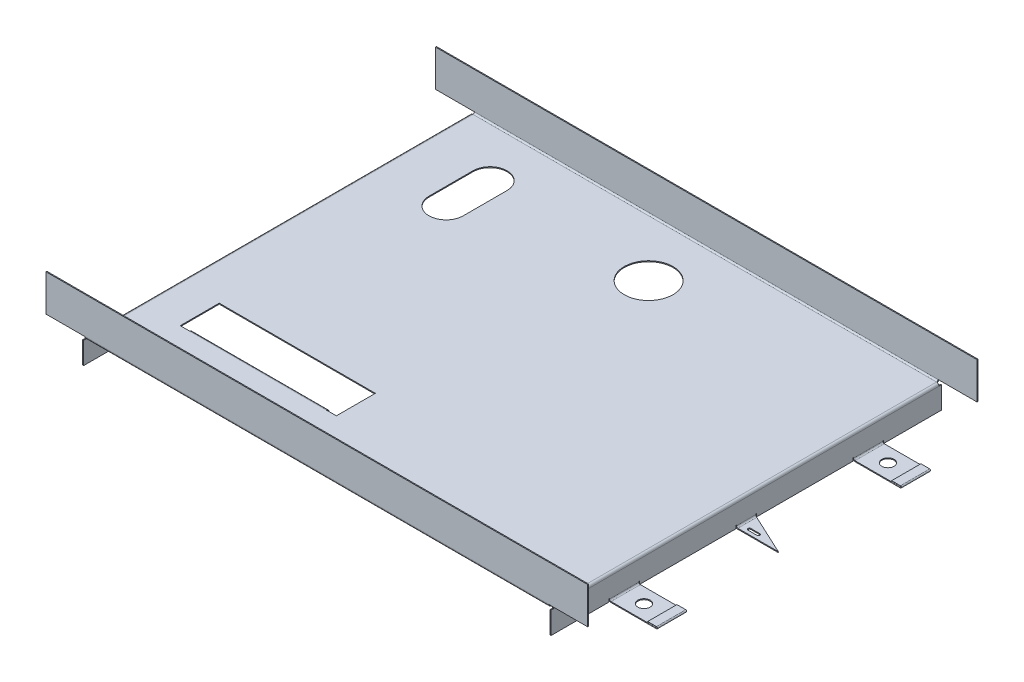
ISO-10303-21;
HEADER;
FILE_DESCRIPTION(('STEP AP214'),'2;1');
FILE_NAME('part.step','',(''),(''),'','','');
FILE_SCHEMA(('AUTOMOTIVE_DESIGN { 1 0 10303 214 1 1 1 1 }'));
ENDSEC;
DATA;
#1=APPLICATION_CONTEXT('core data for automotive mechanical design processes');
#2=APPLICATION_PROTOCOL_DEFINITION('international standard','automotive_design',2000,#1);
#3=PRODUCT_CONTEXT('',#1,'mechanical');
#4=PRODUCT('Part','Part','',(#3));
#5=PRODUCT_RELATED_PRODUCT_CATEGORY('part','',(#4));
#6=PRODUCT_DEFINITION_FORMATION('','',#4);
#7=PRODUCT_DEFINITION_CONTEXT('part definition',#1,'design');
#8=PRODUCT_DEFINITION('design','',#6,#7);
#9=PRODUCT_DEFINITION_SHAPE('','',#8);
#10=(LENGTH_UNIT() NAMED_UNIT(*) SI_UNIT(.MILLI.,.METRE.));
#11=(NAMED_UNIT(*) PLANE_ANGLE_UNIT() SI_UNIT($,.RADIAN.));
#12=(NAMED_UNIT(*) SI_UNIT($,.STERADIAN.) SOLID_ANGLE_UNIT());
#13=UNCERTAINTY_MEASURE_WITH_UNIT(LENGTH_MEASURE(1.E-05),#10,'distance_accuracy_value','');
#14=(GEOMETRIC_REPRESENTATION_CONTEXT(3) GLOBAL_UNCERTAINTY_ASSIGNED_CONTEXT((#13)) GLOBAL_UNIT_ASSIGNED_CONTEXT((#10,
#11,#12)) REPRESENTATION_CONTEXT('',''));
#15=CARTESIAN_POINT('',(0.,0.,0.));
#16=DIRECTION('',(0.,0.,1.));
#17=DIRECTION('',(1.,0.,0.));
#18=AXIS2_PLACEMENT_3D('',#15,#16,#17);
#19=CARTESIAN_POINT('',(303.58588,0.,254.));
#20=DIRECTION('',(1.,0.,0.));
#21=DIRECTION('',(0.,0.,-1.));
#22=AXIS2_PLACEMENT_3D('',#19,#20,#21);
#23=PLANE('',#22);
#24=DIRECTION('',(0.,-1.,0.));
#25=VECTOR('',#24,1.);
#26=CARTESIAN_POINT('',(303.58588,1.43828205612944E-12,-13.3070599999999));
#27=LINE('',#26,#25);
#28=CARTESIAN_POINT('',(303.58588,-28.0238199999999,-13.30706));
#29=VERTEX_POINT('',#28);
#30=CARTESIAN_POINT('',(303.58588,-31.7499999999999,-13.30706));
#31=VERTEX_POINT('',#30);
#32=EDGE_CURVE('E1350',#29,#31,#27,.T.);
#33=ORIENTED_EDGE('',*,*,#32,.F.);
#34=CARTESIAN_POINT('',(303.58588,-28.0238199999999,-13.00353));
#35=DIRECTION('',(1.,0.,0.));
#36=DIRECTION('',(0.,0.,-1.));
#37=AXIS2_PLACEMENT_3D('',#34,#35,#36);
#38=CIRCLE('',#37,0.30353);
#39=CARTESIAN_POINT('',(303.58588,-28.0238199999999,-12.7));
#40=VERTEX_POINT('',#39);
#41=EDGE_CURVE('E1348',#40,#29,#38,.F.);
#42=ORIENTED_EDGE('',*,*,#41,.F.);
#43=DIRECTION('',(0.,1.,0.));
#44=VECTOR('',#43,1.);
#45=CARTESIAN_POINT('',(303.58588,0.,-12.7));
#46=LINE('',#45,#44);
#47=CARTESIAN_POINT('',(303.58588,-28.6308799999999,-12.7));
#48=VERTEX_POINT('',#47);
#49=EDGE_CURVE('E1346',#48,#40,#46,.T.);
#50=ORIENTED_EDGE('',*,*,#49,.F.);
#51=DIRECTION('',(0.,0.,-1.));
#52=VECTOR('',#51,1.);
#53=CARTESIAN_POINT('',(303.58588,-28.6308799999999,-12.7));
#54=LINE('',#53,#52);
#55=CARTESIAN_POINT('',(303.58588,-28.6308799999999,12.7));
#56=VERTEX_POINT('',#55);
#57=EDGE_CURVE('E795',#48,#56,#54,.F.);
#58=ORIENTED_EDGE('',*,*,#57,.T.);
#59=DIRECTION('',(0.,-1.,0.));
#60=VECTOR('',#59,1.);
#61=CARTESIAN_POINT('',(303.58588,0.,12.7));
#62=LINE('',#61,#60);
#63=CARTESIAN_POINT('',(303.58588,-28.0238199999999,12.7));
#64=VERTEX_POINT('',#63);
#65=EDGE_CURVE('E1338',#64,#56,#62,.T.);
#66=ORIENTED_EDGE('',*,*,#65,.F.);
#67=CARTESIAN_POINT('',(303.58588,-28.0238199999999,13.00353));
#68=DIRECTION('',(1.,0.,0.));
#69=DIRECTION('',(0.,0.,-1.));
#70=AXIS2_PLACEMENT_3D('',#67,#68,#69);
#71=CIRCLE('',#70,0.30353);
#72=CARTESIAN_POINT('',(303.58588,-28.0238199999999,13.30706));
#73=VERTEX_POINT('',#72);
#74=EDGE_CURVE('E1333',#73,#64,#71,.F.);
#75=ORIENTED_EDGE('',*,*,#74,.F.);
#76=DIRECTION('',(0.,1.,0.));
#77=VECTOR('',#76,1.);
#78=CARTESIAN_POINT('',(303.58588,1.52609903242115E-12,13.3070600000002));
#79=LINE('',#78,#77);
#80=CARTESIAN_POINT('',(303.58588,-31.7499999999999,13.30706));
#81=VERTEX_POINT('',#80);
#82=EDGE_CURVE('E1331',#81,#73,#79,.T.);
#83=ORIENTED_EDGE('',*,*,#82,.F.);
#84=DIRECTION('',(0.,0.,-1.));
#85=VECTOR('',#84,1.);
#86=CARTESIAN_POINT('',(303.58588,-31.7499999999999,254.));
#87=LINE('',#86,#85);
#88=CARTESIAN_POINT('',(303.58588,-31.7499999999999,139.09294));
#89=VERTEX_POINT('',#88);
#90=EDGE_CURVE('E952',#89,#81,#87,.T.);
#91=ORIENTED_EDGE('',*,*,#90,.F.);
#92=DIRECTION('',(0.,-1.,0.));
#93=VECTOR('',#92,1.);
#94=CARTESIAN_POINT('',(303.58588,0.,139.09294));
#95=LINE('',#94,#93);
#96=CARTESIAN_POINT('',(303.58588,-28.0238199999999,139.09294));
#97=VERTEX_POINT('',#96);
#98=EDGE_CURVE('E1329',#97,#89,#95,.T.);
#99=ORIENTED_EDGE('',*,*,#98,.F.);
#100=CARTESIAN_POINT('',(303.58588,-28.0238199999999,139.39647));
#101=DIRECTION('',(1.,0.,0.));
#102=DIRECTION('',(0.,0.,-1.));
#103=AXIS2_PLACEMENT_3D('',#100,#101,#102);
#104=CIRCLE('',#103,0.303529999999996);
#105=CARTESIAN_POINT('',(303.58588,-28.0238199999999,139.7));
#106=VERTEX_POINT('',#105);
#107=EDGE_CURVE('E1678',#106,#97,#104,.F.);
#108=ORIENTED_EDGE('',*,*,#107,.F.);
#109=DIRECTION('',(0.,1.,0.));
#110=VECTOR('',#109,1.);
#111=CARTESIAN_POINT('',(303.58588,0.,139.7));
#112=LINE('',#111,#110);
#113=CARTESIAN_POINT('',(303.58588,-28.6308799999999,139.7));
#114=VERTEX_POINT('',#113);
#115=EDGE_CURVE('E1676',#114,#106,#112,.T.);
#116=ORIENTED_EDGE('',*,*,#115,.F.);
#117=DIRECTION('',(0.,0.,-1.));
#118=VECTOR('',#117,1.);
#119=CARTESIAN_POINT('',(303.58588,-28.6308799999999,139.7));
#120=LINE('',#119,#118);
#121=CARTESIAN_POINT('',(303.58588,-28.6308799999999,177.8));
#122=VERTEX_POINT('',#121);
#123=EDGE_CURVE('E1617',#114,#122,#120,.F.);
#124=ORIENTED_EDGE('',*,*,#123,.T.);
#125=DIRECTION('',(0.,-1.,0.));
#126=VECTOR('',#125,1.);
#127=CARTESIAN_POINT('',(303.58588,0.,177.8));
#128=LINE('',#127,#126);
#129=CARTESIAN_POINT('',(303.58588,-28.0238199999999,177.8));
#130=VERTEX_POINT('',#129);
#131=EDGE_CURVE('E1674',#130,#122,#128,.T.);
#132=ORIENTED_EDGE('',*,*,#131,.F.);
#133=CARTESIAN_POINT('',(303.58588,-28.0238199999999,178.10353));
#134=DIRECTION('',(1.,0.,0.));
#135=DIRECTION('',(0.,0.,-1.));
#136=AXIS2_PLACEMENT_3D('',#133,#134,#135);
#137=CIRCLE('',#136,0.303529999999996);
#138=CARTESIAN_POINT('',(303.58588,-28.0238199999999,178.40706));
#139=VERTEX_POINT('',#138);
#140=EDGE_CURVE('E1672',#139,#130,#137,.F.);
#141=ORIENTED_EDGE('',*,*,#140,.F.);
#142=DIRECTION('',(0.,1.,0.));
#143=VECTOR('',#142,1.);
#144=CARTESIAN_POINT('',(303.58588,0.,178.40706));
#145=LINE('',#144,#143);
#146=CARTESIAN_POINT('',(303.58588,-31.7499999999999,178.40706));
#147=VERTEX_POINT('',#146);
#148=EDGE_CURVE('E1644',#147,#139,#145,.T.);
#149=ORIENTED_EDGE('',*,*,#148,.F.);
#150=CARTESIAN_POINT('',(303.58588,-31.7499999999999,254.));
#151=VERTEX_POINT('',#150);
#152=EDGE_CURVE('E948',#151,#147,#87,.T.);
#153=ORIENTED_EDGE('',*,*,#152,.F.);
#154=DIRECTION('',(0.,1.,0.));
#155=VECTOR('',#154,1.);
#156=CARTESIAN_POINT('',(303.58588,0.,254.));
#157=LINE('',#156,#155);
#158=CARTESIAN_POINT('',(303.58588,-3.11911999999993,254.));
#159=VERTEX_POINT('',#158);
#160=EDGE_CURVE('E1184',#159,#151,#157,.F.);
#161=ORIENTED_EDGE('',*,*,#160,.F.);
#162=DIRECTION('',(0.,0.,-1.));
#163=VECTOR('',#162,1.);
#164=CARTESIAN_POINT('',(303.58588,-3.11911999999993,254.));
#165=LINE('',#164,#163);
#166=CARTESIAN_POINT('',(303.58588,-3.11911999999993,250.88088));
#167=VERTEX_POINT('',#166);
#168=EDGE_CURVE('E1202',#159,#167,#165,.T.);
#169=ORIENTED_EDGE('',*,*,#168,.T.);
#170=CARTESIAN_POINT('',(303.58588,-3.11911999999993,-250.88088));
#171=VERTEX_POINT('',#170);
#172=EDGE_CURVE('E1201',#167,#171,#165,.T.);
#173=ORIENTED_EDGE('',*,*,#172,.T.);
#174=DIRECTION('',(0.,0.,1.));
#175=VECTOR('',#174,1.);
#176=CARTESIAN_POINT('',(303.58588,-3.11911999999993,-254.));
#177=LINE('',#176,#175);
#178=CARTESIAN_POINT('',(303.58588,-3.11911999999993,-254.));
#179=VERTEX_POINT('',#178);
#180=EDGE_CURVE('E1083',#179,#171,#177,.T.);
#181=ORIENTED_EDGE('',*,*,#180,.F.);
#182=DIRECTION('',(0.,1.,0.));
#183=VECTOR('',#182,1.);
#184=CARTESIAN_POINT('',(303.58588,0.,-254.));
#185=LINE('',#184,#183);
#186=CARTESIAN_POINT('',(303.58588,-31.7499999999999,-254.));
#187=VERTEX_POINT('',#186);
#188=EDGE_CURVE('E1065',#179,#187,#185,.F.);
#189=ORIENTED_EDGE('',*,*,#188,.T.);
#190=CARTESIAN_POINT('',(303.58588,-31.7499999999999,-178.40706));
#191=VERTEX_POINT('',#190);
#192=EDGE_CURVE('E945',#191,#187,#87,.T.);
#193=ORIENTED_EDGE('',*,*,#192,.F.);
#194=DIRECTION('',(0.,-1.,0.));
#195=VECTOR('',#194,1.);
#196=CARTESIAN_POINT('',(303.58588,6.51121775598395E-12,-178.40706));
#197=LINE('',#196,#195);
#198=CARTESIAN_POINT('',(303.58588,-28.0238199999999,-178.40706));
#199=VERTEX_POINT('',#198);
#200=EDGE_CURVE('E1531',#199,#191,#197,.T.);
#201=ORIENTED_EDGE('',*,*,#200,.F.);
#202=CARTESIAN_POINT('',(303.58588,-28.0238199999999,-178.10353));
#203=DIRECTION('',(1.,0.,0.));
#204=DIRECTION('',(0.,0.,-1.));
#205=AXIS2_PLACEMENT_3D('',#202,#203,#204);
#206=CIRCLE('',#205,0.303529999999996);
#207=CARTESIAN_POINT('',(303.58588,-28.0238199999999,-177.8));
#208=VERTEX_POINT('',#207);
#209=EDGE_CURVE('E1529',#208,#199,#206,.F.);
#210=ORIENTED_EDGE('',*,*,#209,.F.);
#211=DIRECTION('',(0.,1.,0.));
#212=VECTOR('',#211,1.);
#213=CARTESIAN_POINT('',(303.58588,0.,-177.8));
#214=LINE('',#213,#212);
#215=CARTESIAN_POINT('',(303.58588,-28.6308799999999,-177.8));
#216=VERTEX_POINT('',#215);
#217=EDGE_CURVE('E1527',#216,#208,#214,.T.);
#218=ORIENTED_EDGE('',*,*,#217,.F.);
#219=DIRECTION('',(0.,0.,-1.));
#220=VECTOR('',#219,1.);
#221=CARTESIAN_POINT('',(303.58588,-28.6308799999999,-177.8));
#222=LINE('',#221,#220);
#223=CARTESIAN_POINT('',(303.58588,-28.6308799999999,-139.7));
#224=VERTEX_POINT('',#223);
#225=EDGE_CURVE('E1466',#216,#224,#222,.F.);
#226=ORIENTED_EDGE('',*,*,#225,.T.);
#227=DIRECTION('',(0.,-1.,0.));
#228=VECTOR('',#227,1.);
#229=CARTESIAN_POINT('',(303.58588,0.,-139.7));
#230=LINE('',#229,#228);
#231=CARTESIAN_POINT('',(303.58588,-28.0238199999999,-139.7));
#232=VERTEX_POINT('',#231);
#233=EDGE_CURVE('E1525',#232,#224,#230,.T.);
#234=ORIENTED_EDGE('',*,*,#233,.F.);
#235=CARTESIAN_POINT('',(303.58588,-28.0238199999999,-139.39647));
#236=DIRECTION('',(1.,0.,0.));
#237=DIRECTION('',(0.,0.,-1.));
#238=AXIS2_PLACEMENT_3D('',#235,#236,#237);
#239=CIRCLE('',#238,0.303529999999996);
#240=CARTESIAN_POINT('',(303.58588,-28.0238199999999,-139.09294));
#241=VERTEX_POINT('',#240);
#242=EDGE_CURVE('E1523',#241,#232,#239,.F.);
#243=ORIENTED_EDGE('',*,*,#242,.F.);
#244=DIRECTION('',(0.,1.,0.));
#245=VECTOR('',#244,1.);
#246=CARTESIAN_POINT('',(303.58588,5.92553159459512E-12,-139.09294));
#247=LINE('',#246,#245);
#248=CARTESIAN_POINT('',(303.58588,-31.7499999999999,-139.09294));
#249=VERTEX_POINT('',#248);
#250=EDGE_CURVE('E1493',#249,#241,#247,.T.);
#251=ORIENTED_EDGE('',*,*,#250,.F.);
#252=EDGE_CURVE('E953',#31,#249,#87,.T.);
#253=ORIENTED_EDGE('',*,*,#252,.F.);
#254=EDGE_LOOP('',(#33,#42,#50,#58,#66,#75,#83,#91,#99,#108,#116,#124,#132,#141,#149,#153,#161,
#169,#173,#181,#189,#193,#201,#210,#218,#226,#234,#243,#251,#253));
#255=FACE_BOUND('',#254,.T.);
#256=ADVANCED_FACE('F155',(#255),#23,.F.);
#257=CARTESIAN_POINT('',(304.8,-31.7499999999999,254.));
#258=DIRECTION('',(0.,-1.,0.));
#259=DIRECTION('',(1.,0.,0.));
#260=AXIS2_PLACEMENT_3D('',#257,#258,#259);
#261=PLANE('',#260);
#262=DIRECTION('',(0.,0.,-1.));
#263=VECTOR('',#262,1.);
#264=CARTESIAN_POINT('',(304.8,-31.7499999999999,254.));
#265=LINE('',#264,#263);
#266=CARTESIAN_POINT('',(304.8,-31.7499999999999,-13.30706));
#267=VERTEX_POINT('',#266);
#268=CARTESIAN_POINT('',(304.8,-31.7499999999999,-139.09294));
#269=VERTEX_POINT('',#268);
#270=EDGE_CURVE('E947',#267,#269,#265,.T.);
#271=ORIENTED_EDGE('',*,*,#270,.F.);
#272=DIRECTION('',(-1.,0.,0.));
#273=VECTOR('',#272,1.);
#274=CARTESIAN_POINT('',(304.8,-31.7499999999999,-13.30706));
#275=LINE('',#274,#273);
#276=EDGE_CURVE('E1341',#267,#31,#275,.T.);
#277=ORIENTED_EDGE('',*,*,#276,.T.);
#278=ORIENTED_EDGE('',*,*,#252,.T.);
#279=DIRECTION('',(-1.,0.,0.));
#280=VECTOR('',#279,1.);
#281=CARTESIAN_POINT('',(304.8,-31.7499999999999,-139.09294));
#282=LINE('',#281,#280);
#283=EDGE_CURVE('E1510',#269,#249,#282,.T.);
#284=ORIENTED_EDGE('',*,*,#283,.F.);
#285=EDGE_LOOP('',(#271,#277,#278,#284));
#286=FACE_BOUND('',#285,.T.);
#287=ADVANCED_FACE('F852',(#286),#261,.T.);
#288=ORIENTED_EDGE('',*,*,#90,.T.);
#289=DIRECTION('',(-1.,0.,0.));
#290=VECTOR('',#289,1.);
#291=CARTESIAN_POINT('',(304.8,-31.7499999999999,13.30706));
#292=LINE('',#291,#290);
#293=CARTESIAN_POINT('',(304.8,-31.7499999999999,13.30706));
#294=VERTEX_POINT('',#293);
#295=EDGE_CURVE('E1323',#294,#81,#292,.T.);
#296=ORIENTED_EDGE('',*,*,#295,.F.);
#297=CARTESIAN_POINT('',(304.8,-31.7499999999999,139.09294));
#298=VERTEX_POINT('',#297);
#299=EDGE_CURVE('E946',#298,#294,#265,.T.);
#300=ORIENTED_EDGE('',*,*,#299,.F.);
#301=DIRECTION('',(-1.,0.,0.));
#302=VECTOR('',#301,1.);
#303=CARTESIAN_POINT('',(304.8,-31.7499999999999,139.09294));
#304=LINE('',#303,#302);
#305=EDGE_CURVE('E1325',#298,#89,#304,.T.);
#306=ORIENTED_EDGE('',*,*,#305,.T.);
#307=EDGE_LOOP('',(#288,#296,#300,#306));
#308=FACE_BOUND('',#307,.T.);
#309=ADVANCED_FACE('F858',(#308),#261,.T.);
#310=CARTESIAN_POINT('',(304.8,0.,254.));
#311=DIRECTION('',(1.,0.,0.));
#312=DIRECTION('',(0.,0.,-1.));
#313=AXIS2_PLACEMENT_3D('',#310,#311,#312);
#314=PLANE('',#313);
#315=CARTESIAN_POINT('',(304.8,-28.0238199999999,-13.00353));
#316=DIRECTION('',(1.,0.,0.));
#317=DIRECTION('',(0.,0.,-1.));
#318=AXIS2_PLACEMENT_3D('',#315,#316,#317);
#319=CIRCLE('',#318,0.30353);
#320=CARTESIAN_POINT('',(304.8,-28.0238199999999,-13.30706));
#321=VERTEX_POINT('',#320);
#322=CARTESIAN_POINT('',(304.8,-28.0238199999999,-12.7));
#323=VERTEX_POINT('',#322);
#324=EDGE_CURVE('E3577',#321,#323,#319,.T.);
#325=ORIENTED_EDGE('',*,*,#324,.F.);
#326=DIRECTION('',(0.,1.,0.));
#327=VECTOR('',#326,1.);
#328=CARTESIAN_POINT('',(304.8,-31.7499999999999,-13.30706));
#329=LINE('',#328,#327);
#330=EDGE_CURVE('E1336',#267,#321,#329,.T.);
#331=ORIENTED_EDGE('',*,*,#330,.F.);
#332=ORIENTED_EDGE('',*,*,#270,.T.);
#333=DIRECTION('',(0.,-1.,0.));
#334=VECTOR('',#333,1.);
#335=CARTESIAN_POINT('',(304.8,-28.0238199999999,-139.09294));
#336=LINE('',#335,#334);
#337=CARTESIAN_POINT('',(304.8,-28.0238199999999,-139.09294));
#338=VERTEX_POINT('',#337);
#339=EDGE_CURVE('E1507',#338,#269,#336,.T.);
#340=ORIENTED_EDGE('',*,*,#339,.F.);
#341=CARTESIAN_POINT('',(304.8,-28.0238199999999,-139.39647));
#342=DIRECTION('',(1.,0.,0.));
#343=DIRECTION('',(0.,0.,-1.));
#344=AXIS2_PLACEMENT_3D('',#341,#342,#343);
#345=CIRCLE('',#344,0.303529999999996);
#346=CARTESIAN_POINT('',(304.8,-28.0238199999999,-139.7));
#347=VERTEX_POINT('',#346);
#348=EDGE_CURVE('E1504',#347,#338,#345,.T.);
#349=ORIENTED_EDGE('',*,*,#348,.F.);
#350=DIRECTION('',(0.,1.,0.));
#351=VECTOR('',#350,1.);
#352=CARTESIAN_POINT('',(304.8,-28.6308799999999,-139.7));
#353=LINE('',#352,#351);
#354=CARTESIAN_POINT('',(304.8,-28.6308799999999,-139.7));
#355=VERTEX_POINT('',#354);
#356=EDGE_CURVE('E1501',#355,#347,#353,.T.);
#357=ORIENTED_EDGE('',*,*,#356,.F.);
#358=DIRECTION('',(0.,0.,-1.));
#359=VECTOR('',#358,1.);
#360=CARTESIAN_POINT('',(304.8,-28.6308799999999,-177.8));
#361=LINE('',#360,#359);
#362=CARTESIAN_POINT('',(304.8,-28.6308799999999,-177.8));
#363=VERTEX_POINT('',#362);
#364=EDGE_CURVE('E1479',#363,#355,#361,.F.);
#365=ORIENTED_EDGE('',*,*,#364,.F.);
#366=DIRECTION('',(0.,-1.,0.));
#367=VECTOR('',#366,1.);
#368=CARTESIAN_POINT('',(304.8,-28.0238199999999,-177.8));
#369=LINE('',#368,#367);
#370=CARTESIAN_POINT('',(304.8,-28.0238199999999,-177.8));
#371=VERTEX_POINT('',#370);
#372=EDGE_CURVE('E1498',#371,#363,#369,.T.);
#373=ORIENTED_EDGE('',*,*,#372,.F.);
#374=CARTESIAN_POINT('',(304.8,-28.0238199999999,-178.10353));
#375=DIRECTION('',(1.,0.,0.));
#376=DIRECTION('',(0.,0.,-1.));
#377=AXIS2_PLACEMENT_3D('',#374,#375,#376);
#378=CIRCLE('',#377,0.303529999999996);
#379=CARTESIAN_POINT('',(304.8,-28.0238199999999,-178.40706));
#380=VERTEX_POINT('',#379);
#381=EDGE_CURVE('E1494',#380,#371,#378,.T.);
#382=ORIENTED_EDGE('',*,*,#381,.F.);
#383=DIRECTION('',(0.,1.,0.));
#384=VECTOR('',#383,1.);
#385=CARTESIAN_POINT('',(304.8,-31.7499999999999,-178.40706));
#386=LINE('',#385,#384);
#387=CARTESIAN_POINT('',(304.8,-31.7499999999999,-178.40706));
#388=VERTEX_POINT('',#387);
#389=EDGE_CURVE('E1490',#388,#380,#386,.T.);
#390=ORIENTED_EDGE('',*,*,#389,.F.);
#391=CARTESIAN_POINT('',(304.8,-31.7499999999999,-254.));
#392=VERTEX_POINT('',#391);
#393=EDGE_CURVE('E941',#388,#392,#265,.T.);
#394=ORIENTED_EDGE('',*,*,#393,.T.);
#395=DIRECTION('',(0.,-1.,0.));
#396=VECTOR('',#395,1.);
#397=CARTESIAN_POINT('',(304.8,0.,-254.));
#398=LINE('',#397,#396);
#399=CARTESIAN_POINT('',(304.8,-3.11911999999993,-254.));
#400=VERTEX_POINT('',#399);
#401=EDGE_CURVE('E1073',#400,#392,#398,.T.);
#402=ORIENTED_EDGE('',*,*,#401,.F.);
#403=DIRECTION('',(0.,0.,1.));
#404=VECTOR('',#403,1.);
#405=CARTESIAN_POINT('',(304.8,-3.11911999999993,-254.));
#406=LINE('',#405,#404);
#407=CARTESIAN_POINT('',(304.8,-3.11911999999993,-250.88088));
#408=VERTEX_POINT('',#407);
#409=EDGE_CURVE('E1091',#400,#408,#406,.T.);
#410=ORIENTED_EDGE('',*,*,#409,.T.);
#411=DIRECTION('',(0.,0.,-1.));
#412=VECTOR('',#411,1.);
#413=CARTESIAN_POINT('',(304.8,-3.11911999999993,254.));
#414=LINE('',#413,#412);
#415=CARTESIAN_POINT('',(304.8,-3.11911999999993,250.88088));
#416=VERTEX_POINT('',#415);
#417=EDGE_CURVE('E937',#416,#408,#414,.T.);
#418=ORIENTED_EDGE('',*,*,#417,.F.);
#419=CARTESIAN_POINT('',(304.8,-3.11911999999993,254.));
#420=VERTEX_POINT('',#419);
#421=EDGE_CURVE('E938',#420,#416,#414,.T.);
#422=ORIENTED_EDGE('',*,*,#421,.F.);
#423=DIRECTION('',(0.,-1.,0.));
#424=VECTOR('',#423,1.);
#425=CARTESIAN_POINT('',(304.8,0.,254.));
#426=LINE('',#425,#424);
#427=CARTESIAN_POINT('',(304.8,-31.7499999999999,254.));
#428=VERTEX_POINT('',#427);
#429=EDGE_CURVE('E1191',#420,#428,#426,.T.);
#430=ORIENTED_EDGE('',*,*,#429,.T.);
#431=CARTESIAN_POINT('',(304.8,-31.7499999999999,178.40706));
#432=VERTEX_POINT('',#431);
#433=EDGE_CURVE('E942',#428,#432,#265,.T.);
#434=ORIENTED_EDGE('',*,*,#433,.T.);
#435=DIRECTION('',(0.,-1.,0.));
#436=VECTOR('',#435,1.);
#437=CARTESIAN_POINT('',(304.8,-28.0238199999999,178.40706));
#438=LINE('',#437,#436);
#439=CARTESIAN_POINT('',(304.8,-28.0238199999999,178.40706));
#440=VERTEX_POINT('',#439);
#441=EDGE_CURVE('E1658',#440,#432,#438,.T.);
#442=ORIENTED_EDGE('',*,*,#441,.F.);
#443=CARTESIAN_POINT('',(304.8,-28.0238199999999,178.10353));
#444=DIRECTION('',(1.,0.,0.));
#445=DIRECTION('',(0.,0.,-1.));
#446=AXIS2_PLACEMENT_3D('',#443,#444,#445);
#447=CIRCLE('',#446,0.303529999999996);
#448=CARTESIAN_POINT('',(304.8,-28.0238199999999,177.8));
#449=VERTEX_POINT('',#448);
#450=EDGE_CURVE('E1655',#449,#440,#447,.T.);
#451=ORIENTED_EDGE('',*,*,#450,.F.);
#452=DIRECTION('',(0.,1.,0.));
#453=VECTOR('',#452,1.);
#454=CARTESIAN_POINT('',(304.8,-28.6308799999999,177.8));
#455=LINE('',#454,#453);
#456=CARTESIAN_POINT('',(304.8,-28.6308799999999,177.8));
#457=VERTEX_POINT('',#456);
#458=EDGE_CURVE('E1652',#457,#449,#455,.T.);
#459=ORIENTED_EDGE('',*,*,#458,.F.);
#460=DIRECTION('',(0.,0.,-1.));
#461=VECTOR('',#460,1.);
#462=CARTESIAN_POINT('',(304.8,-28.6308799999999,139.7));
#463=LINE('',#462,#461);
#464=CARTESIAN_POINT('',(304.8,-28.6308799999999,139.7));
#465=VERTEX_POINT('',#464);
#466=EDGE_CURVE('E1630',#465,#457,#463,.F.);
#467=ORIENTED_EDGE('',*,*,#466,.F.);
#468=DIRECTION('',(0.,-1.,0.));
#469=VECTOR('',#468,1.);
#470=CARTESIAN_POINT('',(304.8,-28.0238199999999,139.7));
#471=LINE('',#470,#469);
#472=CARTESIAN_POINT('',(304.8,-28.0238199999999,139.7));
#473=VERTEX_POINT('',#472);
#474=EDGE_CURVE('E1649',#473,#465,#471,.T.);
#475=ORIENTED_EDGE('',*,*,#474,.F.);
#476=CARTESIAN_POINT('',(304.8,-28.0238199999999,139.39647));
#477=DIRECTION('',(1.,0.,0.));
#478=DIRECTION('',(0.,0.,-1.));
#479=AXIS2_PLACEMENT_3D('',#476,#477,#478);
#480=CIRCLE('',#479,0.303529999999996);
#481=CARTESIAN_POINT('',(304.8,-28.0238199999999,139.09294));
#482=VERTEX_POINT('',#481);
#483=EDGE_CURVE('E1645',#482,#473,#480,.T.);
#484=ORIENTED_EDGE('',*,*,#483,.F.);
#485=DIRECTION('',(0.,1.,0.));
#486=VECTOR('',#485,1.);
#487=CARTESIAN_POINT('',(304.8,-31.7499999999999,139.09294));
#488=LINE('',#487,#486);
#489=EDGE_CURVE('E1641',#298,#482,#488,.T.);
#490=ORIENTED_EDGE('',*,*,#489,.F.);
#491=ORIENTED_EDGE('',*,*,#299,.T.);
#492=DIRECTION('',(0.,-1.,0.));
#493=VECTOR('',#492,1.);
#494=CARTESIAN_POINT('',(304.8,-28.0238199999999,13.30706));
#495=LINE('',#494,#493);
#496=CARTESIAN_POINT('',(304.8,-28.0238199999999,13.30706));
#497=VERTEX_POINT('',#496);
#498=EDGE_CURVE('E3571',#497,#294,#495,.T.);
#499=ORIENTED_EDGE('',*,*,#498,.F.);
#500=CARTESIAN_POINT('',(304.8,-28.0238199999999,13.00353));
#501=DIRECTION('',(1.,0.,0.));
#502=DIRECTION('',(0.,0.,-1.));
#503=AXIS2_PLACEMENT_3D('',#500,#501,#502);
#504=CIRCLE('',#503,0.30353);
#505=CARTESIAN_POINT('',(304.8,-28.0238199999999,12.7));
#506=VERTEX_POINT('',#505);
#507=EDGE_CURVE('E3560',#506,#497,#504,.T.);
#508=ORIENTED_EDGE('',*,*,#507,.F.);
#509=DIRECTION('',(0.,1.,0.));
#510=VECTOR('',#509,1.);
#511=CARTESIAN_POINT('',(304.8,-28.6308799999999,12.7));
#512=LINE('',#511,#510);
#513=CARTESIAN_POINT('',(304.8,-28.6308799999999,12.7));
#514=VERTEX_POINT('',#513);
#515=EDGE_CURVE('E3555',#514,#506,#512,.T.);
#516=ORIENTED_EDGE('',*,*,#515,.F.);
#517=DIRECTION('',(0.,0.,-1.));
#518=VECTOR('',#517,1.);
#519=CARTESIAN_POINT('',(304.8,-28.6308799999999,-12.7));
#520=LINE('',#519,#518);
#521=CARTESIAN_POINT('',(304.8,-28.6308799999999,-12.7));
#522=VERTEX_POINT('',#521);
#523=EDGE_CURVE('E800',#522,#514,#520,.F.);
#524=ORIENTED_EDGE('',*,*,#523,.F.);
#525=DIRECTION('',(0.,-1.,0.));
#526=VECTOR('',#525,1.);
#527=CARTESIAN_POINT('',(304.8,-28.0238199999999,-12.7));
#528=LINE('',#527,#526);
#529=EDGE_CURVE('E3564',#323,#522,#528,.T.);
#530=ORIENTED_EDGE('',*,*,#529,.F.);
#531=EDGE_LOOP('',(#325,#331,#332,#340,#349,#357,#365,#373,#382,#390,#394,#402,#410,#418,#422,
#430,#434,#442,#451,#459,#467,#475,#484,#490,#491,#499,#508,#516,#524,#530));
#532=FACE_BOUND('',#531,.T.);
#533=ADVANCED_FACE('F1307',(#532),#314,.T.);
#534=CARTESIAN_POINT('',(304.8,-31.7499999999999,-177.8));
#535=DIRECTION('',(0.,0.,-1.));
#536=DIRECTION('',(-1.,0.,0.));
#537=AXIS2_PLACEMENT_3D('',#534,#535,#536);
#538=PLANE('',#537);
#539=DIRECTION('',(-1.,0.,0.));
#540=VECTOR('',#539,1.);
#541=CARTESIAN_POINT('',(367.08587999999,-30.5358800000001,-177.8));
#542=LINE('',#541,#540);
#543=CARTESIAN_POINT('',(365.82175999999,-30.5358800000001,-177.8));
#544=VERTEX_POINT('',#543);
#545=CARTESIAN_POINT('',(306.705,-30.5358799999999,-177.8));
#546=VERTEX_POINT('',#545);
#547=EDGE_CURVE('E1454',#544,#546,#542,.T.);
#548=ORIENTED_EDGE('',*,*,#547,.F.);
#549=DIRECTION('',(0.,-1.,0.));
#550=VECTOR('',#549,1.);
#551=CARTESIAN_POINT('',(365.82175999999,-30.5358800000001,-177.8));
#552=LINE('',#551,#550);
#553=CARTESIAN_POINT('',(365.82175999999,-31.7500000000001,-177.8));
#554=VERTEX_POINT('',#553);
#555=EDGE_CURVE('E1398',#544,#554,#552,.T.);
#556=ORIENTED_EDGE('',*,*,#555,.T.);
#557=DIRECTION('',(1.,0.,0.));
#558=VECTOR('',#557,1.);
#559=CARTESIAN_POINT('',(304.8,-31.7499999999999,-177.8));
#560=LINE('',#559,#558);
#561=CARTESIAN_POINT('',(306.705,-31.7499999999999,-177.8));
#562=VERTEX_POINT('',#561);
#563=EDGE_CURVE('E1450',#554,#562,#560,.F.);
#564=ORIENTED_EDGE('',*,*,#563,.T.);
#565=DIRECTION('',(0.,-1.,0.));
#566=VECTOR('',#565,1.);
#567=CARTESIAN_POINT('',(306.705,-30.5358799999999,-177.8));
#568=LINE('',#567,#566);
#569=EDGE_CURVE('E1458',#546,#562,#568,.T.);
#570=ORIENTED_EDGE('',*,*,#569,.F.);
#571=EDGE_LOOP('',(#548,#556,#564,#570));
#572=FACE_BOUND('',#571,.T.);
#573=ADVANCED_FACE('F1831',(#572),#538,.T.);
#574=ORIENTED_EDGE('',*,*,#393,.F.);
#575=DIRECTION('',(-1.,0.,0.));
#576=VECTOR('',#575,1.);
#577=CARTESIAN_POINT('',(304.8,-31.7499999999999,-178.40706));
#578=LINE('',#577,#576);
#579=EDGE_CURVE('E1315',#388,#191,#578,.T.);
#580=ORIENTED_EDGE('',*,*,#579,.T.);
#581=ORIENTED_EDGE('',*,*,#192,.T.);
#582=DIRECTION('',(-1.,0.,0.));
#583=VECTOR('',#582,1.);
#584=CARTESIAN_POINT('',(304.8,-31.7499999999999,-254.));
#585=LINE('',#584,#583);
#586=EDGE_CURVE('E1070',#392,#187,#585,.T.);
#587=ORIENTED_EDGE('',*,*,#586,.F.);
#588=EDGE_LOOP('',(#574,#580,#581,#587));
#589=FACE_BOUND('',#588,.T.);
#590=ADVANCED_FACE('F861',(#589),#261,.T.);
#591=ORIENTED_EDGE('',*,*,#152,.T.);
#592=DIRECTION('',(-1.,0.,0.));
#593=VECTOR('',#592,1.);
#594=CARTESIAN_POINT('',(304.8,-31.7499999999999,178.40706));
#595=LINE('',#594,#593);
#596=EDGE_CURVE('E1660',#432,#147,#595,.T.);
#597=ORIENTED_EDGE('',*,*,#596,.F.);
#598=ORIENTED_EDGE('',*,*,#433,.F.);
#599=DIRECTION('',(-1.,0.,0.));
#600=VECTOR('',#599,1.);
#601=CARTESIAN_POINT('',(304.8,-31.7499999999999,254.));
#602=LINE('',#601,#600);
#603=EDGE_CURVE('E1188',#428,#151,#602,.T.);
#604=ORIENTED_EDGE('',*,*,#603,.T.);
#605=EDGE_LOOP('',(#591,#597,#598,#604));
#606=FACE_BOUND('',#605,.T.);
#607=ADVANCED_FACE('F1838',(#606),#261,.T.);
#608=CARTESIAN_POINT('',(-241.3,-22.225,174.68088));
#609=DIRECTION('',(-1.,0.,0.));
#610=DIRECTION('',(0.,0.,1.));
#611=AXIS2_PLACEMENT_3D('',#608,#609,#610);
#612=PLANE('',#611);
#613=DIRECTION('',(0.,-1.,0.));
#614=VECTOR('',#613,1.);
#615=CARTESIAN_POINT('',(-241.3,-22.225,174.68088));
#616=LINE('',#615,#614);
#617=CARTESIAN_POINT('',(-241.3,-3.11911999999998,174.68088));
#618=VERTEX_POINT('',#617);
#619=CARTESIAN_POINT('',(-241.3,-19.10588,174.68088));
#620=VERTEX_POINT('',#619);
#621=EDGE_CURVE('E1767',#618,#620,#616,.T.);
#622=ORIENTED_EDGE('',*,*,#621,.T.);
#623=DIRECTION('',(0.,0.,1.));
#624=VECTOR('',#623,1.);
#625=CARTESIAN_POINT('',(-241.3,-19.10588,174.68088));
#626=LINE('',#625,#624);
#627=CARTESIAN_POINT('',(-241.3,-19.1058800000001,175.895));
#628=VERTEX_POINT('',#627);
#629=EDGE_CURVE('E1748',#620,#628,#626,.T.);
#630=ORIENTED_EDGE('',*,*,#629,.T.);
#631=DIRECTION('',(0.,1.,0.));
#632=VECTOR('',#631,1.);
#633=CARTESIAN_POINT('',(-241.3,-1.21411999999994,175.895));
#634=LINE('',#633,#632);
#635=CARTESIAN_POINT('',(-241.3,-3.11911999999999,175.895));
#636=VERTEX_POINT('',#635);
#637=EDGE_CURVE('E1772',#636,#628,#634,.F.);
#638=ORIENTED_EDGE('',*,*,#637,.F.);
#639=DIRECTION('',(0.,0.,-1.));
#640=VECTOR('',#639,1.);
#641=CARTESIAN_POINT('',(-241.3,-3.11911999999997,174.68088));
#642=LINE('',#641,#640);
#643=EDGE_CURVE('E1762',#636,#618,#642,.T.);
#644=ORIENTED_EDGE('',*,*,#643,.T.);
#645=EDGE_LOOP('',(#622,#630,#638,#644));
#646=FACE_BOUND('',#645,.T.);
#647=ADVANCED_FACE('F1842',(#646),#612,.T.);
#648=CARTESIAN_POINT('',(-63.5000000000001,-1.21411999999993,174.68088));
#649=DIRECTION('',(0.,0.,-1.));
#650=DIRECTION('',(0.,1.,0.));
#651=AXIS2_PLACEMENT_3D('',#648,#649,#650);
#652=PLANE('',#651);
#653=DIRECTION('',(0.,1.,0.));
#654=VECTOR('',#653,1.);
#655=CARTESIAN_POINT('',(-63.5000000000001,-1.21411999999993,174.68088));
#656=LINE('',#655,#654);
#657=CARTESIAN_POINT('',(-63.5,-19.10588,174.68088));
#658=VERTEX_POINT('',#657);
#659=CARTESIAN_POINT('',(-63.5000000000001,-3.11911999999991,174.68088));
#660=VERTEX_POINT('',#659);
#661=EDGE_CURVE('E1764',#658,#660,#656,.T.);
#662=ORIENTED_EDGE('',*,*,#661,.F.);
#663=DIRECTION('',(-1.,0.,0.));
#664=VECTOR('',#663,1.);
#665=CARTESIAN_POINT('',(-241.3,-19.10588,174.68088));
#666=LINE('',#665,#664);
#667=EDGE_CURVE('E1754',#620,#658,#666,.F.);
#668=ORIENTED_EDGE('',*,*,#667,.F.);
#669=ORIENTED_EDGE('',*,*,#621,.F.);
#670=DIRECTION('',(1.,0.,0.));
#671=VECTOR('',#670,1.);
#672=CARTESIAN_POINT('',(-63.5000000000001,-3.11911999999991,174.68088));
#673=LINE('',#672,#671);
#674=EDGE_CURVE('E1775',#618,#660,#673,.T.);
#675=ORIENTED_EDGE('',*,*,#674,.T.);
#676=EDGE_LOOP('',(#662,#668,#669,#675));
#677=FACE_BOUND('',#676,.T.);
#678=ADVANCED_FACE('F1848',(#677),#652,.T.);
#679=CARTESIAN_POINT('',(-63.5000000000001,-1.21411999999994,175.895));
#680=DIRECTION('',(0.,0.,-1.));
#681=DIRECTION('',(0.,1.,0.));
#682=AXIS2_PLACEMENT_3D('',#679,#680,#681);
#683=PLANE('',#682);
#684=DIRECTION('',(-1.,0.,0.));
#685=VECTOR('',#684,1.);
#686=CARTESIAN_POINT('',(-241.3,-19.1058800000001,175.895));
#687=LINE('',#686,#685);
#688=CARTESIAN_POINT('',(-63.5,-19.10588,175.895));
#689=VERTEX_POINT('',#688);
#690=EDGE_CURVE('E1742',#628,#689,#687,.F.);
#691=ORIENTED_EDGE('',*,*,#690,.T.);
#692=DIRECTION('',(0.,-1.,0.));
#693=VECTOR('',#692,1.);
#694=CARTESIAN_POINT('',(-63.5000000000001,-1.21411999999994,175.895));
#695=LINE('',#694,#693);
#696=CARTESIAN_POINT('',(-63.5000000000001,-3.11911999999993,175.895));
#697=VERTEX_POINT('',#696);
#698=EDGE_CURVE('E1770',#689,#697,#695,.F.);
#699=ORIENTED_EDGE('',*,*,#698,.T.);
#700=DIRECTION('',(-1.,0.,0.));
#701=VECTOR('',#700,1.);
#702=CARTESIAN_POINT('',(-241.3,-3.11911999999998,175.895));
#703=LINE('',#702,#701);
#704=EDGE_CURVE('E1781',#636,#697,#703,.F.);
#705=ORIENTED_EDGE('',*,*,#704,.F.);
#706=ORIENTED_EDGE('',*,*,#637,.T.);
#707=EDGE_LOOP('',(#691,#699,#705,#706));
#708=FACE_BOUND('',#707,.T.);
#709=ADVANCED_FACE('F895',(#708),#683,.F.);
#710=CARTESIAN_POINT('',(-254.,-1.21412000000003,177.8));
#711=DIRECTION('',(0.,0.,1.));
#712=DIRECTION('',(1.,0.,0.));
#713=AXIS2_PLACEMENT_3D('',#710,#711,#712);
#714=PLANE('',#713);
#715=DIRECTION('',(0.,1.,0.));
#716=VECTOR('',#715,1.);
#717=CARTESIAN_POINT('',(-241.3,-1.21412000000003,177.8));
#718=LINE('',#717,#716);
#719=CARTESIAN_POINT('',(-241.3,-1.21412000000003,177.8));
#720=VERTEX_POINT('',#719);
#721=CARTESIAN_POINT('',(-241.3,0.,177.8));
#722=VERTEX_POINT('',#721);
#723=EDGE_CURVE('E1791',#720,#722,#718,.T.);
#724=ORIENTED_EDGE('',*,*,#723,.F.);
#725=DIRECTION('',(1.,0.,0.));
#726=VECTOR('',#725,1.);
#727=CARTESIAN_POINT('',(-254.,-1.21412000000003,177.8));
#728=LINE('',#727,#726);
#729=CARTESIAN_POINT('',(-254.,-1.21412000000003,177.8));
#730=VERTEX_POINT('',#729);
#731=EDGE_CURVE('E3650',#730,#720,#728,.T.);
#732=ORIENTED_EDGE('',*,*,#731,.F.);
#733=DIRECTION('',(0.,1.,0.));
#734=VECTOR('',#733,1.);
#735=CARTESIAN_POINT('',(-254.,-1.21412000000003,177.8));
#736=LINE('',#735,#734);
#737=CARTESIAN_POINT('',(-254.,0.,177.8));
#738=VERTEX_POINT('',#737);
#739=EDGE_CURVE('E992',#730,#738,#736,.T.);
#740=ORIENTED_EDGE('',*,*,#739,.T.);
#741=DIRECTION('',(1.,0.,0.));
#742=VECTOR('',#741,1.);
#743=CARTESIAN_POINT('',(-254.,0.,177.8));
#744=LINE('',#743,#742);
#745=EDGE_CURVE('E965',#738,#722,#744,.T.);
#746=ORIENTED_EDGE('',*,*,#745,.T.);
#747=EDGE_LOOP('',(#724,#732,#740,#746));
#748=FACE_BOUND('',#747,.T.);
#749=ADVANCED_FACE('F887',(#748),#714,.F.);
#750=CARTESIAN_POINT('',(-304.8,-3.11912,250.88088));
#751=DIRECTION('',(0.,1.,0.));
#752=DIRECTION('',(0.,0.,1.));
#753=AXIS2_PLACEMENT_3D('',#750,#751,#752);
#754=PLANE('',#753);
#755=DIRECTION('',(1.,0.,0.));
#756=VECTOR('',#755,1.);
#757=CARTESIAN_POINT('',(-304.8,-3.11912,250.88088));
#758=LINE('',#757,#756);
#759=CARTESIAN_POINT('',(-304.8,-3.11912,250.88088));
#760=VERTEX_POINT('',#759);
#761=CARTESIAN_POINT('',(-303.58588,-3.11912,250.88088));
#762=VERTEX_POINT('',#761);
#763=EDGE_CURVE('E901',#760,#762,#758,.T.);
#764=ORIENTED_EDGE('',*,*,#763,.F.);
#765=DIRECTION('',(0.,0.,-1.));
#766=VECTOR('',#765,1.);
#767=CARTESIAN_POINT('',(-304.8,-3.11912,254.));
#768=LINE('',#767,#766);
#769=CARTESIAN_POINT('',(-304.8,-3.11912,254.));
#770=VERTEX_POINT('',#769);
#771=EDGE_CURVE('E904',#770,#760,#768,.T.);
#772=ORIENTED_EDGE('',*,*,#771,.F.);
#773=DIRECTION('',(-1.,0.,0.));
#774=VECTOR('',#773,1.);
#775=CARTESIAN_POINT('',(-303.58588,-3.11912,254.));
#776=LINE('',#775,#774);
#777=CARTESIAN_POINT('',(-303.58588,-3.11912,254.));
#778=VERTEX_POINT('',#777);
#779=EDGE_CURVE('E955',#778,#770,#776,.T.);
#780=ORIENTED_EDGE('',*,*,#779,.F.);
#781=DIRECTION('',(0.,0.,-1.));
#782=VECTOR('',#781,1.);
#783=CARTESIAN_POINT('',(-303.58588,-3.11912,254.));
#784=LINE('',#783,#782);
#785=EDGE_CURVE('E907',#778,#762,#784,.T.);
#786=ORIENTED_EDGE('',*,*,#785,.T.);
#787=EDGE_LOOP('',(#764,#772,#780,#786));
#788=FACE_BOUND('',#787,.T.);
#789=ADVANCED_FACE('F885',(#788),#754,.T.);
#790=CARTESIAN_POINT('',(-301.68088,-3.11912,254.));
#791=DIRECTION('',(0.,0.,-1.));
#792=DIRECTION('',(-1.,0.,0.));
#793=AXIS2_PLACEMENT_3D('',#790,#791,#792);
#794=CYLINDRICAL_SURFACE('',#793,3.11912);
#795=CARTESIAN_POINT('',(-304.8,-3.11912,-250.88088));
#796=VERTEX_POINT('',#795);
#797=EDGE_CURVE('E920',#760,#796,#768,.T.);
#798=ORIENTED_EDGE('',*,*,#797,.F.);
#799=CARTESIAN_POINT('',(-301.68088,-3.11912,250.88088));
#800=DIRECTION('',(0.,0.,1.));
#801=DIRECTION('',(0.,-1.,0.));
#802=AXIS2_PLACEMENT_3D('',#799,#800,#801);
#803=CIRCLE('',#802,3.11912);
#804=CARTESIAN_POINT('',(-301.68088,0.,250.88088));
#805=VERTEX_POINT('',#804);
#806=EDGE_CURVE('E912',#760,#805,#803,.F.);
#807=ORIENTED_EDGE('',*,*,#806,.T.);
#808=DIRECTION('',(0.,0.,-1.));
#809=VECTOR('',#808,1.);
#810=CARTESIAN_POINT('',(-301.68088,0.,254.));
#811=LINE('',#810,#809);
#812=CARTESIAN_POINT('',(-301.68088,0.,-250.88088));
#813=VERTEX_POINT('',#812);
#814=EDGE_CURVE('E930',#805,#813,#811,.T.);
#815=ORIENTED_EDGE('',*,*,#814,.T.);
#816=CARTESIAN_POINT('',(-301.68088,-3.11912,-250.88088));
#817=DIRECTION('',(0.,0.,1.));
#818=DIRECTION('',(0.,-1.,0.));
#819=AXIS2_PLACEMENT_3D('',#816,#817,#818);
#820=CIRCLE('',#819,3.11912);
#821=EDGE_CURVE('E922',#796,#813,#820,.F.);
#822=ORIENTED_EDGE('',*,*,#821,.F.);
#823=EDGE_LOOP('',(#798,#807,#815,#822));
#824=FACE_BOUND('',#823,.T.);
#825=ADVANCED_FACE('F880',(#824),#794,.T.);
#826=CARTESIAN_POINT('',(303.58588,-3.11911999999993,250.88088));
#827=DIRECTION('',(0.,1.,0.));
#828=DIRECTION('',(0.,0.,1.));
#829=AXIS2_PLACEMENT_3D('',#826,#827,#828);
#830=PLANE('',#829);
#831=DIRECTION('',(1.,0.,0.));
#832=VECTOR('',#831,1.);
#833=CARTESIAN_POINT('',(303.58588,-3.11911999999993,250.88088));
#834=LINE('',#833,#832);
#835=EDGE_CURVE('E917',#167,#416,#834,.T.);
#836=ORIENTED_EDGE('',*,*,#835,.F.);
#837=ORIENTED_EDGE('',*,*,#168,.F.);
#838=DIRECTION('',(-1.,0.,0.));
#839=VECTOR('',#838,1.);
#840=CARTESIAN_POINT('',(304.8,-3.11911999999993,254.));
#841=LINE('',#840,#839);
#842=EDGE_CURVE('E951',#420,#159,#841,.T.);
#843=ORIENTED_EDGE('',*,*,#842,.F.);
#844=ORIENTED_EDGE('',*,*,#421,.T.);
#845=EDGE_LOOP('',(#836,#837,#843,#844));
#846=FACE_BOUND('',#845,.T.);
#847=ADVANCED_FACE('F877',(#846),#830,.T.);
#848=CARTESIAN_POINT('',(301.68088,-3.11911999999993,254.));
#849=DIRECTION('',(0.,0.,-1.));
#850=DIRECTION('',(-1.,0.,0.));
#851=AXIS2_PLACEMENT_3D('',#848,#849,#850);
#852=CYLINDRICAL_SURFACE('',#851,3.11912);
#853=DIRECTION('',(0.,0.,-1.));
#854=VECTOR('',#853,1.);
#855=CARTESIAN_POINT('',(301.680879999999,0.,254.));
#856=LINE('',#855,#854);
#857=CARTESIAN_POINT('',(301.680879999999,1.24466409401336E-13,250.88088));
#858=VERTEX_POINT('',#857);
#859=CARTESIAN_POINT('',(301.680879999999,1.24466409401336E-13,-250.88088));
#860=VERTEX_POINT('',#859);
#861=EDGE_CURVE('E931',#858,#860,#856,.T.);
#862=ORIENTED_EDGE('',*,*,#861,.F.);
#863=CARTESIAN_POINT('',(301.68088,-3.11911999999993,250.88088));
#864=DIRECTION('',(0.,0.,1.));
#865=DIRECTION('',(0.,-1.,0.));
#866=AXIS2_PLACEMENT_3D('',#863,#864,#865);
#867=CIRCLE('',#866,3.11912);
#868=EDGE_CURVE('E960',#858,#416,#867,.F.);
#869=ORIENTED_EDGE('',*,*,#868,.T.);
#870=ORIENTED_EDGE('',*,*,#417,.T.);
#871=CARTESIAN_POINT('',(301.68088,-3.11911999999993,-250.88088));
#872=DIRECTION('',(0.,0.,1.));
#873=DIRECTION('',(0.,-1.,0.));
#874=AXIS2_PLACEMENT_3D('',#871,#872,#873);
#875=CIRCLE('',#874,3.11912);
#876=EDGE_CURVE('E1103',#860,#408,#875,.F.);
#877=ORIENTED_EDGE('',*,*,#876,.F.);
#878=EDGE_LOOP('',(#862,#869,#870,#877));
#879=FACE_BOUND('',#878,.T.);
#880=ADVANCED_FACE('F875',(#879),#852,.T.);
#881=CARTESIAN_POINT('',(301.68088,-3.11911999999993,250.88088));
#882=DIRECTION('',(0.,0.,1.));
#883=DIRECTION('',(0.,-1.,0.));
#884=AXIS2_PLACEMENT_3D('',#881,#882,#883);
#885=PLANE('',#884);
#886=CARTESIAN_POINT('',(301.68088,-3.11911999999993,250.88088));
#887=DIRECTION('',(0.,0.,1.));
#888=DIRECTION('',(0.,-1.,0.));
#889=AXIS2_PLACEMENT_3D('',#886,#887,#888);
#890=CIRCLE('',#889,1.905);
#891=CARTESIAN_POINT('',(301.680879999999,-1.21411999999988,250.88088));
#892=VERTEX_POINT('',#891);
#893=EDGE_CURVE('E957',#892,#167,#890,.F.);
#894=ORIENTED_EDGE('',*,*,#893,.T.);
#895=ORIENTED_EDGE('',*,*,#835,.T.);
#896=ORIENTED_EDGE('',*,*,#868,.F.);
#897=DIRECTION('',(0.,-1.,0.));
#898=VECTOR('',#897,1.);
#899=CARTESIAN_POINT('',(301.680879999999,1.24466409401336E-13,250.88088));
#900=LINE('',#899,#898);
#901=EDGE_CURVE('E1172',#858,#892,#900,.T.);
#902=ORIENTED_EDGE('',*,*,#901,.T.);
#903=EDGE_LOOP('',(#894,#895,#896,#902));
#904=FACE_BOUND('',#903,.T.);
#905=ADVANCED_FACE('F871',(#904),#885,.T.);
#906=CARTESIAN_POINT('',(-304.8,0.,254.));
#907=DIRECTION('',(0.,1.,0.));
#908=DIRECTION('',(-1.,0.,0.));
#909=AXIS2_PLACEMENT_3D('',#906,#907,#908);
#910=PLANE('',#909);
#911=CARTESIAN_POINT('',(-215.9,0.,-130.175));
#912=DIRECTION('',(0.,1.,0.));
#913=DIRECTION('',(-1.,0.,0.));
#914=AXIS2_PLACEMENT_3D('',#911,#912,#913);
#915=CIRCLE('',#914,22.225);
#916=CARTESIAN_POINT('',(-238.125,0.,-130.175));
#917=VERTEX_POINT('',#916);
#918=CARTESIAN_POINT('',(-193.675,0.,-130.175));
#919=VERTEX_POINT('',#918);
#920=EDGE_CURVE('E1352',#917,#919,#915,.T.);
#921=ORIENTED_EDGE('',*,*,#920,.F.);
#922=DIRECTION('',(0.,0.,1.));
#923=VECTOR('',#922,1.);
#924=CARTESIAN_POINT('',(-238.125,0.,-130.175));
#925=LINE('',#924,#923);
#926=CARTESIAN_POINT('',(-238.125,0.,-187.325));
#927=VERTEX_POINT('',#926);
#928=EDGE_CURVE('E1357',#927,#917,#925,.T.);
#929=ORIENTED_EDGE('',*,*,#928,.F.);
#930=CARTESIAN_POINT('',(-215.9,0.,-187.325));
#931=DIRECTION('',(0.,1.,0.));
#932=DIRECTION('',(-1.,0.,0.));
#933=AXIS2_PLACEMENT_3D('',#930,#931,#932);
#934=CIRCLE('',#933,22.225);
#935=CARTESIAN_POINT('',(-193.675,0.,-187.325));
#936=VERTEX_POINT('',#935);
#937=EDGE_CURVE('E1371',#936,#927,#934,.T.);
#938=ORIENTED_EDGE('',*,*,#937,.F.);
#939=DIRECTION('',(0.,0.,-1.));
#940=VECTOR('',#939,1.);
#941=CARTESIAN_POINT('',(-193.675,0.,-130.175));
#942=LINE('',#941,#940);
#943=EDGE_CURVE('E1368',#919,#936,#942,.T.);
#944=ORIENTED_EDGE('',*,*,#943,.F.);
#945=EDGE_LOOP('',(#921,#929,#938,#944));
#946=FACE_BOUND('',#945,.T.);
#947=CARTESIAN_POINT('',(0.,0.,-177.8));
#948=DIRECTION('',(0.,1.,0.));
#949=DIRECTION('',(0.,0.,1.));
#950=AXIS2_PLACEMENT_3D('',#947,#948,#949);
#951=CIRCLE('',#950,31.75);
#952=CARTESIAN_POINT('',(0.,0.,-146.05));
#953=VERTEX_POINT('',#952);
#954=EDGE_CURVE('E1693',#953,#953,#951,.T.);
#955=ORIENTED_EDGE('',*,*,#954,.F.);
#956=EDGE_LOOP('',(#955));
#957=FACE_BOUND('',#956,.T.);
#958=CARTESIAN_POINT('',(-38.0999999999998,0.,209.55));
#959=DIRECTION('',(0.,1.,0.));
#960=DIRECTION('',(0.,0.,1.));
#961=AXIS2_PLACEMENT_3D('',#958,#959,#960);
#962=CIRCLE('',#961,4.76249999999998);
#963=CARTESIAN_POINT('',(-38.0999999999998,0.,214.3125));
#964=VERTEX_POINT('',#963);
#965=EDGE_CURVE('E1702',#964,#964,#962,.T.);
#966=ORIENTED_EDGE('',*,*,#965,.F.);
#967=EDGE_LOOP('',(#966));
#968=FACE_BOUND('',#967,.T.);
#969=CARTESIAN_POINT('',(-241.3,0.,209.55));
#970=DIRECTION('',(0.,1.,0.));
#971=DIRECTION('',(0.,0.,1.));
#972=AXIS2_PLACEMENT_3D('',#969,#970,#971);
#973=CIRCLE('',#972,4.76249999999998);
#974=CARTESIAN_POINT('',(-241.3,0.,214.3125));
#975=VERTEX_POINT('',#974);
#976=EDGE_CURVE('E1705',#975,#975,#973,.T.);
#977=ORIENTED_EDGE('',*,*,#976,.F.);
#978=EDGE_LOOP('',(#977));
#979=FACE_BOUND('',#978,.T.);
#980=DIRECTION('',(0.,0.,1.));
#981=VECTOR('',#980,1.);
#982=CARTESIAN_POINT('',(-254.,0.,127.));
#983=LINE('',#982,#981);
#984=CARTESIAN_POINT('',(-254.,0.,127.));
#985=VERTEX_POINT('',#984);
#986=EDGE_CURVE('E975',#985,#738,#983,.T.);
#987=ORIENTED_EDGE('',*,*,#986,.F.);
#988=DIRECTION('',(-1.,0.,0.));
#989=VECTOR('',#988,1.);
#990=CARTESIAN_POINT('',(-254.,0.,127.));
#991=LINE('',#990,#989);
#992=CARTESIAN_POINT('',(-50.8,0.,127.));
#993=VERTEX_POINT('',#992);
#994=EDGE_CURVE('E980',#993,#985,#991,.T.);
#995=ORIENTED_EDGE('',*,*,#994,.F.);
#996=DIRECTION('',(0.,0.,-1.));
#997=VECTOR('',#996,1.);
#998=CARTESIAN_POINT('',(-50.8,0.,127.));
#999=LINE('',#998,#997);
#1000=CARTESIAN_POINT('',(-50.8,0.,177.8));
#1001=VERTEX_POINT('',#1000);
#1002=EDGE_CURVE('E969',#1001,#993,#999,.T.);
#1003=ORIENTED_EDGE('',*,*,#1002,.F.);
#1004=CARTESIAN_POINT('',(-63.5000000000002,0.,177.8));
#1005=VERTEX_POINT('',#1004);
#1006=EDGE_CURVE('E970',#1005,#1001,#744,.T.);
#1007=ORIENTED_EDGE('',*,*,#1006,.F.);
#1008=DIRECTION('',(1.,0.,0.));
#1009=VECTOR('',#1008,1.);
#1010=CARTESIAN_POINT('',(-63.5000000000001,0.,177.8));
#1011=LINE('',#1010,#1009);
#1012=EDGE_CURVE('E1807',#1005,#722,#1011,.F.);
#1013=ORIENTED_EDGE('',*,*,#1012,.T.);
#1014=ORIENTED_EDGE('',*,*,#745,.F.);
#1015=EDGE_LOOP('',(#987,#995,#1003,#1007,#1013,#1014));
#1016=FACE_BOUND('',#1015,.T.);
#1017=ORIENTED_EDGE('',*,*,#814,.F.);
#1018=DIRECTION('',(1.,0.,0.));
#1019=VECTOR('',#1018,1.);
#1020=CARTESIAN_POINT('',(301.680879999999,1.24466409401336E-13,250.88088));
#1021=LINE('',#1020,#1019);
#1022=EDGE_CURVE('E1178',#858,#805,#1021,.F.);
#1023=ORIENTED_EDGE('',*,*,#1022,.F.);
#1024=ORIENTED_EDGE('',*,*,#861,.T.);
#1025=DIRECTION('',(1.,0.,0.));
#1026=VECTOR('',#1025,1.);
#1027=CARTESIAN_POINT('',(301.680879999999,1.24466409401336E-13,-250.88088));
#1028=LINE('',#1027,#1026);
#1029=EDGE_CURVE('E1057',#860,#813,#1028,.F.);
#1030=ORIENTED_EDGE('',*,*,#1029,.T.);
#1031=EDGE_LOOP('',(#1017,#1023,#1024,#1030));
#1032=FACE_BOUND('',#1031,.T.);
#1033=CARTESIAN_POINT('',(165.1,0.,209.55));
#1034=DIRECTION('',(0.,1.,0.));
#1035=DIRECTION('',(0.,0.,1.));
#1036=AXIS2_PLACEMENT_3D('',#1033,#1034,#1035);
#1037=CIRCLE('',#1036,4.76249999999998);
#1038=CARTESIAN_POINT('',(165.1,0.,214.3125));
#1039=VERTEX_POINT('',#1038);
#1040=EDGE_CURVE('E13',#1039,#1039,#1037,.T.);
#1041=ORIENTED_EDGE('',*,*,#1040,.F.);
#1042=EDGE_LOOP('',(#1041));
#1043=FACE_BOUND('',#1042,.T.);
#1044=ADVANCED_FACE('F874',(#946,#957,#968,#979,#1016,#1032,#1043),#910,.T.);
#1045=CARTESIAN_POINT('',(-304.8,-1.21412,254.));
#1046=DIRECTION('',(0.,1.,0.));
#1047=DIRECTION('',(-1.,0.,0.));
#1048=AXIS2_PLACEMENT_3D('',#1045,#1046,#1047);
#1049=PLANE('',#1048);
#1050=DIRECTION('',(0.,0.,1.));
#1051=VECTOR('',#1050,1.);
#1052=CARTESIAN_POINT('',(-238.125,-1.21412000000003,-130.175));
#1053=LINE('',#1052,#1051);
#1054=CARTESIAN_POINT('',(-238.125,-1.21412000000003,-187.325));
#1055=VERTEX_POINT('',#1054);
#1056=CARTESIAN_POINT('',(-238.125,-1.21412000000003,-130.175));
#1057=VERTEX_POINT('',#1056);
#1058=EDGE_CURVE('E1363',#1055,#1057,#1053,.T.);
#1059=ORIENTED_EDGE('',*,*,#1058,.T.);
#1060=CARTESIAN_POINT('',(-215.9,-1.21412000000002,-130.175));
#1061=DIRECTION('',(0.,1.,0.));
#1062=DIRECTION('',(-1.,0.,0.));
#1063=AXIS2_PLACEMENT_3D('',#1060,#1061,#1062);
#1064=CIRCLE('',#1063,22.225);
#1065=CARTESIAN_POINT('',(-193.675,-1.21412000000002,-130.175));
#1066=VERTEX_POINT('',#1065);
#1067=EDGE_CURVE('E1353',#1057,#1066,#1064,.T.);
#1068=ORIENTED_EDGE('',*,*,#1067,.T.);
#1069=DIRECTION('',(0.,0.,-1.));
#1070=VECTOR('',#1069,1.);
#1071=CARTESIAN_POINT('',(-193.675,-1.21412000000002,-130.175));
#1072=LINE('',#1071,#1070);
#1073=CARTESIAN_POINT('',(-193.675,-1.21411999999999,-187.325));
#1074=VERTEX_POINT('',#1073);
#1075=EDGE_CURVE('E1356',#1066,#1074,#1072,.T.);
#1076=ORIENTED_EDGE('',*,*,#1075,.T.);
#1077=CARTESIAN_POINT('',(-215.9,-1.21412000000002,-187.325));
#1078=DIRECTION('',(0.,1.,0.));
#1079=DIRECTION('',(-1.,0.,0.));
#1080=AXIS2_PLACEMENT_3D('',#1077,#1078,#1079);
#1081=CIRCLE('',#1080,22.225);
#1082=EDGE_CURVE('E1360',#1074,#1055,#1081,.T.);
#1083=ORIENTED_EDGE('',*,*,#1082,.T.);
#1084=EDGE_LOOP('',(#1059,#1068,#1076,#1083));
#1085=FACE_BOUND('',#1084,.T.);
#1086=CARTESIAN_POINT('',(0.,-1.21411999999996,-177.8));
#1087=DIRECTION('',(0.,1.,0.));
#1088=DIRECTION('',(-1.,0.,0.));
#1089=AXIS2_PLACEMENT_3D('',#1086,#1087,#1088);
#1090=CIRCLE('',#1089,31.75);
#1091=CARTESIAN_POINT('',(-31.75,-1.21411999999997,-177.8));
#1092=VERTEX_POINT('',#1091);
#1093=EDGE_CURVE('E1696',#1092,#1092,#1090,.T.);
#1094=ORIENTED_EDGE('',*,*,#1093,.T.);
#1095=EDGE_LOOP('',(#1094));
#1096=FACE_BOUND('',#1095,.T.);
#1097=CARTESIAN_POINT('',(-38.0999999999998,-1.21411999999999,209.55));
#1098=DIRECTION('',(0.,1.,0.));
#1099=DIRECTION('',(-1.,0.,0.));
#1100=AXIS2_PLACEMENT_3D('',#1097,#1098,#1099);
#1101=CIRCLE('',#1100,4.76249999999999);
#1102=CARTESIAN_POINT('',(-42.8624999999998,-1.21411999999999,209.55));
#1103=VERTEX_POINT('',#1102);
#1104=EDGE_CURVE('E1699',#1103,#1103,#1101,.T.);
#1105=ORIENTED_EDGE('',*,*,#1104,.T.);
#1106=EDGE_LOOP('',(#1105));
#1107=FACE_BOUND('',#1106,.T.);
#1108=CARTESIAN_POINT('',(-241.3,-1.21411999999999,209.55));
#1109=DIRECTION('',(0.,1.,0.));
#1110=DIRECTION('',(-1.,0.,0.));
#1111=AXIS2_PLACEMENT_3D('',#1108,#1109,#1110);
#1112=CIRCLE('',#1111,4.76249999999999);
#1113=CARTESIAN_POINT('',(-246.0625,-1.21411999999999,209.55));
#1114=VERTEX_POINT('',#1113);
#1115=EDGE_CURVE('E1708',#1114,#1114,#1112,.T.);
#1116=ORIENTED_EDGE('',*,*,#1115,.T.);
#1117=EDGE_LOOP('',(#1116));
#1118=FACE_BOUND('',#1117,.T.);
#1119=DIRECTION('',(-1.,0.,0.));
#1120=VECTOR('',#1119,1.);
#1121=CARTESIAN_POINT('',(-254.,-1.21412000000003,127.));
#1122=LINE('',#1121,#1120);
#1123=CARTESIAN_POINT('',(-50.8,-1.21412000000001,127.));
#1124=VERTEX_POINT('',#1123);
#1125=CARTESIAN_POINT('',(-254.,-1.21412000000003,127.));
#1126=VERTEX_POINT('',#1125);
#1127=EDGE_CURVE('E995',#1124,#1126,#1122,.T.);
#1128=ORIENTED_EDGE('',*,*,#1127,.T.);
#1129=DIRECTION('',(0.,0.,1.));
#1130=VECTOR('',#1129,1.);
#1131=CARTESIAN_POINT('',(-254.,-1.21412000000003,127.));
#1132=LINE('',#1131,#1130);
#1133=EDGE_CURVE('E983',#1126,#730,#1132,.T.);
#1134=ORIENTED_EDGE('',*,*,#1133,.T.);
#1135=ORIENTED_EDGE('',*,*,#731,.T.);
#1136=DIRECTION('',(1.,0.,0.));
#1137=VECTOR('',#1136,1.);
#1138=CARTESIAN_POINT('',(-63.5000000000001,-1.21411999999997,177.8));
#1139=LINE('',#1138,#1137);
#1140=CARTESIAN_POINT('',(-63.5000000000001,-1.21411999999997,177.8));
#1141=VERTEX_POINT('',#1140);
#1142=EDGE_CURVE('E1801',#1141,#720,#1139,.F.);
#1143=ORIENTED_EDGE('',*,*,#1142,.F.);
#1144=CARTESIAN_POINT('',(-50.8,-1.21411999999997,177.8));
#1145=VERTEX_POINT('',#1144);
#1146=EDGE_CURVE('E3656',#1141,#1145,#728,.T.);
#1147=ORIENTED_EDGE('',*,*,#1146,.T.);
#1148=DIRECTION('',(0.,0.,-1.));
#1149=VECTOR('',#1148,1.);
#1150=CARTESIAN_POINT('',(-50.8,-1.21412000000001,127.));
#1151=LINE('',#1150,#1149);
#1152=EDGE_CURVE('E3649',#1145,#1124,#1151,.T.);
#1153=ORIENTED_EDGE('',*,*,#1152,.T.);
#1154=EDGE_LOOP('',(#1128,#1134,#1135,#1143,#1147,#1153));
#1155=FACE_BOUND('',#1154,.T.);
#1156=DIRECTION('',(1.,0.,0.));
#1157=VECTOR('',#1156,1.);
#1158=CARTESIAN_POINT('',(301.680879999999,-1.21411999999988,250.88088));
#1159=LINE('',#1158,#1157);
#1160=CARTESIAN_POINT('',(-301.68088,-1.21412,250.88088));
#1161=VERTEX_POINT('',#1160);
#1162=EDGE_CURVE('E1165',#892,#1161,#1159,.F.);
#1163=ORIENTED_EDGE('',*,*,#1162,.T.);
#1164=DIRECTION('',(0.,0.,-1.));
#1165=VECTOR('',#1164,1.);
#1166=CARTESIAN_POINT('',(-301.68088,-1.21412,254.));
#1167=LINE('',#1166,#1165);
#1168=CARTESIAN_POINT('',(-301.68088,-1.21412,-250.88088));
#1169=VERTEX_POINT('',#1168);
#1170=EDGE_CURVE('E1207',#1161,#1169,#1167,.T.);
#1171=ORIENTED_EDGE('',*,*,#1170,.T.);
#1172=DIRECTION('',(1.,0.,0.));
#1173=VECTOR('',#1172,1.);
#1174=CARTESIAN_POINT('',(301.680879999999,-1.21411999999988,-250.88088));
#1175=LINE('',#1174,#1173);
#1176=CARTESIAN_POINT('',(301.680879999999,-1.21411999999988,-250.88088));
#1177=VERTEX_POINT('',#1176);
#1178=EDGE_CURVE('E1044',#1177,#1169,#1175,.F.);
#1179=ORIENTED_EDGE('',*,*,#1178,.F.);
#1180=DIRECTION('',(0.,0.,-1.));
#1181=VECTOR('',#1180,1.);
#1182=CARTESIAN_POINT('',(301.68088,-1.21411999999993,254.));
#1183=LINE('',#1182,#1181);
#1184=EDGE_CURVE('E1205',#892,#1177,#1183,.T.);
#1185=ORIENTED_EDGE('',*,*,#1184,.F.);
#1186=EDGE_LOOP('',(#1163,#1171,#1179,#1185));
#1187=FACE_BOUND('',#1186,.T.);
#1188=CARTESIAN_POINT('',(165.1,-1.21412,209.55));
#1189=DIRECTION('',(0.,1.,0.));
#1190=DIRECTION('',(-1.,0.,0.));
#1191=AXIS2_PLACEMENT_3D('',#1188,#1189,#1190);
#1192=CIRCLE('',#1191,4.76249999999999);
#1193=CARTESIAN_POINT('',(160.3375,-1.21412,209.55));
#1194=VERTEX_POINT('',#1193);
#1195=EDGE_CURVE('E163',#1194,#1194,#1192,.T.);
#1196=ORIENTED_EDGE('',*,*,#1195,.T.);
#1197=EDGE_LOOP('',(#1196));
#1198=FACE_BOUND('',#1197,.T.);
#1199=ADVANCED_FACE('F869',(#1085,#1096,#1107,#1118,#1155,#1187,#1198),#1049,.F.);
#1200=CARTESIAN_POINT('',(301.68088,-1.21411999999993,254.));
#1201=DIRECTION('',(0.,0.,1.));
#1202=DIRECTION('',(1.,0.,0.));
#1203=AXIS2_PLACEMENT_3D('',#1200,#1201,#1202);
#1204=PLANE('',#1203);
#1205=ORIENTED_EDGE('',*,*,#429,.F.);
#1206=ORIENTED_EDGE('',*,*,#842,.T.);
#1207=ORIENTED_EDGE('',*,*,#160,.T.);
#1208=ORIENTED_EDGE('',*,*,#603,.F.);
#1209=EDGE_LOOP('',(#1205,#1206,#1207,#1208));
#1210=FACE_BOUND('',#1209,.T.);
#1211=ADVANCED_FACE('F865',(#1210),#1204,.T.);
#1212=CARTESIAN_POINT('',(-301.68088,-3.11912,250.88088));
#1213=DIRECTION('',(0.,0.,1.));
#1214=DIRECTION('',(0.,-1.,0.));
#1215=AXIS2_PLACEMENT_3D('',#1212,#1213,#1214);
#1216=PLANE('',#1215);
#1217=ORIENTED_EDGE('',*,*,#806,.F.);
#1218=ORIENTED_EDGE('',*,*,#763,.T.);
#1219=CARTESIAN_POINT('',(-301.68088,-3.11912,250.88088));
#1220=DIRECTION('',(0.,0.,1.));
#1221=DIRECTION('',(0.,-1.,0.));
#1222=AXIS2_PLACEMENT_3D('',#1219,#1220,#1221);
#1223=CIRCLE('',#1222,1.905);
#1224=EDGE_CURVE('E909',#762,#1161,#1223,.F.);
#1225=ORIENTED_EDGE('',*,*,#1224,.T.);
#1226=DIRECTION('',(-1.16558847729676E-13,-1.,0.));
#1227=VECTOR('',#1226,1.);
#1228=CARTESIAN_POINT('',(-301.68088,0.,250.88088));
#1229=LINE('',#1228,#1227);
#1230=EDGE_CURVE('E915',#805,#1161,#1229,.T.);
#1231=ORIENTED_EDGE('',*,*,#1230,.F.);
#1232=EDGE_LOOP('',(#1217,#1218,#1225,#1231));
#1233=FACE_BOUND('',#1232,.T.);
#1234=ADVANCED_FACE('F868',(#1233),#1216,.T.);
#1235=CARTESIAN_POINT('',(-304.8,0.,254.));
#1236=DIRECTION('',(-1.,0.,0.));
#1237=DIRECTION('',(0.,0.,1.));
#1238=AXIS2_PLACEMENT_3D('',#1235,#1236,#1237);
#1239=PLANE('',#1238);
#1240=ORIENTED_EDGE('',*,*,#797,.T.);
#1241=DIRECTION('',(0.,0.,1.));
#1242=VECTOR('',#1241,1.);
#1243=CARTESIAN_POINT('',(-304.8,-3.11912,-254.));
#1244=LINE('',#1243,#1242);
#1245=CARTESIAN_POINT('',(-304.8,-3.11912,-254.));
#1246=VERTEX_POINT('',#1245);
#1247=EDGE_CURVE('E1089',#1246,#796,#1244,.T.);
#1248=ORIENTED_EDGE('',*,*,#1247,.F.);
#1249=DIRECTION('',(0.,1.,0.));
#1250=VECTOR('',#1249,1.);
#1251=CARTESIAN_POINT('',(-304.8,0.,-254.));
#1252=LINE('',#1251,#1250);
#1253=CARTESIAN_POINT('',(-304.8,-31.75,-254.));
#1254=VERTEX_POINT('',#1253);
#1255=EDGE_CURVE('E1076',#1254,#1246,#1252,.T.);
#1256=ORIENTED_EDGE('',*,*,#1255,.F.);
#1257=DIRECTION('',(0.,0.,-1.));
#1258=VECTOR('',#1257,1.);
#1259=CARTESIAN_POINT('',(-304.8,-31.75,254.));
#1260=LINE('',#1259,#1258);
#1261=CARTESIAN_POINT('',(-304.8,-31.75,254.));
#1262=VERTEX_POINT('',#1261);
#1263=EDGE_CURVE('E926',#1262,#1254,#1260,.T.);
#1264=ORIENTED_EDGE('',*,*,#1263,.F.);
#1265=DIRECTION('',(0.,1.,0.));
#1266=VECTOR('',#1265,1.);
#1267=CARTESIAN_POINT('',(-304.8,0.,254.));
#1268=LINE('',#1267,#1266);
#1269=EDGE_CURVE('E929',#1262,#770,#1268,.T.);
#1270=ORIENTED_EDGE('',*,*,#1269,.T.);
#1271=ORIENTED_EDGE('',*,*,#771,.T.);
#1272=EDGE_LOOP('',(#1240,#1248,#1256,#1264,#1270,#1271));
#1273=FACE_BOUND('',#1272,.T.);
#1274=ADVANCED_FACE('F883',(#1273),#1239,.T.);
#1275=CARTESIAN_POINT('',(-303.58588,-31.75,254.));
#1276=DIRECTION('',(0.,-1.,0.));
#1277=DIRECTION('',(1.,0.,0.));
#1278=AXIS2_PLACEMENT_3D('',#1275,#1276,#1277);
#1279=PLANE('',#1278);
#1280=ORIENTED_EDGE('',*,*,#1263,.T.);
#1281=DIRECTION('',(-1.,0.,0.));
#1282=VECTOR('',#1281,1.);
#1283=CARTESIAN_POINT('',(-303.58588,-31.75,-254.));
#1284=LINE('',#1283,#1282);
#1285=CARTESIAN_POINT('',(-303.58588,-31.75,-254.));
#1286=VERTEX_POINT('',#1285);
#1287=EDGE_CURVE('E1078',#1286,#1254,#1284,.T.);
#1288=ORIENTED_EDGE('',*,*,#1287,.F.);
#1289=DIRECTION('',(0.,0.,-1.));
#1290=VECTOR('',#1289,1.);
#1291=CARTESIAN_POINT('',(-303.58588,-31.75,254.));
#1292=LINE('',#1291,#1290);
#1293=CARTESIAN_POINT('',(-303.58588,-31.75,254.));
#1294=VERTEX_POINT('',#1293);
#1295=EDGE_CURVE('E1210',#1294,#1286,#1292,.T.);
#1296=ORIENTED_EDGE('',*,*,#1295,.F.);
#1297=DIRECTION('',(-1.,0.,0.));
#1298=VECTOR('',#1297,1.);
#1299=CARTESIAN_POINT('',(-303.58588,-31.75,254.));
#1300=LINE('',#1299,#1298);
#1301=EDGE_CURVE('E1195',#1294,#1262,#1300,.T.);
#1302=ORIENTED_EDGE('',*,*,#1301,.T.);
#1303=EDGE_LOOP('',(#1280,#1288,#1296,#1302));
#1304=FACE_BOUND('',#1303,.T.);
#1305=ADVANCED_FACE('F1216',(#1304),#1279,.T.);
#1306=CARTESIAN_POINT('',(-303.58588,0.,254.));
#1307=DIRECTION('',(-1.,0.,0.));
#1308=DIRECTION('',(0.,0.,1.));
#1309=AXIS2_PLACEMENT_3D('',#1306,#1307,#1308);
#1310=PLANE('',#1309);
#1311=ORIENTED_EDGE('',*,*,#1295,.T.);
#1312=DIRECTION('',(0.,1.,0.));
#1313=VECTOR('',#1312,1.);
#1314=CARTESIAN_POINT('',(-303.58588,0.,-254.));
#1315=LINE('',#1314,#1313);
#1316=CARTESIAN_POINT('',(-303.58588,-3.11912,-254.));
#1317=VERTEX_POINT('',#1316);
#1318=EDGE_CURVE('E1081',#1286,#1317,#1315,.T.);
#1319=ORIENTED_EDGE('',*,*,#1318,.T.);
#1320=DIRECTION('',(0.,0.,1.));
#1321=VECTOR('',#1320,1.);
#1322=CARTESIAN_POINT('',(-303.58588,-3.11912,-254.));
#1323=LINE('',#1322,#1321);
#1324=CARTESIAN_POINT('',(-303.58588,-3.11912,-250.88088));
#1325=VERTEX_POINT('',#1324);
#1326=EDGE_CURVE('E1086',#1317,#1325,#1323,.T.);
#1327=ORIENTED_EDGE('',*,*,#1326,.T.);
#1328=EDGE_CURVE('E1209',#762,#1325,#784,.T.);
#1329=ORIENTED_EDGE('',*,*,#1328,.F.);
#1330=ORIENTED_EDGE('',*,*,#785,.F.);
#1331=DIRECTION('',(0.,1.,0.));
#1332=VECTOR('',#1331,1.);
#1333=CARTESIAN_POINT('',(-303.58588,0.,254.));
#1334=LINE('',#1333,#1332);
#1335=EDGE_CURVE('E1198',#1294,#778,#1334,.T.);
#1336=ORIENTED_EDGE('',*,*,#1335,.F.);
#1337=EDGE_LOOP('',(#1311,#1319,#1327,#1329,#1330,#1336));
#1338=FACE_BOUND('',#1337,.T.);
#1339=ADVANCED_FACE('F1227',(#1338),#1310,.F.);
#1340=CARTESIAN_POINT('',(-301.68088,-3.11912,254.));
#1341=DIRECTION('',(0.,0.,-1.));
#1342=DIRECTION('',(-1.,0.,0.));
#1343=AXIS2_PLACEMENT_3D('',#1340,#1341,#1342);
#1344=CYLINDRICAL_SURFACE('',#1343,1.905);
#1345=ORIENTED_EDGE('',*,*,#1224,.F.);
#1346=ORIENTED_EDGE('',*,*,#1328,.T.);
#1347=CARTESIAN_POINT('',(-301.68088,-3.11912,-250.88088));
#1348=DIRECTION('',(0.,0.,1.));
#1349=DIRECTION('',(0.,-1.,0.));
#1350=AXIS2_PLACEMENT_3D('',#1347,#1348,#1349);
#1351=CIRCLE('',#1350,1.905);
#1352=EDGE_CURVE('E1110',#1325,#1169,#1351,.F.);
#1353=ORIENTED_EDGE('',*,*,#1352,.T.);
#1354=ORIENTED_EDGE('',*,*,#1170,.F.);
#1355=EDGE_LOOP('',(#1345,#1346,#1353,#1354));
#1356=FACE_BOUND('',#1355,.T.);
#1357=ADVANCED_FACE('F1230',(#1356),#1344,.F.);
#1358=CARTESIAN_POINT('',(301.68088,-3.11911999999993,254.));
#1359=DIRECTION('',(0.,0.,-1.));
#1360=DIRECTION('',(-1.,0.,0.));
#1361=AXIS2_PLACEMENT_3D('',#1358,#1359,#1360);
#1362=CYLINDRICAL_SURFACE('',#1361,1.905);
#1363=ORIENTED_EDGE('',*,*,#893,.F.);
#1364=ORIENTED_EDGE('',*,*,#1184,.T.);
#1365=CARTESIAN_POINT('',(301.68088,-3.11911999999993,-250.88088));
#1366=DIRECTION('',(0.,0.,1.));
#1367=DIRECTION('',(0.,-1.,0.));
#1368=AXIS2_PLACEMENT_3D('',#1365,#1366,#1367);
#1369=CIRCLE('',#1368,1.905);
#1370=EDGE_CURVE('E1100',#1177,#171,#1369,.F.);
#1371=ORIENTED_EDGE('',*,*,#1370,.T.);
#1372=ORIENTED_EDGE('',*,*,#172,.F.);
#1373=EDGE_LOOP('',(#1363,#1364,#1371,#1372));
#1374=FACE_BOUND('',#1373,.T.);
#1375=ADVANCED_FACE('F1258',(#1374),#1362,.F.);
#1376=CARTESIAN_POINT('',(301.68088,-3.11911999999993,254.));
#1377=DIRECTION('',(0.,0.,1.));
#1378=DIRECTION('',(1.,0.,0.));
#1379=AXIS2_PLACEMENT_3D('',#1376,#1377,#1378);
#1380=PLANE('',#1379);
#1381=ORIENTED_EDGE('',*,*,#1335,.T.);
#1382=ORIENTED_EDGE('',*,*,#779,.T.);
#1383=ORIENTED_EDGE('',*,*,#1269,.F.);
#1384=ORIENTED_EDGE('',*,*,#1301,.F.);
#1385=EDGE_LOOP('',(#1381,#1382,#1383,#1384));
#1386=FACE_BOUND('',#1385,.T.);
#1387=ADVANCED_FACE('F2146',(#1386),#1380,.T.);
#1388=CARTESIAN_POINT('',(-301.68088,1.90499999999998,250.88088));
#1389=DIRECTION('',(-1.,0.,0.));
#1390=DIRECTION('',(0.,-1.,0.));
#1391=AXIS2_PLACEMENT_3D('',#1388,#1389,#1390);
#1392=PLANE('',#1391);
#1393=DIRECTION('',(0.,0.,-1.));
#1394=VECTOR('',#1393,1.);
#1395=CARTESIAN_POINT('',(-301.68088,1.90499999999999,254.));
#1396=LINE('',#1395,#1394);
#1397=CARTESIAN_POINT('',(-301.68088,1.90499999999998,252.78588));
#1398=VERTEX_POINT('',#1397);
#1399=CARTESIAN_POINT('',(-301.680879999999,1.90499999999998,254.));
#1400=VERTEX_POINT('',#1399);
#1401=EDGE_CURVE('E1147',#1398,#1400,#1396,.F.);
#1402=ORIENTED_EDGE('',*,*,#1401,.F.);
#1403=CARTESIAN_POINT('',(-301.68088,1.90499999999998,250.88088));
#1404=DIRECTION('',(1.,0.,0.));
#1405=DIRECTION('',(0.,1.,0.));
#1406=AXIS2_PLACEMENT_3D('',#1403,#1404,#1405);
#1407=CIRCLE('',#1406,1.90499999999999);
#1408=EDGE_CURVE('E1175',#805,#1398,#1407,.F.);
#1409=ORIENTED_EDGE('',*,*,#1408,.F.);
#1410=ORIENTED_EDGE('',*,*,#1230,.T.);
#1411=CARTESIAN_POINT('',(-301.680879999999,1.90499999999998,250.88088));
#1412=DIRECTION('',(1.,0.,0.));
#1413=DIRECTION('',(0.,1.,0.));
#1414=AXIS2_PLACEMENT_3D('',#1411,#1412,#1413);
#1415=CIRCLE('',#1414,3.11911999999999);
#1416=EDGE_CURVE('E1168',#1161,#1400,#1415,.F.);
#1417=ORIENTED_EDGE('',*,*,#1416,.T.);
#1418=EDGE_LOOP('',(#1402,#1409,#1410,#1417));
#1419=FACE_BOUND('',#1418,.T.);
#1420=ADVANCED_FACE('F1288',(#1419),#1392,.T.);
#1421=CARTESIAN_POINT('',(301.680879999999,1.90500000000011,250.88088));
#1422=DIRECTION('',(-1.,0.,0.));
#1423=DIRECTION('',(0.,-1.,0.));
#1424=AXIS2_PLACEMENT_3D('',#1421,#1422,#1423);
#1425=PLANE('',#1424);
#1426=CARTESIAN_POINT('',(301.680879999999,1.90500000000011,250.88088));
#1427=DIRECTION('',(1.,0.,0.));
#1428=DIRECTION('',(0.,1.,0.));
#1429=AXIS2_PLACEMENT_3D('',#1426,#1427,#1428);
#1430=CIRCLE('',#1429,1.90499999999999);
#1431=CARTESIAN_POINT('',(301.680879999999,1.90500000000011,252.78588));
#1432=VERTEX_POINT('',#1431);
#1433=EDGE_CURVE('E1152',#1432,#858,#1430,.T.);
#1434=ORIENTED_EDGE('',*,*,#1433,.F.);
#1435=DIRECTION('',(0.,0.,-1.));
#1436=VECTOR('',#1435,1.);
#1437=CARTESIAN_POINT('',(301.680879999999,1.9050000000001,252.78588));
#1438=LINE('',#1437,#1436);
#1439=CARTESIAN_POINT('',(301.680879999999,1.90500000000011,254.));
#1440=VERTEX_POINT('',#1439);
#1441=EDGE_CURVE('E1157',#1432,#1440,#1438,.F.);
#1442=ORIENTED_EDGE('',*,*,#1441,.T.);
#1443=CARTESIAN_POINT('',(301.680879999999,1.90500000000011,250.88088));
#1444=DIRECTION('',(1.,0.,0.));
#1445=DIRECTION('',(0.,1.,0.));
#1446=AXIS2_PLACEMENT_3D('',#1443,#1444,#1445);
#1447=CIRCLE('',#1446,3.11911999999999);
#1448=EDGE_CURVE('E1169',#1440,#892,#1447,.T.);
#1449=ORIENTED_EDGE('',*,*,#1448,.T.);
#1450=ORIENTED_EDGE('',*,*,#901,.F.);
#1451=EDGE_LOOP('',(#1434,#1442,#1449,#1450));
#1452=FACE_BOUND('',#1451,.T.);
#1453=ADVANCED_FACE('F1277',(#1452),#1425,.F.);
#1454=CARTESIAN_POINT('',(301.680879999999,1.90500000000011,250.88088));
#1455=DIRECTION('',(1.,0.,0.));
#1456=DIRECTION('',(0.,0.,1.));
#1457=AXIS2_PLACEMENT_3D('',#1454,#1455,#1456);
#1458=CYLINDRICAL_SURFACE('',#1457,3.11911999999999);
#1459=ORIENTED_EDGE('',*,*,#1162,.F.);
#1460=ORIENTED_EDGE('',*,*,#1448,.F.);
#1461=DIRECTION('',(1.,0.,0.));
#1462=VECTOR('',#1461,1.);
#1463=CARTESIAN_POINT('',(-301.68088,1.90499999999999,254.));
#1464=LINE('',#1463,#1462);
#1465=EDGE_CURVE('E1155',#1440,#1400,#1464,.F.);
#1466=ORIENTED_EDGE('',*,*,#1465,.T.);
#1467=ORIENTED_EDGE('',*,*,#1416,.F.);
#1468=EDGE_LOOP('',(#1459,#1460,#1466,#1467));
#1469=FACE_BOUND('',#1468,.T.);
#1470=ADVANCED_FACE('F1274',(#1469),#1458,.T.);
#1471=CARTESIAN_POINT('',(301.680879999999,1.90500000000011,250.88088));
#1472=DIRECTION('',(1.,0.,0.));
#1473=DIRECTION('',(0.,0.,1.));
#1474=AXIS2_PLACEMENT_3D('',#1471,#1472,#1473);
#1475=CYLINDRICAL_SURFACE('',#1474,1.90499999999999);
#1476=ORIENTED_EDGE('',*,*,#1022,.T.);
#1477=ORIENTED_EDGE('',*,*,#1408,.T.);
#1478=DIRECTION('',(1.,0.,0.));
#1479=VECTOR('',#1478,1.);
#1480=CARTESIAN_POINT('',(-301.68088,1.90499999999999,252.78588));
#1481=LINE('',#1480,#1479);
#1482=EDGE_CURVE('E1160',#1398,#1432,#1481,.T.);
#1483=ORIENTED_EDGE('',*,*,#1482,.T.);
#1484=ORIENTED_EDGE('',*,*,#1433,.T.);
#1485=EDGE_LOOP('',(#1476,#1477,#1483,#1484));
#1486=FACE_BOUND('',#1485,.T.);
#1487=ADVANCED_FACE('F1298',(#1486),#1475,.F.);
#1488=CARTESIAN_POINT('',(-301.68088,49.58588,254.));
#1489=DIRECTION('',(0.,0.,-1.));
#1490=DIRECTION('',(-1.,0.,0.));
#1491=AXIS2_PLACEMENT_3D('',#1488,#1489,#1490);
#1492=PLANE('',#1491);
#1493=ORIENTED_EDGE('',*,*,#1465,.F.);
#1494=DIRECTION('',(-1.,0.,0.));
#1495=VECTOR('',#1494,1.);
#1496=CARTESIAN_POINT('',(301.680879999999,1.90500000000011,254.));
#1497=LINE('',#1496,#1495);
#1498=CARTESIAN_POINT('',(352.480879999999,1.90499999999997,254.));
#1499=VERTEX_POINT('',#1498);
#1500=EDGE_CURVE('E1137',#1499,#1440,#1497,.T.);
#1501=ORIENTED_EDGE('',*,*,#1500,.F.);
#1502=DIRECTION('',(0.,-1.,0.));
#1503=VECTOR('',#1502,1.);
#1504=CARTESIAN_POINT('',(352.480879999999,49.58588,254.));
#1505=LINE('',#1504,#1503);
#1506=CARTESIAN_POINT('',(352.480879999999,49.58588,254.));
#1507=VERTEX_POINT('',#1506);
#1508=EDGE_CURVE('E1134',#1507,#1499,#1505,.T.);
#1509=ORIENTED_EDGE('',*,*,#1508,.F.);
#1510=DIRECTION('',(-1.,0.,0.));
#1511=VECTOR('',#1510,1.);
#1512=CARTESIAN_POINT('',(-301.68088,49.58588,254.));
#1513=LINE('',#1512,#1511);
#1514=CARTESIAN_POINT('',(-352.48088,49.58588,254.));
#1515=VERTEX_POINT('',#1514);
#1516=EDGE_CURVE('E1150',#1507,#1515,#1513,.T.);
#1517=ORIENTED_EDGE('',*,*,#1516,.T.);
#1518=DIRECTION('',(0.,1.,0.));
#1519=VECTOR('',#1518,1.);
#1520=CARTESIAN_POINT('',(-352.48088,49.58588,254.));
#1521=LINE('',#1520,#1519);
#1522=CARTESIAN_POINT('',(-352.48088,1.90499999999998,254.));
#1523=VERTEX_POINT('',#1522);
#1524=EDGE_CURVE('E1120',#1523,#1515,#1521,.T.);
#1525=ORIENTED_EDGE('',*,*,#1524,.F.);
#1526=DIRECTION('',(-1.,0.,0.));
#1527=VECTOR('',#1526,1.);
#1528=CARTESIAN_POINT('',(-301.68088,1.90499999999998,254.));
#1529=LINE('',#1528,#1527);
#1530=EDGE_CURVE('E1117',#1400,#1523,#1529,.T.);
#1531=ORIENTED_EDGE('',*,*,#1530,.F.);
#1532=EDGE_LOOP('',(#1493,#1501,#1509,#1517,#1525,#1531));
#1533=FACE_BOUND('',#1532,.T.);
#1534=ADVANCED_FACE('F1284',(#1533),#1492,.F.);
#1535=CARTESIAN_POINT('',(-301.68088,49.58588,252.78588));
#1536=DIRECTION('',(0.,0.,-1.));
#1537=DIRECTION('',(-1.,0.,0.));
#1538=AXIS2_PLACEMENT_3D('',#1535,#1536,#1537);
#1539=PLANE('',#1538);
#1540=DIRECTION('',(1.,0.,0.));
#1541=VECTOR('',#1540,1.);
#1542=CARTESIAN_POINT('',(-301.68088,49.58588,252.78588));
#1543=LINE('',#1542,#1541);
#1544=CARTESIAN_POINT('',(352.480879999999,49.58588,252.78588));
#1545=VERTEX_POINT('',#1544);
#1546=CARTESIAN_POINT('',(-352.48088,49.58588,252.78588));
#1547=VERTEX_POINT('',#1546);
#1548=EDGE_CURVE('E1153',#1545,#1547,#1543,.F.);
#1549=ORIENTED_EDGE('',*,*,#1548,.F.);
#1550=DIRECTION('',(0.,-1.,0.));
#1551=VECTOR('',#1550,1.);
#1552=CARTESIAN_POINT('',(352.480879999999,49.58588,252.78588));
#1553=LINE('',#1552,#1551);
#1554=CARTESIAN_POINT('',(352.480879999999,1.90499999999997,252.78588));
#1555=VERTEX_POINT('',#1554);
#1556=EDGE_CURVE('E1132',#1545,#1555,#1553,.T.);
#1557=ORIENTED_EDGE('',*,*,#1556,.T.);
#1558=DIRECTION('',(-1.,0.,0.));
#1559=VECTOR('',#1558,1.);
#1560=CARTESIAN_POINT('',(301.680879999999,1.90500000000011,252.78588));
#1561=LINE('',#1560,#1559);
#1562=EDGE_CURVE('E1138',#1555,#1432,#1561,.T.);
#1563=ORIENTED_EDGE('',*,*,#1562,.T.);
#1564=ORIENTED_EDGE('',*,*,#1482,.F.);
#1565=DIRECTION('',(-1.,0.,0.));
#1566=VECTOR('',#1565,1.);
#1567=CARTESIAN_POINT('',(-301.68088,1.90499999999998,252.78588));
#1568=LINE('',#1567,#1566);
#1569=CARTESIAN_POINT('',(-352.48088,1.90499999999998,252.78588));
#1570=VERTEX_POINT('',#1569);
#1571=EDGE_CURVE('E1116',#1398,#1570,#1568,.T.);
#1572=ORIENTED_EDGE('',*,*,#1571,.T.);
#1573=DIRECTION('',(0.,1.,0.));
#1574=VECTOR('',#1573,1.);
#1575=CARTESIAN_POINT('',(-352.48088,49.58588,252.78588));
#1576=LINE('',#1575,#1574);
#1577=EDGE_CURVE('E1121',#1570,#1547,#1576,.T.);
#1578=ORIENTED_EDGE('',*,*,#1577,.T.);
#1579=EDGE_LOOP('',(#1549,#1557,#1563,#1564,#1572,#1578));
#1580=FACE_BOUND('',#1579,.T.);
#1581=ADVANCED_FACE('F1296',(#1580),#1539,.T.);
#1582=CARTESIAN_POINT('',(-301.68088,49.58588,254.));
#1583=DIRECTION('',(0.,-1.,0.));
#1584=DIRECTION('',(0.,0.,-1.));
#1585=AXIS2_PLACEMENT_3D('',#1582,#1583,#1584);
#1586=PLANE('',#1585);
#1587=ORIENTED_EDGE('',*,*,#1548,.T.);
#1588=DIRECTION('',(0.,0.,-1.));
#1589=VECTOR('',#1588,1.);
#1590=CARTESIAN_POINT('',(-352.48088,49.58588,254.));
#1591=LINE('',#1590,#1589);
#1592=EDGE_CURVE('E1129',#1515,#1547,#1591,.T.);
#1593=ORIENTED_EDGE('',*,*,#1592,.F.);
#1594=ORIENTED_EDGE('',*,*,#1516,.F.);
#1595=DIRECTION('',(0.,0.,-1.));
#1596=VECTOR('',#1595,1.);
#1597=CARTESIAN_POINT('',(352.480879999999,49.58588,254.));
#1598=LINE('',#1597,#1596);
#1599=EDGE_CURVE('E1140',#1507,#1545,#1598,.T.);
#1600=ORIENTED_EDGE('',*,*,#1599,.T.);
#1601=EDGE_LOOP('',(#1587,#1593,#1594,#1600));
#1602=FACE_BOUND('',#1601,.T.);
#1603=ADVANCED_FACE('F2129',(#1602),#1586,.F.);
#1604=CARTESIAN_POINT('',(301.680879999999,1.90500000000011,254.));
#1605=DIRECTION('',(0.,-1.,0.));
#1606=DIRECTION('',(1.,0.,0.));
#1607=AXIS2_PLACEMENT_3D('',#1604,#1605,#1606);
#1608=PLANE('',#1607);
#1609=ORIENTED_EDGE('',*,*,#1562,.F.);
#1610=DIRECTION('',(0.,0.,-1.));
#1611=VECTOR('',#1610,1.);
#1612=CARTESIAN_POINT('',(352.480879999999,1.90499999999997,254.));
#1613=LINE('',#1612,#1611);
#1614=EDGE_CURVE('E1145',#1499,#1555,#1613,.T.);
#1615=ORIENTED_EDGE('',*,*,#1614,.F.);
#1616=ORIENTED_EDGE('',*,*,#1500,.T.);
#1617=ORIENTED_EDGE('',*,*,#1441,.F.);
#1618=EDGE_LOOP('',(#1609,#1615,#1616,#1617));
#1619=FACE_BOUND('',#1618,.T.);
#1620=ADVANCED_FACE('F2126',(#1619),#1608,.T.);
#1621=CARTESIAN_POINT('',(352.480879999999,49.58588,254.));
#1622=DIRECTION('',(1.,0.,0.));
#1623=DIRECTION('',(0.,0.,-1.));
#1624=AXIS2_PLACEMENT_3D('',#1621,#1622,#1623);
#1625=PLANE('',#1624);
#1626=ORIENTED_EDGE('',*,*,#1556,.F.);
#1627=ORIENTED_EDGE('',*,*,#1599,.F.);
#1628=ORIENTED_EDGE('',*,*,#1508,.T.);
#1629=ORIENTED_EDGE('',*,*,#1614,.T.);
#1630=EDGE_LOOP('',(#1626,#1627,#1628,#1629));
#1631=FACE_BOUND('',#1630,.T.);
#1632=ADVANCED_FACE('F2122',(#1631),#1625,.T.);
#1633=CARTESIAN_POINT('',(-352.48088,49.58588,254.));
#1634=DIRECTION('',(-1.,0.,0.));
#1635=DIRECTION('',(0.,0.,1.));
#1636=AXIS2_PLACEMENT_3D('',#1633,#1634,#1635);
#1637=PLANE('',#1636);
#1638=ORIENTED_EDGE('',*,*,#1577,.F.);
#1639=DIRECTION('',(0.,0.,-1.));
#1640=VECTOR('',#1639,1.);
#1641=CARTESIAN_POINT('',(-352.48088,1.90499999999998,254.));
#1642=LINE('',#1641,#1640);
#1643=EDGE_CURVE('E1124',#1523,#1570,#1642,.T.);
#1644=ORIENTED_EDGE('',*,*,#1643,.F.);
#1645=ORIENTED_EDGE('',*,*,#1524,.T.);
#1646=ORIENTED_EDGE('',*,*,#1592,.T.);
#1647=EDGE_LOOP('',(#1638,#1644,#1645,#1646));
#1648=FACE_BOUND('',#1647,.T.);
#1649=ADVANCED_FACE('F2119',(#1648),#1637,.T.);
#1650=CARTESIAN_POINT('',(-301.68088,1.90499999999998,254.));
#1651=DIRECTION('',(0.,-1.,0.));
#1652=DIRECTION('',(0.,0.,-1.));
#1653=AXIS2_PLACEMENT_3D('',#1650,#1651,#1652);
#1654=PLANE('',#1653);
#1655=ORIENTED_EDGE('',*,*,#1571,.F.);
#1656=ORIENTED_EDGE('',*,*,#1401,.T.);
#1657=ORIENTED_EDGE('',*,*,#1530,.T.);
#1658=ORIENTED_EDGE('',*,*,#1643,.T.);
#1659=EDGE_LOOP('',(#1655,#1656,#1657,#1658));
#1660=FACE_BOUND('',#1659,.T.);
#1661=ADVANCED_FACE('F1292',(#1660),#1654,.T.);
#1662=CARTESIAN_POINT('',(-304.8,-3.11912,-250.88088));
#1663=DIRECTION('',(0.,1.,0.));
#1664=DIRECTION('',(0.,0.,-1.));
#1665=AXIS2_PLACEMENT_3D('',#1662,#1663,#1664);
#1666=PLANE('',#1665);
#1667=DIRECTION('',(1.,0.,0.));
#1668=VECTOR('',#1667,1.);
#1669=CARTESIAN_POINT('',(-304.8,-3.11912,-250.88088));
#1670=LINE('',#1669,#1668);
#1671=EDGE_CURVE('E1113',#796,#1325,#1670,.T.);
#1672=ORIENTED_EDGE('',*,*,#1671,.T.);
#1673=ORIENTED_EDGE('',*,*,#1326,.F.);
#1674=DIRECTION('',(-1.,0.,0.));
#1675=VECTOR('',#1674,1.);
#1676=CARTESIAN_POINT('',(-303.58588,-3.11912,-254.));
#1677=LINE('',#1676,#1675);
#1678=EDGE_CURVE('E1097',#1317,#1246,#1677,.T.);
#1679=ORIENTED_EDGE('',*,*,#1678,.T.);
#1680=ORIENTED_EDGE('',*,*,#1247,.T.);
#1681=EDGE_LOOP('',(#1672,#1673,#1679,#1680));
#1682=FACE_BOUND('',#1681,.T.);
#1683=ADVANCED_FACE('F1225',(#1682),#1666,.T.);
#1684=CARTESIAN_POINT('',(303.58588,-3.11911999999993,-250.88088));
#1685=DIRECTION('',(0.,1.,0.));
#1686=DIRECTION('',(0.,0.,-1.));
#1687=AXIS2_PLACEMENT_3D('',#1684,#1685,#1686);
#1688=PLANE('',#1687);
#1689=DIRECTION('',(1.,0.,0.));
#1690=VECTOR('',#1689,1.);
#1691=CARTESIAN_POINT('',(303.58588,-3.11911999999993,-250.88088));
#1692=LINE('',#1691,#1690);
#1693=EDGE_CURVE('E1106',#171,#408,#1692,.T.);
#1694=ORIENTED_EDGE('',*,*,#1693,.T.);
#1695=ORIENTED_EDGE('',*,*,#409,.F.);
#1696=DIRECTION('',(-1.,0.,0.));
#1697=VECTOR('',#1696,1.);
#1698=CARTESIAN_POINT('',(304.8,-3.11911999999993,-254.));
#1699=LINE('',#1698,#1697);
#1700=EDGE_CURVE('E1094',#400,#179,#1699,.T.);
#1701=ORIENTED_EDGE('',*,*,#1700,.T.);
#1702=ORIENTED_EDGE('',*,*,#180,.T.);
#1703=EDGE_LOOP('',(#1694,#1695,#1701,#1702));
#1704=FACE_BOUND('',#1703,.T.);
#1705=ADVANCED_FACE('F1261',(#1704),#1688,.T.);
#1706=CARTESIAN_POINT('',(301.68088,-3.11911999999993,-250.88088));
#1707=DIRECTION('',(0.,0.,-1.));
#1708=DIRECTION('',(0.,-1.,0.));
#1709=AXIS2_PLACEMENT_3D('',#1706,#1707,#1708);
#1710=PLANE('',#1709);
#1711=ORIENTED_EDGE('',*,*,#1370,.F.);
#1712=DIRECTION('',(0.,-1.,0.));
#1713=VECTOR('',#1712,1.);
#1714=CARTESIAN_POINT('',(301.680879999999,1.24466409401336E-13,-250.88088));
#1715=LINE('',#1714,#1713);
#1716=EDGE_CURVE('E1051',#860,#1177,#1715,.T.);
#1717=ORIENTED_EDGE('',*,*,#1716,.F.);
#1718=ORIENTED_EDGE('',*,*,#876,.T.);
#1719=ORIENTED_EDGE('',*,*,#1693,.F.);
#1720=EDGE_LOOP('',(#1711,#1717,#1718,#1719));
#1721=FACE_BOUND('',#1720,.T.);
#1722=ADVANCED_FACE('F1254',(#1721),#1710,.T.);
#1723=CARTESIAN_POINT('',(301.68088,-1.21411999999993,-254.));
#1724=DIRECTION('',(0.,0.,-1.));
#1725=DIRECTION('',(1.,0.,0.));
#1726=AXIS2_PLACEMENT_3D('',#1723,#1724,#1725);
#1727=PLANE('',#1726);
#1728=ORIENTED_EDGE('',*,*,#401,.T.);
#1729=ORIENTED_EDGE('',*,*,#586,.T.);
#1730=ORIENTED_EDGE('',*,*,#188,.F.);
#1731=ORIENTED_EDGE('',*,*,#1700,.F.);
#1732=EDGE_LOOP('',(#1728,#1729,#1730,#1731));
#1733=FACE_BOUND('',#1732,.T.);
#1734=ADVANCED_FACE('F1312',(#1733),#1727,.T.);
#1735=CARTESIAN_POINT('',(-301.68088,-3.11912,-250.88088));
#1736=DIRECTION('',(0.,0.,-1.));
#1737=DIRECTION('',(0.,-1.,0.));
#1738=AXIS2_PLACEMENT_3D('',#1735,#1736,#1737);
#1739=PLANE('',#1738);
#1740=ORIENTED_EDGE('',*,*,#821,.T.);
#1741=DIRECTION('',(-1.16558847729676E-13,-1.,0.));
#1742=VECTOR('',#1741,1.);
#1743=CARTESIAN_POINT('',(-301.68088,0.,-250.88088));
#1744=LINE('',#1743,#1742);
#1745=EDGE_CURVE('E1062',#813,#1169,#1744,.T.);
#1746=ORIENTED_EDGE('',*,*,#1745,.T.);
#1747=ORIENTED_EDGE('',*,*,#1352,.F.);
#1748=ORIENTED_EDGE('',*,*,#1671,.F.);
#1749=EDGE_LOOP('',(#1740,#1746,#1747,#1748));
#1750=FACE_BOUND('',#1749,.T.);
#1751=ADVANCED_FACE('F1233',(#1750),#1739,.T.);
#1752=CARTESIAN_POINT('',(301.68088,-3.11911999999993,-254.));
#1753=DIRECTION('',(0.,0.,-1.));
#1754=DIRECTION('',(1.,0.,0.));
#1755=AXIS2_PLACEMENT_3D('',#1752,#1753,#1754);
#1756=PLANE('',#1755);
#1757=ORIENTED_EDGE('',*,*,#1318,.F.);
#1758=ORIENTED_EDGE('',*,*,#1287,.T.);
#1759=ORIENTED_EDGE('',*,*,#1255,.T.);
#1760=ORIENTED_EDGE('',*,*,#1678,.F.);
#1761=EDGE_LOOP('',(#1757,#1758,#1759,#1760));
#1762=FACE_BOUND('',#1761,.T.);
#1763=ADVANCED_FACE('F1220',(#1762),#1756,.T.);
#1764=CARTESIAN_POINT('',(-301.68088,1.90499999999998,-250.88088));
#1765=DIRECTION('',(-1.,0.,0.));
#1766=DIRECTION('',(0.,-1.,0.));
#1767=AXIS2_PLACEMENT_3D('',#1764,#1765,#1766);
#1768=PLANE('',#1767);
#1769=DIRECTION('',(0.,0.,1.));
#1770=VECTOR('',#1769,1.);
#1771=CARTESIAN_POINT('',(-301.68088,1.90499999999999,-254.));
#1772=LINE('',#1771,#1770);
#1773=CARTESIAN_POINT('',(-301.68088,1.90499999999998,-252.78588));
#1774=VERTEX_POINT('',#1773);
#1775=CARTESIAN_POINT('',(-301.680879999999,1.90499999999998,-254.));
#1776=VERTEX_POINT('',#1775);
#1777=EDGE_CURVE('E1024',#1774,#1776,#1772,.F.);
#1778=ORIENTED_EDGE('',*,*,#1777,.T.);
#1779=CARTESIAN_POINT('',(-301.680879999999,1.90499999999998,-250.88088));
#1780=DIRECTION('',(-1.,0.,0.));
#1781=DIRECTION('',(0.,1.,0.));
#1782=AXIS2_PLACEMENT_3D('',#1779,#1780,#1781);
#1783=CIRCLE('',#1782,3.11911999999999);
#1784=EDGE_CURVE('E1047',#1169,#1776,#1783,.F.);
#1785=ORIENTED_EDGE('',*,*,#1784,.F.);
#1786=ORIENTED_EDGE('',*,*,#1745,.F.);
#1787=CARTESIAN_POINT('',(-301.68088,1.90499999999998,-250.88088));
#1788=DIRECTION('',(-1.,0.,0.));
#1789=DIRECTION('',(0.,1.,0.));
#1790=AXIS2_PLACEMENT_3D('',#1787,#1788,#1789);
#1791=CIRCLE('',#1790,1.90499999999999);
#1792=EDGE_CURVE('E1054',#813,#1774,#1791,.F.);
#1793=ORIENTED_EDGE('',*,*,#1792,.T.);
#1794=EDGE_LOOP('',(#1778,#1785,#1786,#1793));
#1795=FACE_BOUND('',#1794,.T.);
#1796=ADVANCED_FACE('F2102',(#1795),#1768,.T.);
#1797=CARTESIAN_POINT('',(301.680879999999,1.90500000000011,-250.88088));
#1798=DIRECTION('',(-1.,0.,0.));
#1799=DIRECTION('',(0.,-1.,0.));
#1800=AXIS2_PLACEMENT_3D('',#1797,#1798,#1799);
#1801=PLANE('',#1800);
#1802=CARTESIAN_POINT('',(301.680879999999,1.90500000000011,-250.88088));
#1803=DIRECTION('',(-1.,0.,0.));
#1804=DIRECTION('',(0.,1.,0.));
#1805=AXIS2_PLACEMENT_3D('',#1802,#1803,#1804);
#1806=CIRCLE('',#1805,1.90499999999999);
#1807=CARTESIAN_POINT('',(301.680879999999,1.90500000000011,-252.78588));
#1808=VERTEX_POINT('',#1807);
#1809=EDGE_CURVE('E1029',#1808,#860,#1806,.T.);
#1810=ORIENTED_EDGE('',*,*,#1809,.T.);
#1811=ORIENTED_EDGE('',*,*,#1716,.T.);
#1812=CARTESIAN_POINT('',(301.680879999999,1.90500000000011,-250.88088));
#1813=DIRECTION('',(-1.,0.,0.));
#1814=DIRECTION('',(0.,1.,0.));
#1815=AXIS2_PLACEMENT_3D('',#1812,#1813,#1814);
#1816=CIRCLE('',#1815,3.11911999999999);
#1817=CARTESIAN_POINT('',(301.680879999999,1.90500000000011,-254.));
#1818=VERTEX_POINT('',#1817);
#1819=EDGE_CURVE('E1048',#1818,#1177,#1816,.T.);
#1820=ORIENTED_EDGE('',*,*,#1819,.F.);
#1821=DIRECTION('',(0.,0.,1.));
#1822=VECTOR('',#1821,1.);
#1823=CARTESIAN_POINT('',(301.680879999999,1.9050000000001,-252.78588));
#1824=LINE('',#1823,#1822);
#1825=EDGE_CURVE('E1036',#1808,#1818,#1824,.F.);
#1826=ORIENTED_EDGE('',*,*,#1825,.F.);
#1827=EDGE_LOOP('',(#1810,#1811,#1820,#1826));
#1828=FACE_BOUND('',#1827,.T.);
#1829=ADVANCED_FACE('F1247',(#1828),#1801,.F.);
#1830=CARTESIAN_POINT('',(301.680879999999,1.90500000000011,-250.88088));
#1831=DIRECTION('',(1.,0.,0.));
#1832=DIRECTION('',(0.,0.,-1.));
#1833=AXIS2_PLACEMENT_3D('',#1830,#1831,#1832);
#1834=CYLINDRICAL_SURFACE('',#1833,3.11911999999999);
#1835=ORIENTED_EDGE('',*,*,#1178,.T.);
#1836=ORIENTED_EDGE('',*,*,#1784,.T.);
#1837=DIRECTION('',(1.,0.,0.));
#1838=VECTOR('',#1837,1.);
#1839=CARTESIAN_POINT('',(-301.68088,1.90499999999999,-254.));
#1840=LINE('',#1839,#1838);
#1841=EDGE_CURVE('E1033',#1818,#1776,#1840,.F.);
#1842=ORIENTED_EDGE('',*,*,#1841,.F.);
#1843=ORIENTED_EDGE('',*,*,#1819,.T.);
#1844=EDGE_LOOP('',(#1835,#1836,#1842,#1843));
#1845=FACE_BOUND('',#1844,.T.);
#1846=ADVANCED_FACE('F1239',(#1845),#1834,.T.);
#1847=CARTESIAN_POINT('',(301.680879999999,1.90500000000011,-250.88088));
#1848=DIRECTION('',(1.,0.,0.));
#1849=DIRECTION('',(0.,0.,-1.));
#1850=AXIS2_PLACEMENT_3D('',#1847,#1848,#1849);
#1851=CYLINDRICAL_SURFACE('',#1850,1.90499999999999);
#1852=ORIENTED_EDGE('',*,*,#1029,.F.);
#1853=ORIENTED_EDGE('',*,*,#1809,.F.);
#1854=DIRECTION('',(1.,0.,0.));
#1855=VECTOR('',#1854,1.);
#1856=CARTESIAN_POINT('',(-301.68088,1.90499999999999,-252.78588));
#1857=LINE('',#1856,#1855);
#1858=EDGE_CURVE('E1039',#1774,#1808,#1857,.T.);
#1859=ORIENTED_EDGE('',*,*,#1858,.F.);
#1860=ORIENTED_EDGE('',*,*,#1792,.F.);
#1861=EDGE_LOOP('',(#1852,#1853,#1859,#1860));
#1862=FACE_BOUND('',#1861,.T.);
#1863=ADVANCED_FACE('F2089',(#1862),#1851,.F.);
#1864=CARTESIAN_POINT('',(-301.68088,49.58588,-254.));
#1865=DIRECTION('',(0.,0.,1.));
#1866=DIRECTION('',(-1.,0.,0.));
#1867=AXIS2_PLACEMENT_3D('',#1864,#1865,#1866);
#1868=PLANE('',#1867);
#1869=ORIENTED_EDGE('',*,*,#1841,.T.);
#1870=DIRECTION('',(-1.,0.,0.));
#1871=VECTOR('',#1870,1.);
#1872=CARTESIAN_POINT('',(-301.68088,1.90499999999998,-254.));
#1873=LINE('',#1872,#1871);
#1874=CARTESIAN_POINT('',(-352.48088,1.90499999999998,-254.));
#1875=VERTEX_POINT('',#1874);
#1876=EDGE_CURVE('E996',#1776,#1875,#1873,.T.);
#1877=ORIENTED_EDGE('',*,*,#1876,.T.);
#1878=DIRECTION('',(0.,1.,0.));
#1879=VECTOR('',#1878,1.);
#1880=CARTESIAN_POINT('',(-352.48088,49.58588,-254.));
#1881=LINE('',#1880,#1879);
#1882=CARTESIAN_POINT('',(-352.48088,49.58588,-254.));
#1883=VERTEX_POINT('',#1882);
#1884=EDGE_CURVE('E999',#1875,#1883,#1881,.T.);
#1885=ORIENTED_EDGE('',*,*,#1884,.T.);
#1886=DIRECTION('',(-1.,0.,0.));
#1887=VECTOR('',#1886,1.);
#1888=CARTESIAN_POINT('',(-301.68088,49.58588,-254.));
#1889=LINE('',#1888,#1887);
#1890=CARTESIAN_POINT('',(352.480879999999,49.58588,-254.));
#1891=VERTEX_POINT('',#1890);
#1892=EDGE_CURVE('E1026',#1891,#1883,#1889,.T.);
#1893=ORIENTED_EDGE('',*,*,#1892,.F.);
#1894=DIRECTION('',(0.,-1.,0.));
#1895=VECTOR('',#1894,1.);
#1896=CARTESIAN_POINT('',(352.480879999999,49.58588,-254.));
#1897=LINE('',#1896,#1895);
#1898=CARTESIAN_POINT('',(352.480879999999,1.90499999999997,-254.));
#1899=VERTEX_POINT('',#1898);
#1900=EDGE_CURVE('E1012',#1891,#1899,#1897,.T.);
#1901=ORIENTED_EDGE('',*,*,#1900,.T.);
#1902=DIRECTION('',(-1.,0.,0.));
#1903=VECTOR('',#1902,1.);
#1904=CARTESIAN_POINT('',(301.680879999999,1.90500000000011,-254.));
#1905=LINE('',#1904,#1903);
#1906=EDGE_CURVE('E1015',#1899,#1818,#1905,.T.);
#1907=ORIENTED_EDGE('',*,*,#1906,.T.);
#1908=EDGE_LOOP('',(#1869,#1877,#1885,#1893,#1901,#1907));
#1909=FACE_BOUND('',#1908,.T.);
#1910=ADVANCED_FACE('F2085',(#1909),#1868,.F.);
#1911=CARTESIAN_POINT('',(-301.68088,49.58588,-252.78588));
#1912=DIRECTION('',(0.,0.,1.));
#1913=DIRECTION('',(-1.,0.,0.));
#1914=AXIS2_PLACEMENT_3D('',#1911,#1912,#1913);
#1915=PLANE('',#1914);
#1916=DIRECTION('',(1.,0.,0.));
#1917=VECTOR('',#1916,1.);
#1918=CARTESIAN_POINT('',(-301.68088,49.58588,-252.78588));
#1919=LINE('',#1918,#1917);
#1920=CARTESIAN_POINT('',(352.480879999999,49.58588,-252.78588));
#1921=VERTEX_POINT('',#1920);
#1922=CARTESIAN_POINT('',(-352.48088,49.58588,-252.78588));
#1923=VERTEX_POINT('',#1922);
#1924=EDGE_CURVE('E1030',#1921,#1923,#1919,.F.);
#1925=ORIENTED_EDGE('',*,*,#1924,.T.);
#1926=DIRECTION('',(0.,1.,0.));
#1927=VECTOR('',#1926,1.);
#1928=CARTESIAN_POINT('',(-352.48088,49.58588,-252.78588));
#1929=LINE('',#1928,#1927);
#1930=CARTESIAN_POINT('',(-352.48088,1.90499999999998,-252.78588));
#1931=VERTEX_POINT('',#1930);
#1932=EDGE_CURVE('E1000',#1931,#1923,#1929,.T.);
#1933=ORIENTED_EDGE('',*,*,#1932,.F.);
#1934=DIRECTION('',(-1.,0.,0.));
#1935=VECTOR('',#1934,1.);
#1936=CARTESIAN_POINT('',(-301.68088,1.90499999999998,-252.78588));
#1937=LINE('',#1936,#1935);
#1938=EDGE_CURVE('E986',#1774,#1931,#1937,.T.);
#1939=ORIENTED_EDGE('',*,*,#1938,.F.);
#1940=ORIENTED_EDGE('',*,*,#1858,.T.);
#1941=DIRECTION('',(-1.,0.,0.));
#1942=VECTOR('',#1941,1.);
#1943=CARTESIAN_POINT('',(301.680879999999,1.90500000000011,-252.78588));
#1944=LINE('',#1943,#1942);
#1945=CARTESIAN_POINT('',(352.480879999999,1.90499999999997,-252.78588));
#1946=VERTEX_POINT('',#1945);
#1947=EDGE_CURVE('E1016',#1946,#1808,#1944,.T.);
#1948=ORIENTED_EDGE('',*,*,#1947,.F.);
#1949=DIRECTION('',(0.,-1.,0.));
#1950=VECTOR('',#1949,1.);
#1951=CARTESIAN_POINT('',(352.480879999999,49.58588,-252.78588));
#1952=LINE('',#1951,#1950);
#1953=EDGE_CURVE('E1010',#1921,#1946,#1952,.T.);
#1954=ORIENTED_EDGE('',*,*,#1953,.F.);
#1955=EDGE_LOOP('',(#1925,#1933,#1939,#1940,#1948,#1954));
#1956=FACE_BOUND('',#1955,.T.);
#1957=ADVANCED_FACE('F2088',(#1956),#1915,.T.);
#1958=CARTESIAN_POINT('',(-301.68088,49.58588,-254.));
#1959=DIRECTION('',(0.,-1.,0.));
#1960=DIRECTION('',(0.,0.,1.));
#1961=AXIS2_PLACEMENT_3D('',#1958,#1959,#1960);
#1962=PLANE('',#1961);
#1963=ORIENTED_EDGE('',*,*,#1924,.F.);
#1964=DIRECTION('',(0.,0.,1.));
#1965=VECTOR('',#1964,1.);
#1966=CARTESIAN_POINT('',(352.480879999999,49.58588,-254.));
#1967=LINE('',#1966,#1965);
#1968=EDGE_CURVE('E1018',#1891,#1921,#1967,.T.);
#1969=ORIENTED_EDGE('',*,*,#1968,.F.);
#1970=ORIENTED_EDGE('',*,*,#1892,.T.);
#1971=DIRECTION('',(0.,0.,1.));
#1972=VECTOR('',#1971,1.);
#1973=CARTESIAN_POINT('',(-352.48088,49.58588,-254.));
#1974=LINE('',#1973,#1972);
#1975=EDGE_CURVE('E1008',#1883,#1923,#1974,.T.);
#1976=ORIENTED_EDGE('',*,*,#1975,.T.);
#1977=EDGE_LOOP('',(#1963,#1969,#1970,#1976));
#1978=FACE_BOUND('',#1977,.T.);
#1979=ADVANCED_FACE('F2080',(#1978),#1962,.F.);
#1980=CARTESIAN_POINT('',(301.680879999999,1.90500000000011,-254.));
#1981=DIRECTION('',(0.,-1.,0.));
#1982=DIRECTION('',(1.,0.,0.));
#1983=AXIS2_PLACEMENT_3D('',#1980,#1981,#1982);
#1984=PLANE('',#1983);
#1985=ORIENTED_EDGE('',*,*,#1947,.T.);
#1986=ORIENTED_EDGE('',*,*,#1825,.T.);
#1987=ORIENTED_EDGE('',*,*,#1906,.F.);
#1988=DIRECTION('',(0.,0.,1.));
#1989=VECTOR('',#1988,1.);
#1990=CARTESIAN_POINT('',(352.480879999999,1.90499999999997,-254.));
#1991=LINE('',#1990,#1989);
#1992=EDGE_CURVE('E1022',#1899,#1946,#1991,.T.);
#1993=ORIENTED_EDGE('',*,*,#1992,.T.);
#1994=EDGE_LOOP('',(#1985,#1986,#1987,#1993));
#1995=FACE_BOUND('',#1994,.T.);
#1996=ADVANCED_FACE('F2077',(#1995),#1984,.T.);
#1997=CARTESIAN_POINT('',(352.480879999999,49.58588,-254.));
#1998=DIRECTION('',(1.,0.,0.));
#1999=DIRECTION('',(0.,0.,1.));
#2000=AXIS2_PLACEMENT_3D('',#1997,#1998,#1999);
#2001=PLANE('',#2000);
#2002=ORIENTED_EDGE('',*,*,#1953,.T.);
#2003=ORIENTED_EDGE('',*,*,#1992,.F.);
#2004=ORIENTED_EDGE('',*,*,#1900,.F.);
#2005=ORIENTED_EDGE('',*,*,#1968,.T.);
#2006=EDGE_LOOP('',(#2002,#2003,#2004,#2005));
#2007=FACE_BOUND('',#2006,.T.);
#2008=ADVANCED_FACE('F2072',(#2007),#2001,.T.);
#2009=CARTESIAN_POINT('',(-352.48088,49.58588,-254.));
#2010=DIRECTION('',(-1.,0.,0.));
#2011=DIRECTION('',(0.,0.,-1.));
#2012=AXIS2_PLACEMENT_3D('',#2009,#2010,#2011);
#2013=PLANE('',#2012);
#2014=ORIENTED_EDGE('',*,*,#1932,.T.);
#2015=ORIENTED_EDGE('',*,*,#1975,.F.);
#2016=ORIENTED_EDGE('',*,*,#1884,.F.);
#2017=DIRECTION('',(0.,0.,1.));
#2018=VECTOR('',#2017,1.);
#2019=CARTESIAN_POINT('',(-352.48088,1.90499999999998,-254.));
#2020=LINE('',#2019,#2018);
#2021=EDGE_CURVE('E1003',#1875,#1931,#2020,.T.);
#2022=ORIENTED_EDGE('',*,*,#2021,.T.);
#2023=EDGE_LOOP('',(#2014,#2015,#2016,#2022));
#2024=FACE_BOUND('',#2023,.T.);
#2025=ADVANCED_FACE('F2069',(#2024),#2013,.T.);
#2026=CARTESIAN_POINT('',(-301.68088,1.90499999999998,-254.));
#2027=DIRECTION('',(0.,-1.,0.));
#2028=DIRECTION('',(0.,0.,1.));
#2029=AXIS2_PLACEMENT_3D('',#2026,#2027,#2028);
#2030=PLANE('',#2029);
#2031=ORIENTED_EDGE('',*,*,#1938,.T.);
#2032=ORIENTED_EDGE('',*,*,#2021,.F.);
#2033=ORIENTED_EDGE('',*,*,#1876,.F.);
#2034=ORIENTED_EDGE('',*,*,#1777,.F.);
#2035=EDGE_LOOP('',(#2031,#2032,#2033,#2034));
#2036=FACE_BOUND('',#2035,.T.);
#2037=ADVANCED_FACE('F2067',(#2036),#2030,.T.);
#2038=CARTESIAN_POINT('',(-254.,-1.21412000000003,127.));
#2039=DIRECTION('',(-1.,0.,0.));
#2040=DIRECTION('',(0.,-1.,0.));
#2041=AXIS2_PLACEMENT_3D('',#2038,#2039,#2040);
#2042=PLANE('',#2041);
#2043=ORIENTED_EDGE('',*,*,#986,.T.);
#2044=ORIENTED_EDGE('',*,*,#739,.F.);
#2045=ORIENTED_EDGE('',*,*,#1133,.F.);
#2046=DIRECTION('',(0.,1.,0.));
#2047=VECTOR('',#2046,1.);
#2048=CARTESIAN_POINT('',(-254.,-1.21412000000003,127.));
#2049=LINE('',#2048,#2047);
#2050=EDGE_CURVE('E984',#1126,#985,#2049,.T.);
#2051=ORIENTED_EDGE('',*,*,#2050,.T.);
#2052=EDGE_LOOP('',(#2043,#2044,#2045,#2051));
#2053=FACE_BOUND('',#2052,.T.);
#2054=ADVANCED_FACE('F2058',(#2053),#2042,.F.);
#2055=CARTESIAN_POINT('',(-254.,-1.21412000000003,127.));
#2056=DIRECTION('',(0.,0.,-1.));
#2057=DIRECTION('',(-1.,0.,0.));
#2058=AXIS2_PLACEMENT_3D('',#2055,#2056,#2057);
#2059=PLANE('',#2058);
#2060=ORIENTED_EDGE('',*,*,#994,.T.);
#2061=ORIENTED_EDGE('',*,*,#2050,.F.);
#2062=ORIENTED_EDGE('',*,*,#1127,.F.);
#2063=DIRECTION('',(0.,1.,0.));
#2064=VECTOR('',#2063,1.);
#2065=CARTESIAN_POINT('',(-50.8,-1.21412000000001,127.));
#2066=LINE('',#2065,#2064);
#2067=EDGE_CURVE('E987',#1124,#993,#2066,.T.);
#2068=ORIENTED_EDGE('',*,*,#2067,.T.);
#2069=EDGE_LOOP('',(#2060,#2061,#2062,#2068));
#2070=FACE_BOUND('',#2069,.T.);
#2071=ADVANCED_FACE('F2054',(#2070),#2059,.F.);
#2072=CARTESIAN_POINT('',(-50.8,-1.21412000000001,127.));
#2073=DIRECTION('',(1.,0.,0.));
#2074=DIRECTION('',(0.,1.,0.));
#2075=AXIS2_PLACEMENT_3D('',#2072,#2073,#2074);
#2076=PLANE('',#2075);
#2077=ORIENTED_EDGE('',*,*,#1002,.T.);
#2078=ORIENTED_EDGE('',*,*,#2067,.F.);
#2079=ORIENTED_EDGE('',*,*,#1152,.F.);
#2080=DIRECTION('',(0.,1.,0.));
#2081=VECTOR('',#2080,1.);
#2082=CARTESIAN_POINT('',(-50.8,-1.21412000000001,177.8));
#2083=LINE('',#2082,#2081);
#2084=EDGE_CURVE('E989',#1145,#1001,#2083,.T.);
#2085=ORIENTED_EDGE('',*,*,#2084,.T.);
#2086=EDGE_LOOP('',(#2077,#2078,#2079,#2085));
#2087=FACE_BOUND('',#2086,.T.);
#2088=ADVANCED_FACE('F2057',(#2087),#2076,.F.);
#2089=ORIENTED_EDGE('',*,*,#1146,.F.);
#2090=DIRECTION('',(0.,1.,0.));
#2091=VECTOR('',#2090,1.);
#2092=CARTESIAN_POINT('',(-63.5000000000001,-1.21411999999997,177.8));
#2093=LINE('',#2092,#2091);
#2094=EDGE_CURVE('E1794',#1141,#1005,#2093,.T.);
#2095=ORIENTED_EDGE('',*,*,#2094,.T.);
#2096=ORIENTED_EDGE('',*,*,#1006,.T.);
#2097=ORIENTED_EDGE('',*,*,#2084,.F.);
#2098=EDGE_LOOP('',(#2089,#2095,#2096,#2097));
#2099=FACE_BOUND('',#2098,.T.);
#2100=ADVANCED_FACE('F898',(#2099),#714,.F.);
#2101=CARTESIAN_POINT('',(-241.3,-3.11911999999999,177.8));
#2102=DIRECTION('',(-1.,0.,0.));
#2103=DIRECTION('',(0.,-1.,0.));
#2104=AXIS2_PLACEMENT_3D('',#2101,#2102,#2103);
#2105=PLANE('',#2104);
#2106=ORIENTED_EDGE('',*,*,#643,.F.);
#2107=CARTESIAN_POINT('',(-241.3,-3.11911999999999,177.8));
#2108=DIRECTION('',(1.,0.,0.));
#2109=DIRECTION('',(0.,1.,0.));
#2110=AXIS2_PLACEMENT_3D('',#2107,#2108,#2109);
#2111=CIRCLE('',#2110,1.90499999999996);
#2112=EDGE_CURVE('E1797',#720,#636,#2111,.F.);
#2113=ORIENTED_EDGE('',*,*,#2112,.F.);
#2114=ORIENTED_EDGE('',*,*,#723,.T.);
#2115=CARTESIAN_POINT('',(-241.3,-3.11911999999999,177.8));
#2116=DIRECTION('',(1.,0.,0.));
#2117=DIRECTION('',(0.,1.,0.));
#2118=AXIS2_PLACEMENT_3D('',#2115,#2116,#2117);
#2119=CIRCLE('',#2118,3.11911999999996);
#2120=EDGE_CURVE('E1804',#722,#618,#2119,.F.);
#2121=ORIENTED_EDGE('',*,*,#2120,.T.);
#2122=EDGE_LOOP('',(#2106,#2113,#2114,#2121));
#2123=FACE_BOUND('',#2122,.T.);
#2124=ADVANCED_FACE('F2047',(#2123),#2105,.T.);
#2125=CARTESIAN_POINT('',(-63.5000000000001,-3.11911999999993,177.8));
#2126=DIRECTION('',(-1.,0.,0.));
#2127=DIRECTION('',(0.,-1.,0.));
#2128=AXIS2_PLACEMENT_3D('',#2125,#2126,#2127);
#2129=PLANE('',#2128);
#2130=CARTESIAN_POINT('',(-63.5000000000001,-3.11911999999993,177.8));
#2131=DIRECTION('',(1.,0.,0.));
#2132=DIRECTION('',(0.,1.,0.));
#2133=AXIS2_PLACEMENT_3D('',#2130,#2131,#2132);
#2134=CIRCLE('',#2133,1.90499999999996);
#2135=EDGE_CURVE('E1766',#697,#1141,#2134,.T.);
#2136=ORIENTED_EDGE('',*,*,#2135,.F.);
#2137=DIRECTION('',(0.,0.,-1.));
#2138=VECTOR('',#2137,1.);
#2139=CARTESIAN_POINT('',(-63.5000000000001,-3.11911999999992,175.895));
#2140=LINE('',#2139,#2138);
#2141=EDGE_CURVE('E1778',#697,#660,#2140,.T.);
#2142=ORIENTED_EDGE('',*,*,#2141,.T.);
#2143=CARTESIAN_POINT('',(-63.5000000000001,-3.11911999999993,177.8));
#2144=DIRECTION('',(1.,0.,0.));
#2145=DIRECTION('',(0.,1.,0.));
#2146=AXIS2_PLACEMENT_3D('',#2143,#2144,#2145);
#2147=CIRCLE('',#2146,3.11911999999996);
#2148=EDGE_CURVE('E1800',#660,#1005,#2147,.T.);
#2149=ORIENTED_EDGE('',*,*,#2148,.T.);
#2150=ORIENTED_EDGE('',*,*,#2094,.F.);
#2151=EDGE_LOOP('',(#2136,#2142,#2149,#2150));
#2152=FACE_BOUND('',#2151,.T.);
#2153=ADVANCED_FACE('F2042',(#2152),#2129,.F.);
#2154=CARTESIAN_POINT('',(-63.5000000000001,-3.11911999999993,177.8));
#2155=DIRECTION('',(1.,0.,0.));
#2156=DIRECTION('',(0.,0.,-1.));
#2157=AXIS2_PLACEMENT_3D('',#2154,#2155,#2156);
#2158=CYLINDRICAL_SURFACE('',#2157,3.11911999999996);
#2159=ORIENTED_EDGE('',*,*,#1012,.F.);
#2160=ORIENTED_EDGE('',*,*,#2148,.F.);
#2161=ORIENTED_EDGE('',*,*,#674,.F.);
#2162=ORIENTED_EDGE('',*,*,#2120,.F.);
#2163=EDGE_LOOP('',(#2159,#2160,#2161,#2162));
#2164=FACE_BOUND('',#2163,.T.);
#2165=ADVANCED_FACE('F2039',(#2164),#2158,.T.);
#2166=CARTESIAN_POINT('',(-63.5000000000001,-3.11911999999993,177.8));
#2167=DIRECTION('',(1.,0.,0.));
#2168=DIRECTION('',(0.,0.,-1.));
#2169=AXIS2_PLACEMENT_3D('',#2166,#2167,#2168);
#2170=CYLINDRICAL_SURFACE('',#2169,1.90499999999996);
#2171=ORIENTED_EDGE('',*,*,#1142,.T.);
#2172=ORIENTED_EDGE('',*,*,#2112,.T.);
#2173=ORIENTED_EDGE('',*,*,#704,.T.);
#2174=ORIENTED_EDGE('',*,*,#2135,.T.);
#2175=EDGE_LOOP('',(#2171,#2172,#2173,#2174));
#2176=FACE_BOUND('',#2175,.T.);
#2177=ADVANCED_FACE('F2036',(#2176),#2170,.F.);
#2178=CARTESIAN_POINT('',(-63.5000000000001,-1.21411999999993,174.68088));
#2179=DIRECTION('',(1.,0.,0.));
#2180=DIRECTION('',(0.,1.,0.));
#2181=AXIS2_PLACEMENT_3D('',#2178,#2179,#2180);
#2182=PLANE('',#2181);
#2183=DIRECTION('',(0.,0.,1.));
#2184=VECTOR('',#2183,1.);
#2185=CARTESIAN_POINT('',(-63.5000000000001,-19.10588,174.68088));
#2186=LINE('',#2185,#2184);
#2187=EDGE_CURVE('E1759',#658,#689,#2186,.T.);
#2188=ORIENTED_EDGE('',*,*,#2187,.F.);
#2189=ORIENTED_EDGE('',*,*,#661,.T.);
#2190=ORIENTED_EDGE('',*,*,#2141,.F.);
#2191=ORIENTED_EDGE('',*,*,#698,.F.);
#2192=EDGE_LOOP('',(#2188,#2189,#2190,#2191));
#2193=FACE_BOUND('',#2192,.T.);
#2194=ADVANCED_FACE('F2024',(#2193),#2182,.T.);
#2195=CARTESIAN_POINT('',(-63.5000000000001,-19.10588,172.77588));
#2196=DIRECTION('',(1.,0.,0.));
#2197=DIRECTION('',(0.,0.,-1.));
#2198=AXIS2_PLACEMENT_3D('',#2195,#2196,#2197);
#2199=PLANE('',#2198);
#2200=DIRECTION('',(0.,1.,0.));
#2201=VECTOR('',#2200,1.);
#2202=CARTESIAN_POINT('',(-63.5,-22.225,172.77588));
#2203=LINE('',#2202,#2201);
#2204=CARTESIAN_POINT('',(-63.5000000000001,-21.01088,172.77588));
#2205=VERTEX_POINT('',#2204);
#2206=CARTESIAN_POINT('',(-63.5000000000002,-22.225,172.77588));
#2207=VERTEX_POINT('',#2206);
#2208=EDGE_CURVE('E1711',#2205,#2207,#2203,.F.);
#2209=ORIENTED_EDGE('',*,*,#2208,.F.);
#2210=CARTESIAN_POINT('',(-63.5000000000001,-19.10588,172.77588));
#2211=DIRECTION('',(-1.,0.,0.));
#2212=DIRECTION('',(0.,0.,1.));
#2213=AXIS2_PLACEMENT_3D('',#2210,#2211,#2212);
#2214=CIRCLE('',#2213,1.90499999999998);
#2215=EDGE_CURVE('E1751',#658,#2205,#2214,.F.);
#2216=ORIENTED_EDGE('',*,*,#2215,.F.);
#2217=ORIENTED_EDGE('',*,*,#2187,.T.);
#2218=CARTESIAN_POINT('',(-63.5000000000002,-19.10588,172.77588));
#2219=DIRECTION('',(-1.,0.,0.));
#2220=DIRECTION('',(0.,0.,1.));
#2221=AXIS2_PLACEMENT_3D('',#2218,#2219,#2220);
#2222=CIRCLE('',#2221,3.11911999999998);
#2223=EDGE_CURVE('E1744',#689,#2207,#2222,.F.);
#2224=ORIENTED_EDGE('',*,*,#2223,.T.);
#2225=EDGE_LOOP('',(#2209,#2216,#2217,#2224));
#2226=FACE_BOUND('',#2225,.T.);
#2227=ADVANCED_FACE('F2021',(#2226),#2199,.T.);
#2228=CARTESIAN_POINT('',(-241.3,-19.10588,172.77588));
#2229=DIRECTION('',(1.,0.,0.));
#2230=DIRECTION('',(0.,0.,-1.));
#2231=AXIS2_PLACEMENT_3D('',#2228,#2229,#2230);
#2232=PLANE('',#2231);
#2233=CARTESIAN_POINT('',(-241.3,-19.10588,172.77588));
#2234=DIRECTION('',(-1.,0.,0.));
#2235=DIRECTION('',(0.,0.,1.));
#2236=AXIS2_PLACEMENT_3D('',#2233,#2234,#2235);
#2237=CIRCLE('',#2236,1.90499999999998);
#2238=CARTESIAN_POINT('',(-241.3,-21.01088,172.77588));
#2239=VERTEX_POINT('',#2238);
#2240=EDGE_CURVE('E1715',#2239,#620,#2237,.T.);
#2241=ORIENTED_EDGE('',*,*,#2240,.F.);
#2242=DIRECTION('',(0.,1.,0.));
#2243=VECTOR('',#2242,1.);
#2244=CARTESIAN_POINT('',(-241.3,-21.01088,172.77588));
#2245=LINE('',#2244,#2243);
#2246=CARTESIAN_POINT('',(-241.3,-22.225,172.77588));
#2247=VERTEX_POINT('',#2246);
#2248=EDGE_CURVE('E1735',#2239,#2247,#2245,.F.);
#2249=ORIENTED_EDGE('',*,*,#2248,.T.);
#2250=CARTESIAN_POINT('',(-241.3,-19.10588,172.77588));
#2251=DIRECTION('',(-1.,0.,0.));
#2252=DIRECTION('',(0.,0.,1.));
#2253=AXIS2_PLACEMENT_3D('',#2250,#2251,#2252);
#2254=CIRCLE('',#2253,3.11911999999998);
#2255=EDGE_CURVE('E1745',#2247,#628,#2254,.T.);
#2256=ORIENTED_EDGE('',*,*,#2255,.T.);
#2257=ORIENTED_EDGE('',*,*,#629,.F.);
#2258=EDGE_LOOP('',(#2241,#2249,#2256,#2257));
#2259=FACE_BOUND('',#2258,.T.);
#2260=ADVANCED_FACE('F2016',(#2259),#2232,.F.);
#2261=CARTESIAN_POINT('',(-241.3,-19.10588,172.77588));
#2262=DIRECTION('',(-1.,0.,0.));
#2263=DIRECTION('',(0.,-1.,0.));
#2264=AXIS2_PLACEMENT_3D('',#2261,#2262,#2263);
#2265=CYLINDRICAL_SURFACE('',#2264,3.11911999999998);
#2266=ORIENTED_EDGE('',*,*,#690,.F.);
#2267=ORIENTED_EDGE('',*,*,#2255,.F.);
#2268=DIRECTION('',(-1.,0.,0.));
#2269=VECTOR('',#2268,1.);
#2270=CARTESIAN_POINT('',(-63.5,-22.225,172.77588));
#2271=LINE('',#2270,#2269);
#2272=EDGE_CURVE('E1733',#2247,#2207,#2271,.F.);
#2273=ORIENTED_EDGE('',*,*,#2272,.T.);
#2274=ORIENTED_EDGE('',*,*,#2223,.F.);
#2275=EDGE_LOOP('',(#2266,#2267,#2273,#2274));
#2276=FACE_BOUND('',#2275,.T.);
#2277=ADVANCED_FACE('F2013',(#2276),#2265,.T.);
#2278=CARTESIAN_POINT('',(-241.3,-19.10588,172.77588));
#2279=DIRECTION('',(-1.,0.,0.));
#2280=DIRECTION('',(0.,-1.,0.));
#2281=AXIS2_PLACEMENT_3D('',#2278,#2279,#2280);
#2282=CYLINDRICAL_SURFACE('',#2281,1.90499999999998);
#2283=ORIENTED_EDGE('',*,*,#667,.T.);
#2284=ORIENTED_EDGE('',*,*,#2215,.T.);
#2285=DIRECTION('',(-1.,0.,0.));
#2286=VECTOR('',#2285,1.);
#2287=CARTESIAN_POINT('',(-63.5,-21.01088,172.77588));
#2288=LINE('',#2287,#2286);
#2289=EDGE_CURVE('E1738',#2205,#2239,#2288,.T.);
#2290=ORIENTED_EDGE('',*,*,#2289,.T.);
#2291=ORIENTED_EDGE('',*,*,#2240,.T.);
#2292=EDGE_LOOP('',(#2283,#2284,#2290,#2291));
#2293=FACE_BOUND('',#2292,.T.);
#2294=ADVANCED_FACE('F2011',(#2293),#2282,.F.);
#2295=CARTESIAN_POINT('',(-241.3,-22.225,156.845));
#2296=DIRECTION('',(1.,0.,0.));
#2297=DIRECTION('',(0.,1.,0.));
#2298=AXIS2_PLACEMENT_3D('',#2295,#2296,#2297);
#2299=PLANE('',#2298);
#2300=ORIENTED_EDGE('',*,*,#2248,.F.);
#2301=DIRECTION('',(0.,0.,1.));
#2302=VECTOR('',#2301,1.);
#2303=CARTESIAN_POINT('',(-241.3,-21.01088,156.845));
#2304=LINE('',#2303,#2302);
#2305=CARTESIAN_POINT('',(-241.3,-21.01088,156.845));
#2306=VERTEX_POINT('',#2305);
#2307=EDGE_CURVE('E1731',#2239,#2306,#2304,.F.);
#2308=ORIENTED_EDGE('',*,*,#2307,.T.);
#2309=DIRECTION('',(0.,1.,0.));
#2310=VECTOR('',#2309,1.);
#2311=CARTESIAN_POINT('',(-241.3,-22.225,156.845));
#2312=LINE('',#2311,#2310);
#2313=CARTESIAN_POINT('',(-241.3,-22.225,156.845));
#2314=VERTEX_POINT('',#2313);
#2315=EDGE_CURVE('E1712',#2314,#2306,#2312,.T.);
#2316=ORIENTED_EDGE('',*,*,#2315,.F.);
#2317=DIRECTION('',(0.,0.,-1.));
#2318=VECTOR('',#2317,1.);
#2319=CARTESIAN_POINT('',(-241.3,-22.225,174.68088));
#2320=LINE('',#2319,#2318);
#2321=EDGE_CURVE('E1724',#2247,#2314,#2320,.T.);
#2322=ORIENTED_EDGE('',*,*,#2321,.F.);
#2323=EDGE_LOOP('',(#2300,#2308,#2316,#2322));
#2324=FACE_BOUND('',#2323,.T.);
#2325=ADVANCED_FACE('F2004',(#2324),#2299,.F.);
#2326=CARTESIAN_POINT('',(-63.5,-22.225,174.68088));
#2327=DIRECTION('',(-1.,0.,0.));
#2328=DIRECTION('',(0.,-1.,0.));
#2329=AXIS2_PLACEMENT_3D('',#2326,#2327,#2328);
#2330=PLANE('',#2329);
#2331=ORIENTED_EDGE('',*,*,#2208,.T.);
#2332=DIRECTION('',(0.,0.,1.));
#2333=VECTOR('',#2332,1.);
#2334=CARTESIAN_POINT('',(-63.5000000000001,-22.225,174.68088));
#2335=LINE('',#2334,#2333);
#2336=CARTESIAN_POINT('',(-63.5000000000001,-22.225,156.845));
#2337=VERTEX_POINT('',#2336);
#2338=EDGE_CURVE('E1719',#2337,#2207,#2335,.T.);
#2339=ORIENTED_EDGE('',*,*,#2338,.F.);
#2340=DIRECTION('',(0.,1.,0.));
#2341=VECTOR('',#2340,1.);
#2342=CARTESIAN_POINT('',(-63.5,-22.225,156.845));
#2343=LINE('',#2342,#2341);
#2344=CARTESIAN_POINT('',(-63.5,-21.01088,156.845));
#2345=VERTEX_POINT('',#2344);
#2346=EDGE_CURVE('E1716',#2337,#2345,#2343,.T.);
#2347=ORIENTED_EDGE('',*,*,#2346,.T.);
#2348=DIRECTION('',(0.,0.,-1.));
#2349=VECTOR('',#2348,1.);
#2350=CARTESIAN_POINT('',(-63.5,-21.01088,174.68088));
#2351=LINE('',#2350,#2349);
#2352=EDGE_CURVE('E1726',#2345,#2205,#2351,.F.);
#2353=ORIENTED_EDGE('',*,*,#2352,.T.);
#2354=EDGE_LOOP('',(#2331,#2339,#2347,#2353));
#2355=FACE_BOUND('',#2354,.T.);
#2356=ADVANCED_FACE('F1997',(#2355),#2330,.F.);
#2357=CARTESIAN_POINT('',(-241.3,-22.225,174.68088));
#2358=DIRECTION('',(0.,1.,0.));
#2359=DIRECTION('',(0.,0.,1.));
#2360=AXIS2_PLACEMENT_3D('',#2357,#2358,#2359);
#2361=PLANE('',#2360);
#2362=CARTESIAN_POINT('',(-228.6,-22.225,164.81044));
#2363=DIRECTION('',(0.,1.,0.));
#2364=DIRECTION('',(0.,0.,1.));
#2365=AXIS2_PLACEMENT_3D('',#2362,#2363,#2364);
#2366=CIRCLE('',#2365,3.96874999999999);
#2367=CARTESIAN_POINT('',(-228.6,-22.225,168.77919));
#2368=VERTEX_POINT('',#2367);
#2369=EDGE_CURVE('E1684',#2368,#2368,#2366,.T.);
#2370=ORIENTED_EDGE('',*,*,#2369,.T.);
#2371=EDGE_LOOP('',(#2370));
#2372=FACE_BOUND('',#2371,.T.);
#2373=CARTESIAN_POINT('',(-76.2,-22.225,164.81044));
#2374=DIRECTION('',(0.,1.,0.));
#2375=DIRECTION('',(0.,0.,1.));
#2376=AXIS2_PLACEMENT_3D('',#2373,#2374,#2375);
#2377=CIRCLE('',#2376,3.96875);
#2378=CARTESIAN_POINT('',(-76.2,-22.225,168.77919));
#2379=VERTEX_POINT('',#2378);
#2380=EDGE_CURVE('E1690',#2379,#2379,#2377,.T.);
#2381=ORIENTED_EDGE('',*,*,#2380,.T.);
#2382=EDGE_LOOP('',(#2381));
#2383=FACE_BOUND('',#2382,.T.);
#2384=ORIENTED_EDGE('',*,*,#2272,.F.);
#2385=ORIENTED_EDGE('',*,*,#2321,.T.);
#2386=DIRECTION('',(1.,0.,0.));
#2387=VECTOR('',#2386,1.);
#2388=CARTESIAN_POINT('',(-241.3,-22.225,156.845));
#2389=LINE('',#2388,#2387);
#2390=EDGE_CURVE('E1722',#2314,#2337,#2389,.T.);
#2391=ORIENTED_EDGE('',*,*,#2390,.T.);
#2392=ORIENTED_EDGE('',*,*,#2338,.T.);
#2393=EDGE_LOOP('',(#2384,#2385,#2391,#2392));
#2394=FACE_BOUND('',#2393,.T.);
#2395=ADVANCED_FACE('F1993',(#2372,#2383,#2394),#2361,.F.);
#2396=CARTESIAN_POINT('',(-241.3,-21.01088,174.68088));
#2397=DIRECTION('',(0.,1.,0.));
#2398=DIRECTION('',(0.,0.,1.));
#2399=AXIS2_PLACEMENT_3D('',#2396,#2397,#2398);
#2400=PLANE('',#2399);
#2401=CARTESIAN_POINT('',(-228.6,-21.01088,164.81044));
#2402=DIRECTION('',(0.,1.,0.));
#2403=DIRECTION('',(0.,0.,1.));
#2404=AXIS2_PLACEMENT_3D('',#2401,#2402,#2403);
#2405=CIRCLE('',#2404,3.96874999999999);
#2406=CARTESIAN_POINT('',(-228.6,-21.01088,168.77919));
#2407=VERTEX_POINT('',#2406);
#2408=EDGE_CURVE('E1681',#2407,#2407,#2405,.T.);
#2409=ORIENTED_EDGE('',*,*,#2408,.F.);
#2410=EDGE_LOOP('',(#2409));
#2411=FACE_BOUND('',#2410,.T.);
#2412=CARTESIAN_POINT('',(-76.2,-21.01088,164.81044));
#2413=DIRECTION('',(0.,1.,0.));
#2414=DIRECTION('',(0.,0.,1.));
#2415=AXIS2_PLACEMENT_3D('',#2412,#2413,#2414);
#2416=CIRCLE('',#2415,3.96874999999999);
#2417=CARTESIAN_POINT('',(-76.2,-21.01088,168.77919));
#2418=VERTEX_POINT('',#2417);
#2419=EDGE_CURVE('E1687',#2418,#2418,#2416,.T.);
#2420=ORIENTED_EDGE('',*,*,#2419,.F.);
#2421=EDGE_LOOP('',(#2420));
#2422=FACE_BOUND('',#2421,.T.);
#2423=ORIENTED_EDGE('',*,*,#2307,.F.);
#2424=ORIENTED_EDGE('',*,*,#2289,.F.);
#2425=ORIENTED_EDGE('',*,*,#2352,.F.);
#2426=DIRECTION('',(-1.,0.,0.));
#2427=VECTOR('',#2426,1.);
#2428=CARTESIAN_POINT('',(-63.5,-21.01088,156.845));
#2429=LINE('',#2428,#2427);
#2430=EDGE_CURVE('E1729',#2306,#2345,#2429,.F.);
#2431=ORIENTED_EDGE('',*,*,#2430,.F.);
#2432=EDGE_LOOP('',(#2423,#2424,#2425,#2431));
#2433=FACE_BOUND('',#2432,.T.);
#2434=ADVANCED_FACE('F1996',(#2411,#2422,#2433),#2400,.T.);
#2435=CARTESIAN_POINT('',(-63.5,-22.225,156.845));
#2436=DIRECTION('',(0.,0.,1.));
#2437=DIRECTION('',(0.,-1.,0.));
#2438=AXIS2_PLACEMENT_3D('',#2435,#2436,#2437);
#2439=PLANE('',#2438);
#2440=ORIENTED_EDGE('',*,*,#2430,.T.);
#2441=ORIENTED_EDGE('',*,*,#2346,.F.);
#2442=ORIENTED_EDGE('',*,*,#2390,.F.);
#2443=ORIENTED_EDGE('',*,*,#2315,.T.);
#2444=EDGE_LOOP('',(#2440,#2441,#2442,#2443));
#2445=FACE_BOUND('',#2444,.T.);
#2446=ADVANCED_FACE('F1991',(#2445),#2439,.F.);
#2447=CARTESIAN_POINT('',(-241.3,0.,209.55));
#2448=DIRECTION('',(0.,1.,0.));
#2449=DIRECTION('',(0.,0.,1.));
#2450=AXIS2_PLACEMENT_3D('',#2447,#2448,#2449);
#2451=CYLINDRICAL_SURFACE('',#2450,4.76249999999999);
#2452=ORIENTED_EDGE('',*,*,#1115,.F.);
#2453=EDGE_LOOP('',(#2452));
#2454=FACE_BOUND('',#2453,.T.);
#2455=ORIENTED_EDGE('',*,*,#976,.T.);
#2456=EDGE_LOOP('',(#2455));
#2457=FACE_BOUND('',#2456,.T.);
#2458=ADVANCED_FACE('F1987',(#2454,#2457),#2451,.F.);
#2459=CARTESIAN_POINT('',(-38.0999999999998,0.,209.55));
#2460=DIRECTION('',(0.,1.,0.));
#2461=DIRECTION('',(0.,0.,1.));
#2462=AXIS2_PLACEMENT_3D('',#2459,#2460,#2461);
#2463=CYLINDRICAL_SURFACE('',#2462,4.76249999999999);
#2464=ORIENTED_EDGE('',*,*,#1104,.F.);
#2465=EDGE_LOOP('',(#2464));
#2466=FACE_BOUND('',#2465,.T.);
#2467=ORIENTED_EDGE('',*,*,#965,.T.);
#2468=EDGE_LOOP('',(#2467));
#2469=FACE_BOUND('',#2468,.T.);
#2470=ADVANCED_FACE('F1815',(#2466,#2469),#2463,.F.);
#2471=CARTESIAN_POINT('',(165.1,0.,209.55));
#2472=DIRECTION('',(0.,1.,0.));
#2473=DIRECTION('',(0.,0.,1.));
#2474=AXIS2_PLACEMENT_3D('',#2471,#2472,#2473);
#2475=CYLINDRICAL_SURFACE('',#2474,4.76249999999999);
#2476=ORIENTED_EDGE('',*,*,#1195,.F.);
#2477=EDGE_LOOP('',(#2476));
#2478=FACE_BOUND('',#2477,.T.);
#2479=ORIENTED_EDGE('',*,*,#1040,.T.);
#2480=EDGE_LOOP('',(#2479));
#2481=FACE_BOUND('',#2480,.T.);
#2482=ADVANCED_FACE('F157',(#2478,#2481),#2475,.F.);
#2483=CARTESIAN_POINT('',(0.,0.,-177.8));
#2484=DIRECTION('',(0.,1.,0.));
#2485=DIRECTION('',(0.,0.,1.));
#2486=AXIS2_PLACEMENT_3D('',#2483,#2484,#2485);
#2487=CYLINDRICAL_SURFACE('',#2486,31.75);
#2488=ORIENTED_EDGE('',*,*,#1093,.F.);
#2489=EDGE_LOOP('',(#2488));
#2490=FACE_BOUND('',#2489,.T.);
#2491=ORIENTED_EDGE('',*,*,#954,.T.);
#2492=EDGE_LOOP('',(#2491));
#2493=FACE_BOUND('',#2492,.T.);
#2494=ADVANCED_FACE('F1814',(#2490,#2493),#2487,.F.);
#2495=CARTESIAN_POINT('',(-76.2,-21.01088,164.81044));
#2496=DIRECTION('',(0.,1.,0.));
#2497=DIRECTION('',(0.,0.,1.));
#2498=AXIS2_PLACEMENT_3D('',#2495,#2496,#2497);
#2499=CYLINDRICAL_SURFACE('',#2498,3.96875);
#2500=ORIENTED_EDGE('',*,*,#2380,.F.);
#2501=EDGE_LOOP('',(#2500));
#2502=FACE_BOUND('',#2501,.T.);
#2503=ORIENTED_EDGE('',*,*,#2419,.T.);
#2504=EDGE_LOOP('',(#2503));
#2505=FACE_BOUND('',#2504,.T.);
#2506=ADVANCED_FACE('F1977',(#2502,#2505),#2499,.F.);
#2507=CARTESIAN_POINT('',(-228.6,-21.01088,164.81044));
#2508=DIRECTION('',(0.,1.,0.));
#2509=DIRECTION('',(0.,0.,1.));
#2510=AXIS2_PLACEMENT_3D('',#2507,#2508,#2509);
#2511=CYLINDRICAL_SURFACE('',#2510,3.96874999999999);
#2512=ORIENTED_EDGE('',*,*,#2369,.F.);
#2513=EDGE_LOOP('',(#2512));
#2514=FACE_BOUND('',#2513,.T.);
#2515=ORIENTED_EDGE('',*,*,#2408,.T.);
#2516=EDGE_LOOP('',(#2515));
#2517=FACE_BOUND('',#2516,.T.);
#2518=ADVANCED_FACE('F1973',(#2514,#2517),#2511,.F.);
#2519=CARTESIAN_POINT('',(304.8,-31.7499999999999,139.09294));
#2520=DIRECTION('',(0.,0.,1.));
#2521=DIRECTION('',(1.,0.,0.));
#2522=AXIS2_PLACEMENT_3D('',#2519,#2520,#2521);
#2523=PLANE('',#2522);
#2524=DIRECTION('',(-1.,0.,0.));
#2525=VECTOR('',#2524,1.);
#2526=CARTESIAN_POINT('',(304.8,-28.0238199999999,139.09294));
#2527=LINE('',#2526,#2525);
#2528=EDGE_CURVE('E1648',#482,#97,#2527,.T.);
#2529=ORIENTED_EDGE('',*,*,#2528,.T.);
#2530=ORIENTED_EDGE('',*,*,#98,.T.);
#2531=ORIENTED_EDGE('',*,*,#305,.F.);
#2532=ORIENTED_EDGE('',*,*,#489,.T.);
#2533=EDGE_LOOP('',(#2529,#2530,#2531,#2532));
#2534=FACE_BOUND('',#2533,.T.);
#2535=ADVANCED_FACE('F1969',(#2534),#2523,.T.);
#2536=CARTESIAN_POINT('',(304.8,-28.0238199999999,139.39647));
#2537=DIRECTION('',(-1.,0.,0.));
#2538=DIRECTION('',(0.,0.,1.));
#2539=AXIS2_PLACEMENT_3D('',#2536,#2537,#2538);
#2540=CYLINDRICAL_SURFACE('',#2539,0.303529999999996);
#2541=DIRECTION('',(-1.,0.,0.));
#2542=VECTOR('',#2541,1.);
#2543=CARTESIAN_POINT('',(304.8,-28.0238199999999,139.7));
#2544=LINE('',#2543,#2542);
#2545=EDGE_CURVE('E1651',#473,#106,#2544,.T.);
#2546=ORIENTED_EDGE('',*,*,#2545,.T.);
#2547=ORIENTED_EDGE('',*,*,#107,.T.);
#2548=ORIENTED_EDGE('',*,*,#2528,.F.);
#2549=ORIENTED_EDGE('',*,*,#483,.T.);
#2550=EDGE_LOOP('',(#2546,#2547,#2548,#2549));
#2551=FACE_BOUND('',#2550,.T.);
#2552=ADVANCED_FACE('F1965',(#2551),#2540,.F.);
#2553=CARTESIAN_POINT('',(304.8,-28.0238199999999,139.7));
#2554=DIRECTION('',(0.,0.,-1.));
#2555=DIRECTION('',(-1.,0.,0.));
#2556=AXIS2_PLACEMENT_3D('',#2553,#2554,#2555);
#2557=PLANE('',#2556);
#2558=DIRECTION('',(-1.,0.,0.));
#2559=VECTOR('',#2558,1.);
#2560=CARTESIAN_POINT('',(304.8,-28.6308799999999,139.7));
#2561=LINE('',#2560,#2559);
#2562=EDGE_CURVE('E1624',#465,#114,#2561,.T.);
#2563=ORIENTED_EDGE('',*,*,#2562,.T.);
#2564=ORIENTED_EDGE('',*,*,#115,.T.);
#2565=ORIENTED_EDGE('',*,*,#2545,.F.);
#2566=ORIENTED_EDGE('',*,*,#474,.T.);
#2567=EDGE_LOOP('',(#2563,#2564,#2565,#2566));
#2568=FACE_BOUND('',#2567,.T.);
#2569=ADVANCED_FACE('F1962',(#2568),#2557,.T.);
#2570=CARTESIAN_POINT('',(304.8,-28.6308799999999,177.8));
#2571=DIRECTION('',(0.,0.,1.));
#2572=DIRECTION('',(1.,0.,0.));
#2573=AXIS2_PLACEMENT_3D('',#2570,#2571,#2572);
#2574=PLANE('',#2573);
#2575=DIRECTION('',(-1.,0.,0.));
#2576=VECTOR('',#2575,1.);
#2577=CARTESIAN_POINT('',(304.8,-28.0238199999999,177.8));
#2578=LINE('',#2577,#2576);
#2579=EDGE_CURVE('E1657',#449,#130,#2578,.T.);
#2580=ORIENTED_EDGE('',*,*,#2579,.T.);
#2581=ORIENTED_EDGE('',*,*,#131,.T.);
#2582=DIRECTION('',(-1.,0.,0.));
#2583=VECTOR('',#2582,1.);
#2584=CARTESIAN_POINT('',(304.8,-28.6308799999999,177.8));
#2585=LINE('',#2584,#2583);
#2586=EDGE_CURVE('E1635',#457,#122,#2585,.T.);
#2587=ORIENTED_EDGE('',*,*,#2586,.F.);
#2588=ORIENTED_EDGE('',*,*,#458,.T.);
#2589=EDGE_LOOP('',(#2580,#2581,#2587,#2588));
#2590=FACE_BOUND('',#2589,.T.);
#2591=ADVANCED_FACE('F1959',(#2590),#2574,.T.);
#2592=CARTESIAN_POINT('',(304.8,-28.0238199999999,178.10353));
#2593=DIRECTION('',(-1.,0.,0.));
#2594=DIRECTION('',(0.,0.,1.));
#2595=AXIS2_PLACEMENT_3D('',#2592,#2593,#2594);
#2596=CYLINDRICAL_SURFACE('',#2595,0.303529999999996);
#2597=DIRECTION('',(-1.,0.,0.));
#2598=VECTOR('',#2597,1.);
#2599=CARTESIAN_POINT('',(304.8,-28.0238199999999,178.40706));
#2600=LINE('',#2599,#2598);
#2601=EDGE_CURVE('E1638',#440,#139,#2600,.T.);
#2602=ORIENTED_EDGE('',*,*,#2601,.T.);
#2603=ORIENTED_EDGE('',*,*,#140,.T.);
#2604=ORIENTED_EDGE('',*,*,#2579,.F.);
#2605=ORIENTED_EDGE('',*,*,#450,.T.);
#2606=EDGE_LOOP('',(#2602,#2603,#2604,#2605));
#2607=FACE_BOUND('',#2606,.T.);
#2608=ADVANCED_FACE('F1861',(#2607),#2596,.F.);
#2609=CARTESIAN_POINT('',(304.8,-28.0238199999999,178.40706));
#2610=DIRECTION('',(0.,0.,-1.));
#2611=DIRECTION('',(-1.,0.,0.));
#2612=AXIS2_PLACEMENT_3D('',#2609,#2610,#2611);
#2613=PLANE('',#2612);
#2614=ORIENTED_EDGE('',*,*,#596,.T.);
#2615=ORIENTED_EDGE('',*,*,#148,.T.);
#2616=ORIENTED_EDGE('',*,*,#2601,.F.);
#2617=ORIENTED_EDGE('',*,*,#441,.T.);
#2618=EDGE_LOOP('',(#2614,#2615,#2616,#2617));
#2619=FACE_BOUND('',#2618,.T.);
#2620=ADVANCED_FACE('F1858',(#2619),#2613,.T.);
#2621=CARTESIAN_POINT('',(306.705,-28.63088,177.8));
#2622=DIRECTION('',(0.,0.,1.));
#2623=DIRECTION('',(1.,0.,0.));
#2624=AXIS2_PLACEMENT_3D('',#2621,#2622,#2623);
#2625=PLANE('',#2624);
#2626=DIRECTION('',(0.,1.,0.));
#2627=VECTOR('',#2626,1.);
#2628=CARTESIAN_POINT('',(306.705,-31.7499999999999,177.8));
#2629=LINE('',#2628,#2627);
#2630=CARTESIAN_POINT('',(306.705,-30.5358799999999,177.8));
#2631=VERTEX_POINT('',#2630);
#2632=CARTESIAN_POINT('',(306.705,-31.7499999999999,177.8));
#2633=VERTEX_POINT('',#2632);
#2634=EDGE_CURVE('E1594',#2631,#2633,#2629,.F.);
#2635=ORIENTED_EDGE('',*,*,#2634,.F.);
#2636=CARTESIAN_POINT('',(306.705,-28.63088,177.8));
#2637=DIRECTION('',(0.,0.,-1.));
#2638=DIRECTION('',(-1.,0.,0.));
#2639=AXIS2_PLACEMENT_3D('',#2636,#2637,#2638);
#2640=CIRCLE('',#2639,1.90499999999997);
#2641=EDGE_CURVE('E1627',#457,#2631,#2640,.F.);
#2642=ORIENTED_EDGE('',*,*,#2641,.F.);
#2643=ORIENTED_EDGE('',*,*,#2586,.T.);
#2644=CARTESIAN_POINT('',(306.705,-28.63088,177.8));
#2645=DIRECTION('',(0.,0.,-1.));
#2646=DIRECTION('',(-1.,0.,0.));
#2647=AXIS2_PLACEMENT_3D('',#2644,#2645,#2646);
#2648=CIRCLE('',#2647,3.11911999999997);
#2649=EDGE_CURVE('E1620',#122,#2633,#2648,.F.);
#2650=ORIENTED_EDGE('',*,*,#2649,.T.);
#2651=EDGE_LOOP('',(#2635,#2642,#2643,#2650));
#2652=FACE_BOUND('',#2651,.T.);
#2653=ADVANCED_FACE('F1876',(#2652),#2625,.T.);
#2654=CARTESIAN_POINT('',(306.705,-28.63088,139.7));
#2655=DIRECTION('',(0.,0.,1.));
#2656=DIRECTION('',(1.,0.,0.));
#2657=AXIS2_PLACEMENT_3D('',#2654,#2655,#2656);
#2658=PLANE('',#2657);
#2659=CARTESIAN_POINT('',(306.705,-28.63088,139.7));
#2660=DIRECTION('',(0.,0.,-1.));
#2661=DIRECTION('',(-1.,0.,0.));
#2662=AXIS2_PLACEMENT_3D('',#2659,#2660,#2661);
#2663=CIRCLE('',#2662,1.90499999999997);
#2664=CARTESIAN_POINT('',(306.705,-30.5358799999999,139.7));
#2665=VERTEX_POINT('',#2664);
#2666=EDGE_CURVE('E1599',#2665,#465,#2663,.T.);
#2667=ORIENTED_EDGE('',*,*,#2666,.F.);
#2668=DIRECTION('',(0.,1.,0.));
#2669=VECTOR('',#2668,1.);
#2670=CARTESIAN_POINT('',(306.705,-30.5358799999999,139.7));
#2671=LINE('',#2670,#2669);
#2672=CARTESIAN_POINT('',(306.705,-31.7499999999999,139.7));
#2673=VERTEX_POINT('',#2672);
#2674=EDGE_CURVE('E1610',#2665,#2673,#2671,.F.);
#2675=ORIENTED_EDGE('',*,*,#2674,.T.);
#2676=CARTESIAN_POINT('',(306.705,-28.63088,139.7));
#2677=DIRECTION('',(0.,0.,-1.));
#2678=DIRECTION('',(-1.,0.,0.));
#2679=AXIS2_PLACEMENT_3D('',#2676,#2677,#2678);
#2680=CIRCLE('',#2679,3.11911999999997);
#2681=EDGE_CURVE('E1621',#2673,#114,#2680,.T.);
#2682=ORIENTED_EDGE('',*,*,#2681,.T.);
#2683=ORIENTED_EDGE('',*,*,#2562,.F.);
#2684=EDGE_LOOP('',(#2667,#2675,#2682,#2683));
#2685=FACE_BOUND('',#2684,.T.);
#2686=ADVANCED_FACE('F1886',(#2685),#2658,.F.);
#2687=CARTESIAN_POINT('',(306.705,-28.63088,139.7));
#2688=DIRECTION('',(0.,0.,-1.));
#2689=DIRECTION('',(0.,-1.,0.));
#2690=AXIS2_PLACEMENT_3D('',#2687,#2688,#2689);
#2691=CYLINDRICAL_SURFACE('',#2690,3.11911999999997);
#2692=ORIENTED_EDGE('',*,*,#123,.F.);
#2693=ORIENTED_EDGE('',*,*,#2681,.F.);
#2694=DIRECTION('',(0.,0.,-1.));
#2695=VECTOR('',#2694,1.);
#2696=CARTESIAN_POINT('',(306.705,-31.7499999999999,177.8));
#2697=LINE('',#2696,#2695);
#2698=EDGE_CURVE('E1607',#2673,#2633,#2697,.F.);
#2699=ORIENTED_EDGE('',*,*,#2698,.T.);
#2700=ORIENTED_EDGE('',*,*,#2649,.F.);
#2701=EDGE_LOOP('',(#2692,#2693,#2699,#2700));
#2702=FACE_BOUND('',#2701,.T.);
#2703=ADVANCED_FACE('F1945',(#2702),#2691,.T.);
#2704=CARTESIAN_POINT('',(306.705,-28.63088,139.7));
#2705=DIRECTION('',(0.,0.,-1.));
#2706=DIRECTION('',(0.,-1.,0.));
#2707=AXIS2_PLACEMENT_3D('',#2704,#2705,#2706);
#2708=CYLINDRICAL_SURFACE('',#2707,1.90499999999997);
#2709=ORIENTED_EDGE('',*,*,#466,.T.);
#2710=ORIENTED_EDGE('',*,*,#2641,.T.);
#2711=DIRECTION('',(0.,0.,-1.));
#2712=VECTOR('',#2711,1.);
#2713=CARTESIAN_POINT('',(306.705,-30.5358799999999,177.8));
#2714=LINE('',#2713,#2712);
#2715=EDGE_CURVE('E1613',#2631,#2665,#2714,.T.);
#2716=ORIENTED_EDGE('',*,*,#2715,.T.);
#2717=ORIENTED_EDGE('',*,*,#2666,.T.);
#2718=EDGE_LOOP('',(#2709,#2710,#2716,#2717));
#2719=FACE_BOUND('',#2718,.T.);
#2720=ADVANCED_FACE('F1871',(#2719),#2708,.F.);
#2721=CARTESIAN_POINT('',(304.8,-31.7499999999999,177.8));
#2722=DIRECTION('',(0.,0.,-1.));
#2723=DIRECTION('',(-1.,0.,0.));
#2724=AXIS2_PLACEMENT_3D('',#2721,#2722,#2723);
#2725=PLANE('',#2724);
#2726=DIRECTION('',(-1.,0.,0.));
#2727=VECTOR('',#2726,1.);
#2728=CARTESIAN_POINT('',(367.08587999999,-31.7500000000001,177.8));
#2729=LINE('',#2728,#2727);
#2730=CARTESIAN_POINT('',(365.82175999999,-31.7500000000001,177.8));
#2731=VERTEX_POINT('',#2730);
#2732=EDGE_CURVE('E1600',#2731,#2633,#2729,.T.);
#2733=ORIENTED_EDGE('',*,*,#2732,.F.);
#2734=DIRECTION('',(0.,-1.,0.));
#2735=VECTOR('',#2734,1.);
#2736=CARTESIAN_POINT('',(365.82175999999,-30.5358800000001,177.8));
#2737=LINE('',#2736,#2735);
#2738=CARTESIAN_POINT('',(365.82175999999,-30.5358800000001,177.8));
#2739=VERTEX_POINT('',#2738);
#2740=EDGE_CURVE('E1558',#2739,#2731,#2737,.T.);
#2741=ORIENTED_EDGE('',*,*,#2740,.F.);
#2742=DIRECTION('',(1.,0.,0.));
#2743=VECTOR('',#2742,1.);
#2744=CARTESIAN_POINT('',(304.8,-30.5358799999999,177.8));
#2745=LINE('',#2744,#2743);
#2746=EDGE_CURVE('E1605',#2739,#2631,#2745,.F.);
#2747=ORIENTED_EDGE('',*,*,#2746,.T.);
#2748=ORIENTED_EDGE('',*,*,#2634,.T.);
#2749=EDGE_LOOP('',(#2733,#2741,#2747,#2748));
#2750=FACE_BOUND('',#2749,.T.);
#2751=ADVANCED_FACE('F1879',(#2750),#2725,.F.);
#2752=CARTESIAN_POINT('',(367.08587999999,-31.7500000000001,139.7));
#2753=DIRECTION('',(0.,0.,1.));
#2754=DIRECTION('',(1.,0.,0.));
#2755=AXIS2_PLACEMENT_3D('',#2752,#2753,#2754);
#2756=PLANE('',#2755);
#2757=DIRECTION('',(-1.,0.,0.));
#2758=VECTOR('',#2757,1.);
#2759=CARTESIAN_POINT('',(367.08587999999,-30.5358800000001,139.7));
#2760=LINE('',#2759,#2758);
#2761=CARTESIAN_POINT('',(365.82175999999,-30.5358800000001,139.7));
#2762=VERTEX_POINT('',#2761);
#2763=EDGE_CURVE('E1602',#2665,#2762,#2760,.F.);
#2764=ORIENTED_EDGE('',*,*,#2763,.T.);
#2765=DIRECTION('',(0.,-1.,0.));
#2766=VECTOR('',#2765,1.);
#2767=CARTESIAN_POINT('',(365.82175999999,-30.5358800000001,139.7));
#2768=LINE('',#2767,#2766);
#2769=CARTESIAN_POINT('',(365.82175999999,-31.7500000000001,139.7));
#2770=VERTEX_POINT('',#2769);
#2771=EDGE_CURVE('E1547',#2762,#2770,#2768,.T.);
#2772=ORIENTED_EDGE('',*,*,#2771,.T.);
#2773=DIRECTION('',(1.,0.,0.));
#2774=VECTOR('',#2773,1.);
#2775=CARTESIAN_POINT('',(367.08587999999,-31.7500000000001,139.7));
#2776=LINE('',#2775,#2774);
#2777=EDGE_CURVE('E1596',#2673,#2770,#2776,.T.);
#2778=ORIENTED_EDGE('',*,*,#2777,.F.);
#2779=ORIENTED_EDGE('',*,*,#2674,.F.);
#2780=EDGE_LOOP('',(#2764,#2772,#2778,#2779));
#2781=FACE_BOUND('',#2780,.T.);
#2782=ADVANCED_FACE('F1890',(#2781),#2756,.F.);
#2783=CARTESIAN_POINT('',(367.08587999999,-31.7500000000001,177.8));
#2784=DIRECTION('',(0.,1.,0.));
#2785=DIRECTION('',(-1.,0.,0.));
#2786=AXIS2_PLACEMENT_3D('',#2783,#2784,#2785);
#2787=PLANE('',#2786);
#2788=CARTESIAN_POINT('',(330.545439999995,-31.75,158.75));
#2789=DIRECTION('',(0.,1.,0.));
#2790=DIRECTION('',(0.,0.,1.));
#2791=AXIS2_PLACEMENT_3D('',#2788,#2789,#2790);
#2792=CIRCLE('',#2791,7.93749999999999);
#2793=CARTESIAN_POINT('',(330.545439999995,-31.75,166.6875));
#2794=VERTEX_POINT('',#2793);
#2795=EDGE_CURVE('E1536',#2794,#2794,#2792,.T.);
#2796=ORIENTED_EDGE('',*,*,#2795,.T.);
#2797=EDGE_LOOP('',(#2796));
#2798=FACE_BOUND('',#2797,.T.);
#2799=ORIENTED_EDGE('',*,*,#2777,.T.);
#2800=DIRECTION('',(0.,0.,-1.));
#2801=VECTOR('',#2800,1.);
#2802=CARTESIAN_POINT('',(365.82175999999,-31.7500000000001,139.7));
#2803=LINE('',#2802,#2801);
#2804=EDGE_CURVE('E1540',#2770,#2731,#2803,.F.);
#2805=ORIENTED_EDGE('',*,*,#2804,.T.);
#2806=ORIENTED_EDGE('',*,*,#2732,.T.);
#2807=ORIENTED_EDGE('',*,*,#2698,.F.);
#2808=EDGE_LOOP('',(#2799,#2805,#2806,#2807));
#2809=FACE_BOUND('',#2808,.T.);
#2810=ADVANCED_FACE('F1894',(#2798,#2809),#2787,.F.);
#2811=CARTESIAN_POINT('',(367.08587999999,-30.5358800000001,177.8));
#2812=DIRECTION('',(0.,1.,0.));
#2813=DIRECTION('',(-1.,0.,0.));
#2814=AXIS2_PLACEMENT_3D('',#2811,#2812,#2813);
#2815=PLANE('',#2814);
#2816=CARTESIAN_POINT('',(330.545439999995,-30.53588,158.75));
#2817=DIRECTION('',(0.,1.,0.));
#2818=DIRECTION('',(0.,0.,1.));
#2819=AXIS2_PLACEMENT_3D('',#2816,#2817,#2818);
#2820=CIRCLE('',#2819,7.93749999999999);
#2821=CARTESIAN_POINT('',(330.545439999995,-30.53588,166.6875));
#2822=VERTEX_POINT('',#2821);
#2823=EDGE_CURVE('E1533',#2822,#2822,#2820,.T.);
#2824=ORIENTED_EDGE('',*,*,#2823,.F.);
#2825=EDGE_LOOP('',(#2824));
#2826=FACE_BOUND('',#2825,.T.);
#2827=DIRECTION('',(0.,0.,-1.));
#2828=VECTOR('',#2827,1.);
#2829=CARTESIAN_POINT('',(365.82175999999,-30.5358800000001,139.7));
#2830=LINE('',#2829,#2828);
#2831=EDGE_CURVE('E1553',#2762,#2739,#2830,.F.);
#2832=ORIENTED_EDGE('',*,*,#2831,.F.);
#2833=ORIENTED_EDGE('',*,*,#2763,.F.);
#2834=ORIENTED_EDGE('',*,*,#2715,.F.);
#2835=ORIENTED_EDGE('',*,*,#2746,.F.);
#2836=EDGE_LOOP('',(#2832,#2833,#2834,#2835));
#2837=FACE_BOUND('',#2836,.T.);
#2838=ADVANCED_FACE('F1882',(#2826,#2837),#2815,.T.);
#2839=CARTESIAN_POINT('',(360.10381999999,-29.2217600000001,139.7));
#2840=DIRECTION('',(0.,0.,1.));
#2841=DIRECTION('',(1.,0.,0.));
#2842=AXIS2_PLACEMENT_3D('',#2839,#2840,#2841);
#2843=PLANE('',#2842);
#2844=DIRECTION('',(0.,1.,0.));
#2845=VECTOR('',#2844,1.);
#2846=CARTESIAN_POINT('',(365.82175999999,-29.2217600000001,139.7));
#2847=LINE('',#2846,#2845);
#2848=CARTESIAN_POINT('',(365.82175999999,-30.4358800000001,139.7));
#2849=VERTEX_POINT('',#2848);
#2850=CARTESIAN_POINT('',(365.82175999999,-29.2217600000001,139.7));
#2851=VERTEX_POINT('',#2850);
#2852=EDGE_CURVE('E1588',#2849,#2851,#2847,.T.);
#2853=ORIENTED_EDGE('',*,*,#2852,.F.);
#2854=DIRECTION('',(-1.,0.,0.));
#2855=VECTOR('',#2854,1.);
#2856=CARTESIAN_POINT('',(360.10381999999,-30.4358800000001,139.7));
#2857=LINE('',#2856,#2855);
#2858=CARTESIAN_POINT('',(354.38587999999,-30.4358800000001,139.7));
#2859=VERTEX_POINT('',#2858);
#2860=EDGE_CURVE('E1579',#2859,#2849,#2857,.F.);
#2861=ORIENTED_EDGE('',*,*,#2860,.F.);
#2862=DIRECTION('',(0.,1.,0.));
#2863=VECTOR('',#2862,1.);
#2864=CARTESIAN_POINT('',(354.38587999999,-29.2217600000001,139.7));
#2865=LINE('',#2864,#2863);
#2866=CARTESIAN_POINT('',(354.38587999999,-29.2217600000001,139.7));
#2867=VERTEX_POINT('',#2866);
#2868=EDGE_CURVE('E1586',#2859,#2867,#2865,.T.);
#2869=ORIENTED_EDGE('',*,*,#2868,.T.);
#2870=DIRECTION('',(1.,0.,0.));
#2871=VECTOR('',#2870,1.);
#2872=CARTESIAN_POINT('',(360.10381999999,-29.2217600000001,139.7));
#2873=LINE('',#2872,#2871);
#2874=EDGE_CURVE('E1567',#2867,#2851,#2873,.T.);
#2875=ORIENTED_EDGE('',*,*,#2874,.T.);
#2876=EDGE_LOOP('',(#2853,#2861,#2869,#2875));
#2877=FACE_BOUND('',#2876,.T.);
#2878=ADVANCED_FACE('F1904',(#2877),#2843,.F.);
#2879=CARTESIAN_POINT('',(354.38587999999,-29.2217600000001,158.75));
#2880=DIRECTION('',(1.,0.,0.));
#2881=DIRECTION('',(0.,0.,-1.));
#2882=AXIS2_PLACEMENT_3D('',#2879,#2880,#2881);
#2883=PLANE('',#2882);
#2884=ORIENTED_EDGE('',*,*,#2868,.F.);
#2885=DIRECTION('',(0.,0.,1.));
#2886=VECTOR('',#2885,1.);
#2887=CARTESIAN_POINT('',(354.38587999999,-30.4358800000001,158.75));
#2888=LINE('',#2887,#2886);
#2889=CARTESIAN_POINT('',(354.38587999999,-30.4358800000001,177.8));
#2890=VERTEX_POINT('',#2889);
#2891=EDGE_CURVE('E1576',#2890,#2859,#2888,.F.);
#2892=ORIENTED_EDGE('',*,*,#2891,.F.);
#2893=DIRECTION('',(0.,1.,0.));
#2894=VECTOR('',#2893,1.);
#2895=CARTESIAN_POINT('',(354.38587999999,-29.2217600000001,177.8));
#2896=LINE('',#2895,#2894);
#2897=CARTESIAN_POINT('',(354.38587999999,-29.2217600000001,177.8));
#2898=VERTEX_POINT('',#2897);
#2899=EDGE_CURVE('E1566',#2890,#2898,#2896,.T.);
#2900=ORIENTED_EDGE('',*,*,#2899,.T.);
#2901=DIRECTION('',(0.,0.,-1.));
#2902=VECTOR('',#2901,1.);
#2903=CARTESIAN_POINT('',(354.38587999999,-29.2217600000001,158.75));
#2904=LINE('',#2903,#2902);
#2905=EDGE_CURVE('E1563',#2898,#2867,#2904,.T.);
#2906=ORIENTED_EDGE('',*,*,#2905,.T.);
#2907=EDGE_LOOP('',(#2884,#2892,#2900,#2906));
#2908=FACE_BOUND('',#2907,.T.);
#2909=ADVANCED_FACE('F1923',(#2908),#2883,.F.);
#2910=CARTESIAN_POINT('',(360.10381999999,-29.2217600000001,177.8));
#2911=DIRECTION('',(0.,0.,-1.));
#2912=DIRECTION('',(-1.,0.,0.));
#2913=AXIS2_PLACEMENT_3D('',#2910,#2911,#2912);
#2914=PLANE('',#2913);
#2915=DIRECTION('',(-1.,0.,0.));
#2916=VECTOR('',#2915,1.);
#2917=CARTESIAN_POINT('',(360.10381999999,-30.4358800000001,177.8));
#2918=LINE('',#2917,#2916);
#2919=CARTESIAN_POINT('',(365.82175999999,-30.4358800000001,177.8));
#2920=VERTEX_POINT('',#2919);
#2921=EDGE_CURVE('E1561',#2920,#2890,#2918,.T.);
#2922=ORIENTED_EDGE('',*,*,#2921,.F.);
#2923=DIRECTION('',(0.,1.,0.));
#2924=VECTOR('',#2923,1.);
#2925=CARTESIAN_POINT('',(365.82175999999,-29.2217600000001,177.8));
#2926=LINE('',#2925,#2924);
#2927=CARTESIAN_POINT('',(365.82175999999,-29.2217600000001,177.8));
#2928=VERTEX_POINT('',#2927);
#2929=EDGE_CURVE('E1591',#2920,#2928,#2926,.T.);
#2930=ORIENTED_EDGE('',*,*,#2929,.T.);
#2931=DIRECTION('',(-1.,0.,0.));
#2932=VECTOR('',#2931,1.);
#2933=CARTESIAN_POINT('',(360.10381999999,-29.2217600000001,177.8));
#2934=LINE('',#2933,#2932);
#2935=EDGE_CURVE('E1573',#2928,#2898,#2934,.T.);
#2936=ORIENTED_EDGE('',*,*,#2935,.T.);
#2937=ORIENTED_EDGE('',*,*,#2899,.F.);
#2938=EDGE_LOOP('',(#2922,#2930,#2936,#2937));
#2939=FACE_BOUND('',#2938,.T.);
#2940=ADVANCED_FACE('F1918',(#2939),#2914,.F.);
#2941=CARTESIAN_POINT('',(360.10381999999,-29.2217600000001,158.75));
#2942=DIRECTION('',(0.,1.,0.));
#2943=DIRECTION('',(-1.,0.,0.));
#2944=AXIS2_PLACEMENT_3D('',#2941,#2942,#2943);
#2945=PLANE('',#2944);
#2946=ORIENTED_EDGE('',*,*,#2905,.F.);
#2947=ORIENTED_EDGE('',*,*,#2935,.F.);
#2948=DIRECTION('',(0.,0.,1.));
#2949=VECTOR('',#2948,1.);
#2950=CARTESIAN_POINT('',(365.82175999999,-29.2217600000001,158.75));
#2951=LINE('',#2950,#2949);
#2952=EDGE_CURVE('E1570',#2851,#2928,#2951,.T.);
#2953=ORIENTED_EDGE('',*,*,#2952,.F.);
#2954=ORIENTED_EDGE('',*,*,#2874,.F.);
#2955=EDGE_LOOP('',(#2946,#2947,#2953,#2954));
#2956=FACE_BOUND('',#2955,.T.);
#2957=ADVANCED_FACE('F1921',(#2956),#2945,.T.);
#2958=CARTESIAN_POINT('',(360.10381999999,-30.4358800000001,158.75));
#2959=DIRECTION('',(0.,1.,0.));
#2960=DIRECTION('',(-1.,0.,0.));
#2961=AXIS2_PLACEMENT_3D('',#2958,#2959,#2960);
#2962=PLANE('',#2961);
#2963=ORIENTED_EDGE('',*,*,#2891,.T.);
#2964=ORIENTED_EDGE('',*,*,#2860,.T.);
#2965=DIRECTION('',(0.,0.,1.));
#2966=VECTOR('',#2965,1.);
#2967=CARTESIAN_POINT('',(365.82175999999,-30.4358800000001,158.75));
#2968=LINE('',#2967,#2966);
#2969=EDGE_CURVE('E1582',#2849,#2920,#2968,.T.);
#2970=ORIENTED_EDGE('',*,*,#2969,.T.);
#2971=ORIENTED_EDGE('',*,*,#2921,.T.);
#2972=EDGE_LOOP('',(#2963,#2964,#2970,#2971));
#2973=FACE_BOUND('',#2972,.T.);
#2974=ADVANCED_FACE('F1908',(#2973),#2962,.F.);
#2975=CARTESIAN_POINT('',(365.82175999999,-30.4858800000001,177.8));
#2976=DIRECTION('',(0.,0.,1.));
#2977=DIRECTION('',(1.,0.,0.));
#2978=AXIS2_PLACEMENT_3D('',#2975,#2976,#2977);
#2979=PLANE('',#2978);
#2980=ORIENTED_EDGE('',*,*,#2929,.F.);
#2981=CARTESIAN_POINT('',(365.82175999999,-30.4858800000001,177.8));
#2982=DIRECTION('',(0.,0.,-1.));
#2983=DIRECTION('',(-1.,0.,0.));
#2984=AXIS2_PLACEMENT_3D('',#2981,#2982,#2983);
#2985=CIRCLE('',#2984,0.0500000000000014);
#2986=EDGE_CURVE('E1550',#2739,#2920,#2985,.F.);
#2987=ORIENTED_EDGE('',*,*,#2986,.F.);
#2988=ORIENTED_EDGE('',*,*,#2740,.T.);
#2989=CARTESIAN_POINT('',(365.82175999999,-30.4858800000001,177.8));
#2990=DIRECTION('',(0.,0.,-1.));
#2991=DIRECTION('',(-1.,0.,0.));
#2992=AXIS2_PLACEMENT_3D('',#2989,#2990,#2991);
#2993=CIRCLE('',#2992,1.26412);
#2994=EDGE_CURVE('E1543',#2731,#2928,#2993,.F.);
#2995=ORIENTED_EDGE('',*,*,#2994,.T.);
#2996=EDGE_LOOP('',(#2980,#2987,#2988,#2995));
#2997=FACE_BOUND('',#2996,.T.);
#2998=ADVANCED_FACE('F1916',(#2997),#2979,.T.);
#2999=CARTESIAN_POINT('',(365.82175999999,-30.4858800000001,139.7));
#3000=DIRECTION('',(0.,0.,1.));
#3001=DIRECTION('',(1.,0.,0.));
#3002=AXIS2_PLACEMENT_3D('',#2999,#3000,#3001);
#3003=PLANE('',#3002);
#3004=CARTESIAN_POINT('',(365.82175999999,-30.4858800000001,139.7));
#3005=DIRECTION('',(0.,0.,-1.));
#3006=DIRECTION('',(-1.,0.,0.));
#3007=AXIS2_PLACEMENT_3D('',#3004,#3005,#3006);
#3008=CIRCLE('',#3007,0.0500000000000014);
#3009=EDGE_CURVE('E1539',#2849,#2762,#3008,.T.);
#3010=ORIENTED_EDGE('',*,*,#3009,.F.);
#3011=ORIENTED_EDGE('',*,*,#2852,.T.);
#3012=CARTESIAN_POINT('',(365.82175999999,-30.4858800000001,139.7));
#3013=DIRECTION('',(0.,0.,-1.));
#3014=DIRECTION('',(-1.,0.,0.));
#3015=AXIS2_PLACEMENT_3D('',#3012,#3013,#3014);
#3016=CIRCLE('',#3015,1.26412);
#3017=EDGE_CURVE('E1544',#2851,#2770,#3016,.T.);
#3018=ORIENTED_EDGE('',*,*,#3017,.T.);
#3019=ORIENTED_EDGE('',*,*,#2771,.F.);
#3020=EDGE_LOOP('',(#3010,#3011,#3018,#3019));
#3021=FACE_BOUND('',#3020,.T.);
#3022=ADVANCED_FACE('F1901',(#3021),#3003,.F.);
#3023=CARTESIAN_POINT('',(365.82175999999,-30.4858800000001,139.7));
#3024=DIRECTION('',(0.,0.,-1.));
#3025=DIRECTION('',(0.,1.,0.));
#3026=AXIS2_PLACEMENT_3D('',#3023,#3024,#3025);
#3027=CYLINDRICAL_SURFACE('',#3026,1.26412);
#3028=ORIENTED_EDGE('',*,*,#2804,.F.);
#3029=ORIENTED_EDGE('',*,*,#3017,.F.);
#3030=ORIENTED_EDGE('',*,*,#2952,.T.);
#3031=ORIENTED_EDGE('',*,*,#2994,.F.);
#3032=EDGE_LOOP('',(#3028,#3029,#3030,#3031));
#3033=FACE_BOUND('',#3032,.T.);
#3034=ADVANCED_FACE('F1898',(#3033),#3027,.T.);
#3035=CARTESIAN_POINT('',(365.82175999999,-30.4858800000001,139.7));
#3036=DIRECTION('',(0.,0.,-1.));
#3037=DIRECTION('',(0.,1.,0.));
#3038=AXIS2_PLACEMENT_3D('',#3035,#3036,#3037);
#3039=CYLINDRICAL_SURFACE('',#3038,0.0500000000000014);
#3040=ORIENTED_EDGE('',*,*,#2831,.T.);
#3041=ORIENTED_EDGE('',*,*,#2986,.T.);
#3042=ORIENTED_EDGE('',*,*,#2969,.F.);
#3043=ORIENTED_EDGE('',*,*,#3009,.T.);
#3044=EDGE_LOOP('',(#3040,#3041,#3042,#3043));
#3045=FACE_BOUND('',#3044,.T.);
#3046=ADVANCED_FACE('F1912',(#3045),#3039,.F.);
#3047=CARTESIAN_POINT('',(330.545439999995,-30.53588,158.75));
#3048=DIRECTION('',(0.,1.,0.));
#3049=DIRECTION('',(0.,0.,1.));
#3050=AXIS2_PLACEMENT_3D('',#3047,#3048,#3049);
#3051=CYLINDRICAL_SURFACE('',#3050,7.93749999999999);
#3052=ORIENTED_EDGE('',*,*,#2795,.F.);
#3053=EDGE_LOOP('',(#3052));
#3054=FACE_BOUND('',#3053,.T.);
#3055=ORIENTED_EDGE('',*,*,#2823,.T.);
#3056=EDGE_LOOP('',(#3055));
#3057=FACE_BOUND('',#3056,.T.);
#3058=ADVANCED_FACE('F2523',(#3054,#3057),#3051,.F.);
#3059=CARTESIAN_POINT('',(304.8,-31.7499999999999,-178.40706));
#3060=DIRECTION('',(0.,0.,1.));
#3061=DIRECTION('',(0.,-1.,0.));
#3062=AXIS2_PLACEMENT_3D('',#3059,#3060,#3061);
#3063=PLANE('',#3062);
#3064=DIRECTION('',(-1.,0.,0.));
#3065=VECTOR('',#3064,1.);
#3066=CARTESIAN_POINT('',(304.8,-28.0238199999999,-178.40706));
#3067=LINE('',#3066,#3065);
#3068=EDGE_CURVE('E1497',#380,#199,#3067,.T.);
#3069=ORIENTED_EDGE('',*,*,#3068,.T.);
#3070=ORIENTED_EDGE('',*,*,#200,.T.);
#3071=ORIENTED_EDGE('',*,*,#579,.F.);
#3072=ORIENTED_EDGE('',*,*,#389,.T.);
#3073=EDGE_LOOP('',(#3069,#3070,#3071,#3072));
#3074=FACE_BOUND('',#3073,.T.);
#3075=ADVANCED_FACE('F2533',(#3074),#3063,.T.);
#3076=CARTESIAN_POINT('',(304.8,-28.0238199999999,-178.10353));
#3077=DIRECTION('',(-1.,0.,0.));
#3078=DIRECTION('',(0.,0.,1.));
#3079=AXIS2_PLACEMENT_3D('',#3076,#3077,#3078);
#3080=CYLINDRICAL_SURFACE('',#3079,0.303529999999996);
#3081=DIRECTION('',(-1.,0.,0.));
#3082=VECTOR('',#3081,1.);
#3083=CARTESIAN_POINT('',(304.8,-28.0238199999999,-177.8));
#3084=LINE('',#3083,#3082);
#3085=EDGE_CURVE('E1500',#371,#208,#3084,.T.);
#3086=ORIENTED_EDGE('',*,*,#3085,.T.);
#3087=ORIENTED_EDGE('',*,*,#209,.T.);
#3088=ORIENTED_EDGE('',*,*,#3068,.F.);
#3089=ORIENTED_EDGE('',*,*,#381,.T.);
#3090=EDGE_LOOP('',(#3086,#3087,#3088,#3089));
#3091=FACE_BOUND('',#3090,.T.);
#3092=ADVANCED_FACE('F2541',(#3091),#3080,.F.);
#3093=CARTESIAN_POINT('',(304.8,-28.0238199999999,-177.8));
#3094=DIRECTION('',(0.,0.,-1.));
#3095=DIRECTION('',(-1.,0.,0.));
#3096=AXIS2_PLACEMENT_3D('',#3093,#3094,#3095);
#3097=PLANE('',#3096);
#3098=DIRECTION('',(-1.,0.,0.));
#3099=VECTOR('',#3098,1.);
#3100=CARTESIAN_POINT('',(304.8,-28.6308799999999,-177.8));
#3101=LINE('',#3100,#3099);
#3102=EDGE_CURVE('E1473',#363,#216,#3101,.T.);
#3103=ORIENTED_EDGE('',*,*,#3102,.T.);
#3104=ORIENTED_EDGE('',*,*,#217,.T.);
#3105=ORIENTED_EDGE('',*,*,#3085,.F.);
#3106=ORIENTED_EDGE('',*,*,#372,.T.);
#3107=EDGE_LOOP('',(#3103,#3104,#3105,#3106));
#3108=FACE_BOUND('',#3107,.T.);
#3109=ADVANCED_FACE('F2550',(#3108),#3097,.T.);
#3110=CARTESIAN_POINT('',(304.8,-28.6308799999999,-139.7));
#3111=DIRECTION('',(0.,0.,1.));
#3112=DIRECTION('',(1.,0.,0.));
#3113=AXIS2_PLACEMENT_3D('',#3110,#3111,#3112);
#3114=PLANE('',#3113);
#3115=DIRECTION('',(-1.,0.,0.));
#3116=VECTOR('',#3115,1.);
#3117=CARTESIAN_POINT('',(304.8,-28.0238199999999,-139.7));
#3118=LINE('',#3117,#3116);
#3119=EDGE_CURVE('E1506',#347,#232,#3118,.T.);
#3120=ORIENTED_EDGE('',*,*,#3119,.T.);
#3121=ORIENTED_EDGE('',*,*,#233,.T.);
#3122=DIRECTION('',(-1.,0.,0.));
#3123=VECTOR('',#3122,1.);
#3124=CARTESIAN_POINT('',(304.8,-28.6308799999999,-139.7));
#3125=LINE('',#3124,#3123);
#3126=EDGE_CURVE('E1484',#355,#224,#3125,.T.);
#3127=ORIENTED_EDGE('',*,*,#3126,.F.);
#3128=ORIENTED_EDGE('',*,*,#356,.T.);
#3129=EDGE_LOOP('',(#3120,#3121,#3127,#3128));
#3130=FACE_BOUND('',#3129,.T.);
#3131=ADVANCED_FACE('F2558',(#3130),#3114,.T.);
#3132=CARTESIAN_POINT('',(304.8,-28.0238199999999,-139.39647));
#3133=DIRECTION('',(-1.,0.,0.));
#3134=DIRECTION('',(0.,0.,1.));
#3135=AXIS2_PLACEMENT_3D('',#3132,#3133,#3134);
#3136=CYLINDRICAL_SURFACE('',#3135,0.303529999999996);
#3137=DIRECTION('',(-1.,0.,0.));
#3138=VECTOR('',#3137,1.);
#3139=CARTESIAN_POINT('',(304.8,-28.0238199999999,-139.09294));
#3140=LINE('',#3139,#3138);
#3141=EDGE_CURVE('E1487',#338,#241,#3140,.T.);
#3142=ORIENTED_EDGE('',*,*,#3141,.T.);
#3143=ORIENTED_EDGE('',*,*,#242,.T.);
#3144=ORIENTED_EDGE('',*,*,#3119,.F.);
#3145=ORIENTED_EDGE('',*,*,#348,.T.);
#3146=EDGE_LOOP('',(#3142,#3143,#3144,#3145));
#3147=FACE_BOUND('',#3146,.T.);
#3148=ADVANCED_FACE('F2566',(#3147),#3136,.F.);
#3149=CARTESIAN_POINT('',(304.8,-28.0238199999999,-139.09294));
#3150=DIRECTION('',(0.,0.,-1.));
#3151=DIRECTION('',(0.,1.,0.));
#3152=AXIS2_PLACEMENT_3D('',#3149,#3150,#3151);
#3153=PLANE('',#3152);
#3154=ORIENTED_EDGE('',*,*,#283,.T.);
#3155=ORIENTED_EDGE('',*,*,#250,.T.);
#3156=ORIENTED_EDGE('',*,*,#3141,.F.);
#3157=ORIENTED_EDGE('',*,*,#339,.T.);
#3158=EDGE_LOOP('',(#3154,#3155,#3156,#3157));
#3159=FACE_BOUND('',#3158,.T.);
#3160=ADVANCED_FACE('F2574',(#3159),#3153,.T.);
#3161=CARTESIAN_POINT('',(306.705,-28.63088,-139.7));
#3162=DIRECTION('',(0.,0.,1.));
#3163=DIRECTION('',(1.,0.,0.));
#3164=AXIS2_PLACEMENT_3D('',#3161,#3162,#3163);
#3165=PLANE('',#3164);
#3166=DIRECTION('',(0.,-1.,0.));
#3167=VECTOR('',#3166,1.);
#3168=CARTESIAN_POINT('',(306.705,-31.7499999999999,-139.7));
#3169=LINE('',#3168,#3167);
#3170=CARTESIAN_POINT('',(306.705,-30.5358799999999,-139.7));
#3171=VERTEX_POINT('',#3170);
#3172=CARTESIAN_POINT('',(306.705,-31.7499999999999,-139.7));
#3173=VERTEX_POINT('',#3172);
#3174=EDGE_CURVE('E1445',#3171,#3173,#3169,.T.);
#3175=ORIENTED_EDGE('',*,*,#3174,.F.);
#3176=CARTESIAN_POINT('',(306.705,-28.63088,-139.7));
#3177=DIRECTION('',(0.,0.,-1.));
#3178=DIRECTION('',(-1.,0.,0.));
#3179=AXIS2_PLACEMENT_3D('',#3176,#3177,#3178);
#3180=CIRCLE('',#3179,1.90499999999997);
#3181=EDGE_CURVE('E1476',#355,#3171,#3180,.F.);
#3182=ORIENTED_EDGE('',*,*,#3181,.F.);
#3183=ORIENTED_EDGE('',*,*,#3126,.T.);
#3184=CARTESIAN_POINT('',(306.705,-28.63088,-139.7));
#3185=DIRECTION('',(0.,0.,-1.));
#3186=DIRECTION('',(-1.,0.,0.));
#3187=AXIS2_PLACEMENT_3D('',#3184,#3185,#3186);
#3188=CIRCLE('',#3187,3.11911999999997);
#3189=EDGE_CURVE('E1469',#224,#3173,#3188,.F.);
#3190=ORIENTED_EDGE('',*,*,#3189,.T.);
#3191=EDGE_LOOP('',(#3175,#3182,#3183,#3190));
#3192=FACE_BOUND('',#3191,.T.);
#3193=ADVANCED_FACE('F2582',(#3192),#3165,.T.);
#3194=CARTESIAN_POINT('',(306.705,-28.63088,-177.8));
#3195=DIRECTION('',(0.,0.,1.));
#3196=DIRECTION('',(1.,0.,0.));
#3197=AXIS2_PLACEMENT_3D('',#3194,#3195,#3196);
#3198=PLANE('',#3197);
#3199=CARTESIAN_POINT('',(306.705,-28.63088,-177.8));
#3200=DIRECTION('',(0.,0.,-1.));
#3201=DIRECTION('',(-1.,0.,0.));
#3202=AXIS2_PLACEMENT_3D('',#3199,#3200,#3201);
#3203=CIRCLE('',#3202,1.90499999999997);
#3204=EDGE_CURVE('E1449',#546,#363,#3203,.T.);
#3205=ORIENTED_EDGE('',*,*,#3204,.F.);
#3206=ORIENTED_EDGE('',*,*,#569,.T.);
#3207=CARTESIAN_POINT('',(306.705,-28.63088,-177.8));
#3208=DIRECTION('',(0.,0.,-1.));
#3209=DIRECTION('',(-1.,0.,0.));
#3210=AXIS2_PLACEMENT_3D('',#3207,#3208,#3209);
#3211=CIRCLE('',#3210,3.11911999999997);
#3212=EDGE_CURVE('E1470',#562,#216,#3211,.T.);
#3213=ORIENTED_EDGE('',*,*,#3212,.T.);
#3214=ORIENTED_EDGE('',*,*,#3102,.F.);
#3215=EDGE_LOOP('',(#3205,#3206,#3213,#3214));
#3216=FACE_BOUND('',#3215,.T.);
#3217=ADVANCED_FACE('F2590',(#3216),#3198,.F.);
#3218=CARTESIAN_POINT('',(306.705,-28.63088,-177.8));
#3219=DIRECTION('',(0.,0.,-1.));
#3220=DIRECTION('',(0.,-1.,0.));
#3221=AXIS2_PLACEMENT_3D('',#3218,#3219,#3220);
#3222=CYLINDRICAL_SURFACE('',#3221,3.11911999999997);
#3223=ORIENTED_EDGE('',*,*,#225,.F.);
#3224=ORIENTED_EDGE('',*,*,#3212,.F.);
#3225=DIRECTION('',(0.,0.,-1.));
#3226=VECTOR('',#3225,1.);
#3227=CARTESIAN_POINT('',(306.705,-31.7499999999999,-139.7));
#3228=LINE('',#3227,#3226);
#3229=EDGE_CURVE('E1456',#562,#3173,#3228,.F.);
#3230=ORIENTED_EDGE('',*,*,#3229,.T.);
#3231=ORIENTED_EDGE('',*,*,#3189,.F.);
#3232=EDGE_LOOP('',(#3223,#3224,#3230,#3231));
#3233=FACE_BOUND('',#3232,.T.);
#3234=ADVANCED_FACE('F2598',(#3233),#3222,.T.);
#3235=CARTESIAN_POINT('',(306.705,-28.63088,-177.8));
#3236=DIRECTION('',(0.,0.,-1.));
#3237=DIRECTION('',(0.,-1.,0.));
#3238=AXIS2_PLACEMENT_3D('',#3235,#3236,#3237);
#3239=CYLINDRICAL_SURFACE('',#3238,1.90499999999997);
#3240=ORIENTED_EDGE('',*,*,#364,.T.);
#3241=ORIENTED_EDGE('',*,*,#3181,.T.);
#3242=DIRECTION('',(0.,0.,-1.));
#3243=VECTOR('',#3242,1.);
#3244=CARTESIAN_POINT('',(306.705,-30.5358799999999,-139.7));
#3245=LINE('',#3244,#3243);
#3246=EDGE_CURVE('E1461',#3171,#546,#3245,.T.);
#3247=ORIENTED_EDGE('',*,*,#3246,.T.);
#3248=ORIENTED_EDGE('',*,*,#3204,.T.);
#3249=EDGE_LOOP('',(#3240,#3241,#3247,#3248));
#3250=FACE_BOUND('',#3249,.T.);
#3251=ADVANCED_FACE('F2606',(#3250),#3239,.F.);
#3252=CARTESIAN_POINT('',(367.08587999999,-31.7500000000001,-139.7));
#3253=DIRECTION('',(0.,0.,1.));
#3254=DIRECTION('',(1.,0.,0.));
#3255=AXIS2_PLACEMENT_3D('',#3252,#3253,#3254);
#3256=PLANE('',#3255);
#3257=DIRECTION('',(0.,-1.,0.));
#3258=VECTOR('',#3257,1.);
#3259=CARTESIAN_POINT('',(365.82175999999,-30.5358800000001,-139.7));
#3260=LINE('',#3259,#3258);
#3261=CARTESIAN_POINT('',(365.82175999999,-30.5358800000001,-139.7));
#3262=VERTEX_POINT('',#3261);
#3263=CARTESIAN_POINT('',(365.82175999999,-31.7500000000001,-139.7));
#3264=VERTEX_POINT('',#3263);
#3265=EDGE_CURVE('E1409',#3262,#3264,#3260,.T.);
#3266=ORIENTED_EDGE('',*,*,#3265,.F.);
#3267=DIRECTION('',(1.,0.,0.));
#3268=VECTOR('',#3267,1.);
#3269=CARTESIAN_POINT('',(367.08587999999,-30.5358800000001,-139.7));
#3270=LINE('',#3269,#3268);
#3271=EDGE_CURVE('E1452',#3171,#3262,#3270,.T.);
#3272=ORIENTED_EDGE('',*,*,#3271,.F.);
#3273=ORIENTED_EDGE('',*,*,#3174,.T.);
#3274=DIRECTION('',(-1.,0.,0.));
#3275=VECTOR('',#3274,1.);
#3276=CARTESIAN_POINT('',(367.08587999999,-31.7500000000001,-139.7));
#3277=LINE('',#3276,#3275);
#3278=EDGE_CURVE('E1447',#3173,#3264,#3277,.F.);
#3279=ORIENTED_EDGE('',*,*,#3278,.T.);
#3280=EDGE_LOOP('',(#3266,#3272,#3273,#3279));
#3281=FACE_BOUND('',#3280,.T.);
#3282=ADVANCED_FACE('F2614',(#3281),#3256,.T.);
#3283=CARTESIAN_POINT('',(367.08587999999,-31.7500000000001,-177.8));
#3284=DIRECTION('',(0.,1.,0.));
#3285=DIRECTION('',(-1.,0.,0.));
#3286=AXIS2_PLACEMENT_3D('',#3283,#3284,#3285);
#3287=PLANE('',#3286);
#3288=CARTESIAN_POINT('',(330.545439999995,-31.75,-158.75));
#3289=DIRECTION('',(0.,1.,0.));
#3290=DIRECTION('',(0.,0.,1.));
#3291=AXIS2_PLACEMENT_3D('',#3288,#3289,#3290);
#3292=CIRCLE('',#3291,7.93749999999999);
#3293=CARTESIAN_POINT('',(330.545439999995,-31.75,-150.8125));
#3294=VERTEX_POINT('',#3293);
#3295=EDGE_CURVE('E1387',#3294,#3294,#3292,.T.);
#3296=ORIENTED_EDGE('',*,*,#3295,.T.);
#3297=EDGE_LOOP('',(#3296));
#3298=FACE_BOUND('',#3297,.T.);
#3299=ORIENTED_EDGE('',*,*,#563,.F.);
#3300=DIRECTION('',(0.,0.,-1.));
#3301=VECTOR('',#3300,1.);
#3302=CARTESIAN_POINT('',(365.82175999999,-31.7500000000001,-177.8));
#3303=LINE('',#3302,#3301);
#3304=EDGE_CURVE('E1391',#554,#3264,#3303,.F.);
#3305=ORIENTED_EDGE('',*,*,#3304,.T.);
#3306=ORIENTED_EDGE('',*,*,#3278,.F.);
#3307=ORIENTED_EDGE('',*,*,#3229,.F.);
#3308=EDGE_LOOP('',(#3299,#3305,#3306,#3307));
#3309=FACE_BOUND('',#3308,.T.);
#3310=ADVANCED_FACE('F2622',(#3298,#3309),#3287,.F.);
#3311=CARTESIAN_POINT('',(367.08587999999,-30.5358800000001,-177.8));
#3312=DIRECTION('',(0.,1.,0.));
#3313=DIRECTION('',(-1.,0.,0.));
#3314=AXIS2_PLACEMENT_3D('',#3311,#3312,#3313);
#3315=PLANE('',#3314);
#3316=CARTESIAN_POINT('',(330.545439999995,-30.53588,-158.75));
#3317=DIRECTION('',(0.,1.,0.));
#3318=DIRECTION('',(0.,0.,1.));
#3319=AXIS2_PLACEMENT_3D('',#3316,#3317,#3318);
#3320=CIRCLE('',#3319,7.93749999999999);
#3321=CARTESIAN_POINT('',(330.545439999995,-30.53588,-150.8125));
#3322=VERTEX_POINT('',#3321);
#3323=EDGE_CURVE('E1378',#3322,#3322,#3320,.T.);
#3324=ORIENTED_EDGE('',*,*,#3323,.F.);
#3325=EDGE_LOOP('',(#3324));
#3326=FACE_BOUND('',#3325,.T.);
#3327=DIRECTION('',(0.,0.,-1.));
#3328=VECTOR('',#3327,1.);
#3329=CARTESIAN_POINT('',(365.82175999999,-30.5358800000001,-177.8));
#3330=LINE('',#3329,#3328);
#3331=EDGE_CURVE('E1404',#544,#3262,#3330,.F.);
#3332=ORIENTED_EDGE('',*,*,#3331,.F.);
#3333=ORIENTED_EDGE('',*,*,#547,.T.);
#3334=ORIENTED_EDGE('',*,*,#3246,.F.);
#3335=ORIENTED_EDGE('',*,*,#3271,.T.);
#3336=EDGE_LOOP('',(#3332,#3333,#3334,#3335));
#3337=FACE_BOUND('',#3336,.T.);
#3338=ADVANCED_FACE('F2630',(#3326,#3337),#3315,.T.);
#3339=CARTESIAN_POINT('',(360.10381999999,-29.2217600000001,-177.8));
#3340=DIRECTION('',(0.,0.,1.));
#3341=DIRECTION('',(1.,0.,0.));
#3342=AXIS2_PLACEMENT_3D('',#3339,#3340,#3341);
#3343=PLANE('',#3342);
#3344=DIRECTION('',(0.,1.,0.));
#3345=VECTOR('',#3344,1.);
#3346=CARTESIAN_POINT('',(365.82175999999,-29.2217600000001,-177.8));
#3347=LINE('',#3346,#3345);
#3348=CARTESIAN_POINT('',(365.82175999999,-30.4358800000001,-177.8));
#3349=VERTEX_POINT('',#3348);
#3350=CARTESIAN_POINT('',(365.82175999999,-29.2217600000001,-177.8));
#3351=VERTEX_POINT('',#3350);
#3352=EDGE_CURVE('E1439',#3349,#3351,#3347,.T.);
#3353=ORIENTED_EDGE('',*,*,#3352,.F.);
#3354=DIRECTION('',(-1.,0.,0.));
#3355=VECTOR('',#3354,1.);
#3356=CARTESIAN_POINT('',(360.10381999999,-30.4358800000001,-177.8));
#3357=LINE('',#3356,#3355);
#3358=CARTESIAN_POINT('',(354.38587999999,-30.4358800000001,-177.8));
#3359=VERTEX_POINT('',#3358);
#3360=EDGE_CURVE('E1430',#3359,#3349,#3357,.F.);
#3361=ORIENTED_EDGE('',*,*,#3360,.F.);
#3362=DIRECTION('',(0.,1.,0.));
#3363=VECTOR('',#3362,1.);
#3364=CARTESIAN_POINT('',(354.38587999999,-29.2217600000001,-177.8));
#3365=LINE('',#3364,#3363);
#3366=CARTESIAN_POINT('',(354.38587999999,-29.2217600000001,-177.8));
#3367=VERTEX_POINT('',#3366);
#3368=EDGE_CURVE('E1437',#3359,#3367,#3365,.T.);
#3369=ORIENTED_EDGE('',*,*,#3368,.T.);
#3370=DIRECTION('',(1.,0.,0.));
#3371=VECTOR('',#3370,1.);
#3372=CARTESIAN_POINT('',(360.10381999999,-29.2217600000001,-177.8));
#3373=LINE('',#3372,#3371);
#3374=EDGE_CURVE('E1418',#3367,#3351,#3373,.T.);
#3375=ORIENTED_EDGE('',*,*,#3374,.T.);
#3376=EDGE_LOOP('',(#3353,#3361,#3369,#3375));
#3377=FACE_BOUND('',#3376,.T.);
#3378=ADVANCED_FACE('F2638',(#3377),#3343,.F.);
#3379=CARTESIAN_POINT('',(354.38587999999,-29.2217600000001,-158.75));
#3380=DIRECTION('',(1.,0.,0.));
#3381=DIRECTION('',(0.,0.,-1.));
#3382=AXIS2_PLACEMENT_3D('',#3379,#3380,#3381);
#3383=PLANE('',#3382);
#3384=ORIENTED_EDGE('',*,*,#3368,.F.);
#3385=DIRECTION('',(0.,0.,1.));
#3386=VECTOR('',#3385,1.);
#3387=CARTESIAN_POINT('',(354.38587999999,-30.4358800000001,-158.75));
#3388=LINE('',#3387,#3386);
#3389=CARTESIAN_POINT('',(354.38587999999,-30.4358800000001,-139.7));
#3390=VERTEX_POINT('',#3389);
#3391=EDGE_CURVE('E1427',#3390,#3359,#3388,.F.);
#3392=ORIENTED_EDGE('',*,*,#3391,.F.);
#3393=DIRECTION('',(0.,1.,0.));
#3394=VECTOR('',#3393,1.);
#3395=CARTESIAN_POINT('',(354.38587999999,-29.2217600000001,-139.7));
#3396=LINE('',#3395,#3394);
#3397=CARTESIAN_POINT('',(354.38587999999,-29.2217600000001,-139.7));
#3398=VERTEX_POINT('',#3397);
#3399=EDGE_CURVE('E1417',#3390,#3398,#3396,.T.);
#3400=ORIENTED_EDGE('',*,*,#3399,.T.);
#3401=DIRECTION('',(0.,0.,-1.));
#3402=VECTOR('',#3401,1.);
#3403=CARTESIAN_POINT('',(354.38587999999,-29.2217600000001,-158.75));
#3404=LINE('',#3403,#3402);
#3405=EDGE_CURVE('E1414',#3398,#3367,#3404,.T.);
#3406=ORIENTED_EDGE('',*,*,#3405,.T.);
#3407=EDGE_LOOP('',(#3384,#3392,#3400,#3406));
#3408=FACE_BOUND('',#3407,.T.);
#3409=ADVANCED_FACE('F2646',(#3408),#3383,.F.);
#3410=CARTESIAN_POINT('',(360.10381999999,-29.2217600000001,-139.7));
#3411=DIRECTION('',(0.,0.,-1.));
#3412=DIRECTION('',(-1.,0.,0.));
#3413=AXIS2_PLACEMENT_3D('',#3410,#3411,#3412);
#3414=PLANE('',#3413);
#3415=DIRECTION('',(-1.,0.,0.));
#3416=VECTOR('',#3415,1.);
#3417=CARTESIAN_POINT('',(360.10381999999,-30.4358800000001,-139.7));
#3418=LINE('',#3417,#3416);
#3419=CARTESIAN_POINT('',(365.82175999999,-30.4358800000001,-139.7));
#3420=VERTEX_POINT('',#3419);
#3421=EDGE_CURVE('E1412',#3420,#3390,#3418,.T.);
#3422=ORIENTED_EDGE('',*,*,#3421,.F.);
#3423=DIRECTION('',(0.,1.,0.));
#3424=VECTOR('',#3423,1.);
#3425=CARTESIAN_POINT('',(365.82175999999,-29.2217600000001,-139.7));
#3426=LINE('',#3425,#3424);
#3427=CARTESIAN_POINT('',(365.82175999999,-29.2217600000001,-139.7));
#3428=VERTEX_POINT('',#3427);
#3429=EDGE_CURVE('E1442',#3420,#3428,#3426,.T.);
#3430=ORIENTED_EDGE('',*,*,#3429,.T.);
#3431=DIRECTION('',(-1.,0.,0.));
#3432=VECTOR('',#3431,1.);
#3433=CARTESIAN_POINT('',(360.10381999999,-29.2217600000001,-139.7));
#3434=LINE('',#3433,#3432);
#3435=EDGE_CURVE('E1424',#3428,#3398,#3434,.T.);
#3436=ORIENTED_EDGE('',*,*,#3435,.T.);
#3437=ORIENTED_EDGE('',*,*,#3399,.F.);
#3438=EDGE_LOOP('',(#3422,#3430,#3436,#3437));
#3439=FACE_BOUND('',#3438,.T.);
#3440=ADVANCED_FACE('F2654',(#3439),#3414,.F.);
#3441=CARTESIAN_POINT('',(360.10381999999,-29.2217600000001,-158.75));
#3442=DIRECTION('',(0.,1.,0.));
#3443=DIRECTION('',(-1.,0.,0.));
#3444=AXIS2_PLACEMENT_3D('',#3441,#3442,#3443);
#3445=PLANE('',#3444);
#3446=ORIENTED_EDGE('',*,*,#3405,.F.);
#3447=ORIENTED_EDGE('',*,*,#3435,.F.);
#3448=DIRECTION('',(0.,0.,1.));
#3449=VECTOR('',#3448,1.);
#3450=CARTESIAN_POINT('',(365.82175999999,-29.2217600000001,-158.75));
#3451=LINE('',#3450,#3449);
#3452=EDGE_CURVE('E1421',#3351,#3428,#3451,.T.);
#3453=ORIENTED_EDGE('',*,*,#3452,.F.);
#3454=ORIENTED_EDGE('',*,*,#3374,.F.);
#3455=EDGE_LOOP('',(#3446,#3447,#3453,#3454));
#3456=FACE_BOUND('',#3455,.T.);
#3457=ADVANCED_FACE('F2662',(#3456),#3445,.T.);
#3458=CARTESIAN_POINT('',(360.10381999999,-30.4358800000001,-158.75));
#3459=DIRECTION('',(0.,1.,0.));
#3460=DIRECTION('',(-1.,0.,0.));
#3461=AXIS2_PLACEMENT_3D('',#3458,#3459,#3460);
#3462=PLANE('',#3461);
#3463=ORIENTED_EDGE('',*,*,#3391,.T.);
#3464=ORIENTED_EDGE('',*,*,#3360,.T.);
#3465=DIRECTION('',(0.,0.,1.));
#3466=VECTOR('',#3465,1.);
#3467=CARTESIAN_POINT('',(365.82175999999,-30.4358800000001,-158.75));
#3468=LINE('',#3467,#3466);
#3469=EDGE_CURVE('E1433',#3349,#3420,#3468,.T.);
#3470=ORIENTED_EDGE('',*,*,#3469,.T.);
#3471=ORIENTED_EDGE('',*,*,#3421,.T.);
#3472=EDGE_LOOP('',(#3463,#3464,#3470,#3471));
#3473=FACE_BOUND('',#3472,.T.);
#3474=ADVANCED_FACE('F2670',(#3473),#3462,.F.);
#3475=CARTESIAN_POINT('',(365.82175999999,-30.4858800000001,-139.7));
#3476=DIRECTION('',(0.,0.,1.));
#3477=DIRECTION('',(1.,0.,0.));
#3478=AXIS2_PLACEMENT_3D('',#3475,#3476,#3477);
#3479=PLANE('',#3478);
#3480=ORIENTED_EDGE('',*,*,#3429,.F.);
#3481=CARTESIAN_POINT('',(365.82175999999,-30.4858800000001,-139.7));
#3482=DIRECTION('',(0.,0.,-1.));
#3483=DIRECTION('',(-1.,0.,0.));
#3484=AXIS2_PLACEMENT_3D('',#3481,#3482,#3483);
#3485=CIRCLE('',#3484,0.0500000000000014);
#3486=EDGE_CURVE('E1401',#3262,#3420,#3485,.F.);
#3487=ORIENTED_EDGE('',*,*,#3486,.F.);
#3488=ORIENTED_EDGE('',*,*,#3265,.T.);
#3489=CARTESIAN_POINT('',(365.82175999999,-30.4858800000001,-139.7));
#3490=DIRECTION('',(0.,0.,-1.));
#3491=DIRECTION('',(-1.,0.,0.));
#3492=AXIS2_PLACEMENT_3D('',#3489,#3490,#3491);
#3493=CIRCLE('',#3492,1.26412);
#3494=EDGE_CURVE('E1394',#3264,#3428,#3493,.F.);
#3495=ORIENTED_EDGE('',*,*,#3494,.T.);
#3496=EDGE_LOOP('',(#3480,#3487,#3488,#3495));
#3497=FACE_BOUND('',#3496,.T.);
#3498=ADVANCED_FACE('F2678',(#3497),#3479,.T.);
#3499=CARTESIAN_POINT('',(365.82175999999,-30.4858800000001,-177.8));
#3500=DIRECTION('',(0.,0.,1.));
#3501=DIRECTION('',(1.,0.,0.));
#3502=AXIS2_PLACEMENT_3D('',#3499,#3500,#3501);
#3503=PLANE('',#3502);
#3504=CARTESIAN_POINT('',(365.82175999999,-30.4858800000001,-177.8));
#3505=DIRECTION('',(0.,0.,-1.));
#3506=DIRECTION('',(-1.,0.,0.));
#3507=AXIS2_PLACEMENT_3D('',#3504,#3505,#3506);
#3508=CIRCLE('',#3507,0.0500000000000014);
#3509=EDGE_CURVE('E1390',#3349,#544,#3508,.T.);
#3510=ORIENTED_EDGE('',*,*,#3509,.F.);
#3511=ORIENTED_EDGE('',*,*,#3352,.T.);
#3512=CARTESIAN_POINT('',(365.82175999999,-30.4858800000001,-177.8));
#3513=DIRECTION('',(0.,0.,-1.));
#3514=DIRECTION('',(-1.,0.,0.));
#3515=AXIS2_PLACEMENT_3D('',#3512,#3513,#3514);
#3516=CIRCLE('',#3515,1.26412);
#3517=EDGE_CURVE('E1395',#3351,#554,#3516,.T.);
#3518=ORIENTED_EDGE('',*,*,#3517,.T.);
#3519=ORIENTED_EDGE('',*,*,#555,.F.);
#3520=EDGE_LOOP('',(#3510,#3511,#3518,#3519));
#3521=FACE_BOUND('',#3520,.T.);
#3522=ADVANCED_FACE('F2686',(#3521),#3503,.F.);
#3523=CARTESIAN_POINT('',(365.82175999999,-30.4858800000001,-177.8));
#3524=DIRECTION('',(0.,0.,-1.));
#3525=DIRECTION('',(0.,1.,0.));
#3526=AXIS2_PLACEMENT_3D('',#3523,#3524,#3525);
#3527=CYLINDRICAL_SURFACE('',#3526,1.26412);
#3528=ORIENTED_EDGE('',*,*,#3304,.F.);
#3529=ORIENTED_EDGE('',*,*,#3517,.F.);
#3530=ORIENTED_EDGE('',*,*,#3452,.T.);
#3531=ORIENTED_EDGE('',*,*,#3494,.F.);
#3532=EDGE_LOOP('',(#3528,#3529,#3530,#3531));
#3533=FACE_BOUND('',#3532,.T.);
#3534=ADVANCED_FACE('F2694',(#3533),#3527,.T.);
#3535=CARTESIAN_POINT('',(365.82175999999,-30.4858800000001,-177.8));
#3536=DIRECTION('',(0.,0.,-1.));
#3537=DIRECTION('',(0.,1.,0.));
#3538=AXIS2_PLACEMENT_3D('',#3535,#3536,#3537);
#3539=CYLINDRICAL_SURFACE('',#3538,0.0500000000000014);
#3540=ORIENTED_EDGE('',*,*,#3331,.T.);
#3541=ORIENTED_EDGE('',*,*,#3486,.T.);
#3542=ORIENTED_EDGE('',*,*,#3469,.F.);
#3543=ORIENTED_EDGE('',*,*,#3509,.T.);
#3544=EDGE_LOOP('',(#3540,#3541,#3542,#3543));
#3545=FACE_BOUND('',#3544,.T.);
#3546=ADVANCED_FACE('F2702',(#3545),#3539,.F.);
#3547=CARTESIAN_POINT('',(330.545439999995,-30.53588,-158.75));
#3548=DIRECTION('',(0.,1.,0.));
#3549=DIRECTION('',(0.,0.,1.));
#3550=AXIS2_PLACEMENT_3D('',#3547,#3548,#3549);
#3551=CYLINDRICAL_SURFACE('',#3550,7.93749999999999);
#3552=ORIENTED_EDGE('',*,*,#3295,.F.);
#3553=EDGE_LOOP('',(#3552));
#3554=FACE_BOUND('',#3553,.T.);
#3555=ORIENTED_EDGE('',*,*,#3323,.T.);
#3556=EDGE_LOOP('',(#3555));
#3557=FACE_BOUND('',#3556,.T.);
#3558=ADVANCED_FACE('F2710',(#3554,#3557),#3551,.F.);
#3559=CARTESIAN_POINT('',(-215.9,-1.21412000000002,-130.175));
#3560=DIRECTION('',(0.,1.,0.));
#3561=DIRECTION('',(-1.,0.,0.));
#3562=AXIS2_PLACEMENT_3D('',#3559,#3560,#3561);
#3563=CYLINDRICAL_SURFACE('',#3562,22.225);
#3564=ORIENTED_EDGE('',*,*,#920,.T.);
#3565=DIRECTION('',(0.,1.,0.));
#3566=VECTOR('',#3565,1.);
#3567=CARTESIAN_POINT('',(-193.675,-1.21412000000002,-130.175));
#3568=LINE('',#3567,#3566);
#3569=EDGE_CURVE('E1366',#1066,#919,#3568,.T.);
#3570=ORIENTED_EDGE('',*,*,#3569,.F.);
#3571=ORIENTED_EDGE('',*,*,#1067,.F.);
#3572=DIRECTION('',(0.,1.,0.));
#3573=VECTOR('',#3572,1.);
#3574=CARTESIAN_POINT('',(-238.125,-1.21412000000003,-130.175));
#3575=LINE('',#3574,#3573);
#3576=EDGE_CURVE('E1376',#1057,#917,#3575,.T.);
#3577=ORIENTED_EDGE('',*,*,#3576,.T.);
#3578=EDGE_LOOP('',(#3564,#3570,#3571,#3577));
#3579=FACE_BOUND('',#3578,.T.);
#3580=ADVANCED_FACE('F2718',(#3579),#3563,.F.);
#3581=CARTESIAN_POINT('',(-238.125,-1.21412000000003,-130.175));
#3582=DIRECTION('',(-1.,0.,0.));
#3583=DIRECTION('',(0.,-1.,0.));
#3584=AXIS2_PLACEMENT_3D('',#3581,#3582,#3583);
#3585=PLANE('',#3584);
#3586=ORIENTED_EDGE('',*,*,#928,.T.);
#3587=ORIENTED_EDGE('',*,*,#3576,.F.);
#3588=ORIENTED_EDGE('',*,*,#1058,.F.);
#3589=DIRECTION('',(0.,1.,0.));
#3590=VECTOR('',#3589,1.);
#3591=CARTESIAN_POINT('',(-238.125,-1.21412000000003,-187.325));
#3592=LINE('',#3591,#3590);
#3593=EDGE_CURVE('E1379',#1055,#927,#3592,.T.);
#3594=ORIENTED_EDGE('',*,*,#3593,.T.);
#3595=EDGE_LOOP('',(#3586,#3587,#3588,#3594));
#3596=FACE_BOUND('',#3595,.T.);
#3597=ADVANCED_FACE('F2726',(#3596),#3585,.F.);
#3598=CARTESIAN_POINT('',(-215.9,-1.21412000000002,-187.325));
#3599=DIRECTION('',(0.,1.,0.));
#3600=DIRECTION('',(-1.,0.,0.));
#3601=AXIS2_PLACEMENT_3D('',#3598,#3599,#3600);
#3602=CYLINDRICAL_SURFACE('',#3601,22.225);
#3603=ORIENTED_EDGE('',*,*,#937,.T.);
#3604=ORIENTED_EDGE('',*,*,#3593,.F.);
#3605=ORIENTED_EDGE('',*,*,#1082,.F.);
#3606=DIRECTION('',(0.,1.,0.));
#3607=VECTOR('',#3606,1.);
#3608=CARTESIAN_POINT('',(-193.675,-1.21412000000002,-187.325));
#3609=LINE('',#3608,#3607);
#3610=EDGE_CURVE('E1381',#1074,#936,#3609,.T.);
#3611=ORIENTED_EDGE('',*,*,#3610,.T.);
#3612=EDGE_LOOP('',(#3603,#3604,#3605,#3611));
#3613=FACE_BOUND('',#3612,.T.);
#3614=ADVANCED_FACE('F2735',(#3613),#3602,.F.);
#3615=CARTESIAN_POINT('',(-193.675,-1.21412000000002,-130.175));
#3616=DIRECTION('',(1.,0.,0.));
#3617=DIRECTION('',(0.,1.,0.));
#3618=AXIS2_PLACEMENT_3D('',#3615,#3616,#3617);
#3619=PLANE('',#3618);
#3620=ORIENTED_EDGE('',*,*,#943,.T.);
#3621=ORIENTED_EDGE('',*,*,#3610,.F.);
#3622=ORIENTED_EDGE('',*,*,#1075,.F.);
#3623=ORIENTED_EDGE('',*,*,#3569,.T.);
#3624=EDGE_LOOP('',(#3620,#3621,#3622,#3623));
#3625=FACE_BOUND('',#3624,.T.);
#3626=ADVANCED_FACE('F2743',(#3625),#3619,.F.);
#3627=CARTESIAN_POINT('',(304.8,-31.7499999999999,-13.30706));
#3628=DIRECTION('',(0.,0.,1.));
#3629=DIRECTION('',(0.,-1.,0.));
#3630=AXIS2_PLACEMENT_3D('',#3627,#3628,#3629);
#3631=PLANE('',#3630);
#3632=DIRECTION('',(-1.,0.,0.));
#3633=VECTOR('',#3632,1.);
#3634=CARTESIAN_POINT('',(304.8,-28.0238199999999,-13.30706));
#3635=LINE('',#3634,#3633);
#3636=EDGE_CURVE('E3575',#321,#29,#3635,.T.);
#3637=ORIENTED_EDGE('',*,*,#3636,.T.);
#3638=ORIENTED_EDGE('',*,*,#32,.T.);
#3639=ORIENTED_EDGE('',*,*,#276,.F.);
#3640=ORIENTED_EDGE('',*,*,#330,.T.);
#3641=EDGE_LOOP('',(#3637,#3638,#3639,#3640));
#3642=FACE_BOUND('',#3641,.T.);
#3643=ADVANCED_FACE('F2751',(#3642),#3631,.T.);
#3644=CARTESIAN_POINT('',(304.8,-28.0238199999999,-13.00353));
#3645=DIRECTION('',(-1.,0.,0.));
#3646=DIRECTION('',(0.,0.,1.));
#3647=AXIS2_PLACEMENT_3D('',#3644,#3645,#3646);
#3648=CYLINDRICAL_SURFACE('',#3647,0.30353);
#3649=DIRECTION('',(-1.,0.,0.));
#3650=VECTOR('',#3649,1.);
#3651=CARTESIAN_POINT('',(304.8,-28.0238199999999,-12.7));
#3652=LINE('',#3651,#3650);
#3653=EDGE_CURVE('E3561',#323,#40,#3652,.T.);
#3654=ORIENTED_EDGE('',*,*,#3653,.T.);
#3655=ORIENTED_EDGE('',*,*,#41,.T.);
#3656=ORIENTED_EDGE('',*,*,#3636,.F.);
#3657=ORIENTED_EDGE('',*,*,#324,.T.);
#3658=EDGE_LOOP('',(#3654,#3655,#3656,#3657));
#3659=FACE_BOUND('',#3658,.T.);
#3660=ADVANCED_FACE('F2759',(#3659),#3648,.F.);
#3661=CARTESIAN_POINT('',(304.8,-28.0238199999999,-12.7));
#3662=DIRECTION('',(0.,0.,-1.));
#3663=DIRECTION('',(-1.,0.,0.));
#3664=AXIS2_PLACEMENT_3D('',#3661,#3662,#3663);
#3665=PLANE('',#3664);
#3666=DIRECTION('',(-1.,0.,0.));
#3667=VECTOR('',#3666,1.);
#3668=CARTESIAN_POINT('',(304.8,-28.6308799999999,-12.7));
#3669=LINE('',#3668,#3667);
#3670=EDGE_CURVE('E794',#522,#48,#3669,.T.);
#3671=ORIENTED_EDGE('',*,*,#3670,.T.);
#3672=ORIENTED_EDGE('',*,*,#49,.T.);
#3673=ORIENTED_EDGE('',*,*,#3653,.F.);
#3674=ORIENTED_EDGE('',*,*,#529,.T.);
#3675=EDGE_LOOP('',(#3671,#3672,#3673,#3674));
#3676=FACE_BOUND('',#3675,.T.);
#3677=ADVANCED_FACE('F2767',(#3676),#3665,.T.);
#3678=CARTESIAN_POINT('',(304.8,-28.6308799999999,12.7));
#3679=DIRECTION('',(0.,0.,1.));
#3680=DIRECTION('',(1.,0.,0.));
#3681=AXIS2_PLACEMENT_3D('',#3678,#3679,#3680);
#3682=PLANE('',#3681);
#3683=DIRECTION('',(-1.,0.,0.));
#3684=VECTOR('',#3683,1.);
#3685=CARTESIAN_POINT('',(304.8,-28.0238199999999,12.7));
#3686=LINE('',#3685,#3684);
#3687=EDGE_CURVE('E3566',#506,#64,#3686,.T.);
#3688=ORIENTED_EDGE('',*,*,#3687,.T.);
#3689=ORIENTED_EDGE('',*,*,#65,.T.);
#3690=DIRECTION('',(-1.,0.,0.));
#3691=VECTOR('',#3690,1.);
#3692=CARTESIAN_POINT('',(304.8,-28.6308799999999,12.7));
#3693=LINE('',#3692,#3691);
#3694=EDGE_CURVE('E805',#514,#56,#3693,.T.);
#3695=ORIENTED_EDGE('',*,*,#3694,.F.);
#3696=ORIENTED_EDGE('',*,*,#515,.T.);
#3697=EDGE_LOOP('',(#3688,#3689,#3695,#3696));
#3698=FACE_BOUND('',#3697,.T.);
#3699=ADVANCED_FACE('F2775',(#3698),#3682,.T.);
#3700=CARTESIAN_POINT('',(304.8,-28.0238199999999,13.00353));
#3701=DIRECTION('',(-1.,0.,0.));
#3702=DIRECTION('',(0.,0.,1.));
#3703=AXIS2_PLACEMENT_3D('',#3700,#3701,#3702);
#3704=CYLINDRICAL_SURFACE('',#3703,0.30353);
#3705=DIRECTION('',(-1.,0.,0.));
#3706=VECTOR('',#3705,1.);
#3707=CARTESIAN_POINT('',(304.8,-28.0238199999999,13.30706));
#3708=LINE('',#3707,#3706);
#3709=EDGE_CURVE('E808',#497,#73,#3708,.T.);
#3710=ORIENTED_EDGE('',*,*,#3709,.T.);
#3711=ORIENTED_EDGE('',*,*,#74,.T.);
#3712=ORIENTED_EDGE('',*,*,#3687,.F.);
#3713=ORIENTED_EDGE('',*,*,#507,.T.);
#3714=EDGE_LOOP('',(#3710,#3711,#3712,#3713));
#3715=FACE_BOUND('',#3714,.T.);
#3716=ADVANCED_FACE('F849',(#3715),#3704,.F.);
#3717=CARTESIAN_POINT('',(304.8,-28.0238199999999,13.30706));
#3718=DIRECTION('',(0.,0.,-1.));
#3719=DIRECTION('',(0.,1.,0.));
#3720=AXIS2_PLACEMENT_3D('',#3717,#3718,#3719);
#3721=PLANE('',#3720);
#3722=ORIENTED_EDGE('',*,*,#295,.T.);
#3723=ORIENTED_EDGE('',*,*,#82,.T.);
#3724=ORIENTED_EDGE('',*,*,#3709,.F.);
#3725=ORIENTED_EDGE('',*,*,#498,.T.);
#3726=EDGE_LOOP('',(#3722,#3723,#3724,#3725));
#3727=FACE_BOUND('',#3726,.T.);
#3728=ADVANCED_FACE('F842',(#3727),#3721,.T.);
#3729=CARTESIAN_POINT('',(306.705,-28.63088,12.7));
#3730=DIRECTION('',(0.,0.,1.));
#3731=DIRECTION('',(1.,0.,0.));
#3732=AXIS2_PLACEMENT_3D('',#3729,#3730,#3731);
#3733=PLANE('',#3732);
#3734=DIRECTION('',(0.,1.,0.));
#3735=VECTOR('',#3734,1.);
#3736=CARTESIAN_POINT('',(306.705,-31.7499999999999,12.7));
#3737=LINE('',#3736,#3735);
#3738=CARTESIAN_POINT('',(306.705,-30.5358799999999,12.7));
#3739=VERTEX_POINT('',#3738);
#3740=CARTESIAN_POINT('',(306.705,-31.7499999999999,12.7));
#3741=VERTEX_POINT('',#3740);
#3742=EDGE_CURVE('E763',#3739,#3741,#3737,.F.);
#3743=ORIENTED_EDGE('',*,*,#3742,.F.);
#3744=CARTESIAN_POINT('',(306.705,-28.63088,12.7));
#3745=DIRECTION('',(0.,0.,-1.));
#3746=DIRECTION('',(-1.,0.,0.));
#3747=AXIS2_PLACEMENT_3D('',#3744,#3745,#3746);
#3748=CIRCLE('',#3747,1.90499999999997);
#3749=EDGE_CURVE('E796',#514,#3739,#3748,.F.);
#3750=ORIENTED_EDGE('',*,*,#3749,.F.);
#3751=ORIENTED_EDGE('',*,*,#3694,.T.);
#3752=CARTESIAN_POINT('',(306.705,-28.63088,12.7));
#3753=DIRECTION('',(0.,0.,-1.));
#3754=DIRECTION('',(-1.,0.,0.));
#3755=AXIS2_PLACEMENT_3D('',#3752,#3753,#3754);
#3756=CIRCLE('',#3755,3.11911999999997);
#3757=EDGE_CURVE('E791',#56,#3741,#3756,.F.);
#3758=ORIENTED_EDGE('',*,*,#3757,.T.);
#3759=EDGE_LOOP('',(#3743,#3750,#3751,#3758));
#3760=FACE_BOUND('',#3759,.T.);
#3761=ADVANCED_FACE('F840',(#3760),#3733,.T.);
#3762=CARTESIAN_POINT('',(306.705,-31.7621411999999,-11.8116839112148));
#3763=CARTESIAN_POINT('',(306.295047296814,-31.7621411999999,-11.8857231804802));
#3764=CARTESIAN_POINT('',(305.885399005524,-31.6806428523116,-11.959736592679));
#3765=CARTESIAN_POINT('',(305.128037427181,-31.3669334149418,-12.1077892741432));
#3766=CARTESIAN_POINT('',(304.780693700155,-31.1348457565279,-12.1818156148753));
#3767=CARTESIAN_POINT('',(304.201034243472,-30.5551862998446,-12.3298682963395));
#3768=CARTESIAN_POINT('',(303.968946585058,-30.2078425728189,-12.4038946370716));
#3769=CARTESIAN_POINT('',(303.655237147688,-29.4504809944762,-12.5519473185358));
#3770=CARTESIAN_POINT('',(303.5737388,-29.0408327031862,-12.6259607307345));
#3771=CARTESIAN_POINT('',(303.5737388,-28.6308799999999,-12.7));
#3772=CARTESIAN_POINT('',(306.705,-31.7499999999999,-11.8116839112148));
#3773=CARTESIAN_POINT('',(306.296636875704,-31.7499999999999,-11.8857231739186));
#3774=CARTESIAN_POINT('',(305.888576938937,-31.6688176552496,-11.959736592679));
#3775=CARTESIAN_POINT('',(305.134151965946,-31.3563245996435,-12.1077892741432));
#3776=CARTESIAN_POINT('',(304.788155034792,-31.1251368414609,-12.1818156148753));
#3777=CARTESIAN_POINT('',(304.210743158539,-30.5477249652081,-12.3298682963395));
#3778=CARTESIAN_POINT('',(303.979555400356,-30.2017280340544,-12.4038946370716));
#3779=CARTESIAN_POINT('',(303.66706234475,-29.4473030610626,-12.5519473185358));
#3780=CARTESIAN_POINT('',(303.58588,-29.0392431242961,-12.6259607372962));
#3781=CARTESIAN_POINT('',(303.58588,-28.6308799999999,-12.7));
#3782=CARTESIAN_POINT('',(306.705,-30.5358799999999,-11.8116839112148));
#3783=CARTESIAN_POINT('',(306.455594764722,-30.5358799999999,-11.8857225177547));
#3784=CARTESIAN_POINT('',(306.206370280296,-30.4862979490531,-11.959736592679));
#3785=CARTESIAN_POINT('',(305.745605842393,-30.2954430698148,-12.1077892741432));
#3786=CARTESIAN_POINT('',(305.534288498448,-30.1542453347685,-12.1818156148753));
#3787=CARTESIAN_POINT('',(305.181634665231,-29.8015915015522,-12.3298682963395));
#3788=CARTESIAN_POINT('',(305.040436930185,-29.5902741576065,-12.4038946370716));
#3789=CARTESIAN_POINT('',(304.849582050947,-29.1295097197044,-12.5519473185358));
#3790=CARTESIAN_POINT('',(304.8,-28.8802852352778,-12.62596139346));
#3791=CARTESIAN_POINT('',(304.8,-28.6308799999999,-12.7));
#3792=CARTESIAN_POINT('',(306.705,-30.5236173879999,-11.8116839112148));
#3793=CARTESIAN_POINT('',(306.457200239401,-30.5236173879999,-11.8857225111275));
#3794=CARTESIAN_POINT('',(306.209579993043,-30.4743545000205,-11.959736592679));
#3795=CARTESIAN_POINT('',(305.751781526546,-30.2847281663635,-12.1077892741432));
#3796=CARTESIAN_POINT('',(305.541824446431,-30.1444393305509,-12.1818156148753));
#3797=CARTESIAN_POINT('',(305.191440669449,-29.7940555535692,-12.3298682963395));
#3798=CARTESIAN_POINT('',(305.051151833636,-29.5840984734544,-12.4038946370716));
#3799=CARTESIAN_POINT('',(304.861525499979,-29.1263000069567,-12.5519473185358));
#3800=CARTESIAN_POINT('',(304.812262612,-28.8786797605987,-12.6259614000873));
#3801=CARTESIAN_POINT('',(304.812262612,-28.6308799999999,-12.7));
#3802=B_SPLINE_SURFACE_WITH_KNOTS('',1,3,((#3762,#3763,#3764,#3765,#3766,#3767,#3768,#3769,
#3770,#3771),(#3772,#3773,#3774,#3775,#3776,#3777,#3778,#3779,#3780,#3781),(#3782,#3783,#3784,
#3785,#3786,#3787,#3788,#3789,#3790,#3791),(#3792,#3793,#3794,#3795,#3796,#3797,#3798,#3799,
#3800,#3801)),.UNSPECIFIED.,.F.,.F.,.F.,(2,1,1,2),(4,2,2,2,4),(-0.01,0.,1.,1.0101),(0.,0.25,0.5,
0.75,1.),.UNSPECIFIED.);
#3803=CARTESIAN_POINT('',(306.705,-30.5358799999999,-11.8116839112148));
#3804=CARTESIAN_POINT('',(306.654824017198,-30.5358805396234,-11.8265799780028));
#3805=CARTESIAN_POINT('',(306.604665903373,-30.5338967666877,-11.8414704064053));
#3806=CARTESIAN_POINT('',(306.504667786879,-30.5259811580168,-11.8712490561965));
#3807=CARTESIAN_POINT('',(306.454827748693,-30.5200497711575,-11.8861372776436));
#3808=CARTESIAN_POINT('',(306.306250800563,-30.4963738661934,-11.9307993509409));
#3809=CARTESIAN_POINT('',(306.20839589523,-30.4727475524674,-11.9605885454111));
#3810=CARTESIAN_POINT('',(306.006785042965,-30.4068347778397,-12.0235571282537));
#3811=CARTESIAN_POINT('',(305.903623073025,-30.3627321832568,-12.0567368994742));
#3812=CARTESIAN_POINT('',(305.70661516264,-30.2571459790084,-12.1230909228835));
#3813=CARTESIAN_POINT('',(305.612769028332,-30.195662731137,-12.1562651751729));
#3814=CARTESIAN_POINT('',(305.437296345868,-30.0572188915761,-12.2226168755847));
#3815=CARTESIAN_POINT('',(305.355669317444,-29.9802589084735,-12.2557943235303));
#3816=CARTESIAN_POINT('',(305.207133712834,-29.8132138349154,-12.3221534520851));
#3817=CARTESIAN_POINT('',(305.140228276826,-29.7231259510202,-12.3553351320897));
#3818=CARTESIAN_POINT('',(305.023211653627,-29.5326119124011,-12.4217068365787));
#3819=CARTESIAN_POINT('',(304.973105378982,-29.432182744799,-12.4548968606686));
#3820=CARTESIAN_POINT('',(304.891289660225,-29.2241329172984,-12.5212644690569));
#3821=CARTESIAN_POINT('',(304.859565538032,-29.1165180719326,-12.5544420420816));
#3822=CARTESIAN_POINT('',(304.825030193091,-28.945113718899,-12.6063466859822));
#3823=CARTESIAN_POINT('',(304.815645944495,-28.8825831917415,-12.6250933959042));
#3824=CARTESIAN_POINT('',(304.803134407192,-28.7570042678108,-12.6625566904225));
#3825=CARTESIAN_POINT('',(304.799996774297,-28.6939569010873,-12.6812732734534));
#3826=CARTESIAN_POINT('',(304.8,-28.6308799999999,-12.7));
#3827=B_SPLINE_CURVE_WITH_KNOTS('',3,(#3803,#3804,#3805,#3806,#3807,#3808,#3809,#3810,#3811,
#3812,#3813,#3814,#3815,#3816,#3817,#3818,#3819,#3820,#3821,#3822,#3823,#3824,#3825,#3826),
.UNSPECIFIED.,.F.,.F.,(4,2,2,2,2,2,2,2,2,2,2,4),(0.,0.156946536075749,0.313875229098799,
0.627543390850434,0.976873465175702,1.32619626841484,1.67550533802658,2.0248888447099,
2.37437443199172,2.7235805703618,2.92116594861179,3.11842385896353),.UNSPECIFIED.);
#3828=CARTESIAN_POINT('',(306.705,-30.5358799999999,-11.8116839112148));
#3829=VERTEX_POINT('',#3828);
#3830=EDGE_CURVE('E770',#3829,#522,#3827,.T.);
#3831=DIRECTION('',(0.,1.,0.));
#3832=VECTOR('',#3831,1.);
#3833=CARTESIAN_POINT('',(306.705,-30.5358799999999,-11.8116839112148));
#3834=LINE('',#3833,#3832);
#3835=CARTESIAN_POINT('',(306.705,-31.7499999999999,-11.8116839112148));
#3836=VERTEX_POINT('',#3835);
#3837=EDGE_CURVE('E784',#3829,#3836,#3834,.F.);
#3838=CARTESIAN_POINT('',(306.705,-31.7499999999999,-11.8116839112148));
#3839=CARTESIAN_POINT('',(306.615836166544,-31.750008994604,-11.8278506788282));
#3840=CARTESIAN_POINT('',(306.526676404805,-31.7461767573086,-11.8440166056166));
#3841=CARTESIAN_POINT('',(306.349015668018,-31.7308992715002,-11.8763469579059));
#3842=CARTESIAN_POINT('',(306.260514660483,-31.7194544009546,-11.8925113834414));
#3843=CARTESIAN_POINT('',(306.084880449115,-31.6890327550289,-11.9248281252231));
#3844=CARTESIAN_POINT('',(305.997746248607,-31.6700617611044,-11.9409804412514));
#3845=CARTESIAN_POINT('',(305.825443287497,-31.624746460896,-11.9732818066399));
#3846=CARTESIAN_POINT('',(305.740274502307,-31.5984022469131,-11.9894308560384));
#3847=CARTESIAN_POINT('',(305.488552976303,-31.5085258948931,-12.0378933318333));
#3848=CARTESIAN_POINT('',(305.325729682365,-31.4341404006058,-12.0702321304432));
#3849=CARTESIAN_POINT('',(305.01528438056,-31.258730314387,-12.1348814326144));
#3850=CARTESIAN_POINT('',(304.867659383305,-31.1577109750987,-12.167191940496));
#3851=CARTESIAN_POINT('',(304.59178706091,-30.9319641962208,-12.231821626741));
#3852=CARTESIAN_POINT('',(304.463539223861,-30.8072373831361,-12.2641408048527));
#3853=CARTESIAN_POINT('',(304.230177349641,-30.537696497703,-12.3287824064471));
#3854=CARTESIAN_POINT('',(304.125069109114,-30.3928774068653,-12.3611048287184));
#3855=CARTESIAN_POINT('',(303.941081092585,-30.0874082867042,-12.4257580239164));
#3856=CARTESIAN_POINT('',(303.8622081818,-29.9267541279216,-12.4580887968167));
#3857=CARTESIAN_POINT('',(303.733085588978,-29.5943929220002,-12.5227380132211));
#3858=CARTESIAN_POINT('',(303.682813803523,-29.4226945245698,-12.5550564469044));
#3859=CARTESIAN_POINT('',(303.627040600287,-29.1464900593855,-12.6061439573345));
#3860=CARTESIAN_POINT('',(303.611609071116,-29.0438914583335,-12.6249309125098));
#3861=CARTESIAN_POINT('',(303.591034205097,-28.8378369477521,-12.6624752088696));
#3862=CARTESIAN_POINT('',(303.58587414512,-28.7343827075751,-12.6812325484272));
#3863=CARTESIAN_POINT('',(303.58588,-28.6308799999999,-12.7));
#3864=B_SPLINE_CURVE_WITH_KNOTS('',3,(#3838,#3839,#3840,#3841,#3842,#3843,#3844,#3845,#3846,
#3847,#3848,#3849,#3850,#3851,#3852,#3853,#3854,#3855,#3856,#3857,#3858,#3859,#3860,#3861,#3862,
#3863),.UNSPECIFIED.,.F.,.F.,(4,2,2,2,2,2,2,2,2,2,2,2,4),(0.,0.271764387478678,
0.543515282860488,0.815057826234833,1.08659697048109,1.62950609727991,2.17230823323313,
2.71509602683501,3.25801963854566,3.80108521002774,4.34373051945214,4.6595925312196,
4.9749398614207),.UNSPECIFIED.);
#3865=EDGE_CURVE('E799',#3836,#48,#3864,.T.);
#3866=ORIENTED_EDGE('',*,*,#3830,.F.);
#3867=ORIENTED_EDGE('',*,*,#3837,.T.);
#3868=ORIENTED_EDGE('',*,*,#3865,.T.);
#3869=ORIENTED_EDGE('',*,*,#3670,.F.);
#3870=EDGE_LOOP('',(#3866,#3867,#3868,#3869));
#3871=FACE_BOUND('',#3870,.T.);
#3872=ADVANCED_FACE('F823',(#3871),#3802,.F.);
#3873=CARTESIAN_POINT('',(306.705,-28.63088,-12.7));
#3874=DIRECTION('',(0.,0.,-1.));
#3875=DIRECTION('',(0.,-1.,0.));
#3876=AXIS2_PLACEMENT_3D('',#3873,#3874,#3875);
#3877=CYLINDRICAL_SURFACE('',#3876,3.11911999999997);
#3878=ORIENTED_EDGE('',*,*,#57,.F.);
#3879=ORIENTED_EDGE('',*,*,#3865,.F.);
#3880=DIRECTION('',(0.,0.,-1.));
#3881=VECTOR('',#3880,1.);
#3882=CARTESIAN_POINT('',(306.705,-31.7499999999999,12.7));
#3883=LINE('',#3882,#3881);
#3884=EDGE_CURVE('E781',#3741,#3836,#3883,.T.);
#3885=ORIENTED_EDGE('',*,*,#3884,.F.);
#3886=ORIENTED_EDGE('',*,*,#3757,.F.);
#3887=EDGE_LOOP('',(#3878,#3879,#3885,#3886));
#3888=FACE_BOUND('',#3887,.T.);
#3889=ADVANCED_FACE('F829',(#3888),#3877,.T.);
#3890=CARTESIAN_POINT('',(306.705,-28.63088,-12.7));
#3891=DIRECTION('',(0.,0.,-1.));
#3892=DIRECTION('',(0.,-1.,0.));
#3893=AXIS2_PLACEMENT_3D('',#3890,#3891,#3892);
#3894=CYLINDRICAL_SURFACE('',#3893,1.90499999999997);
#3895=ORIENTED_EDGE('',*,*,#523,.T.);
#3896=ORIENTED_EDGE('',*,*,#3749,.T.);
#3897=DIRECTION('',(0.,0.,1.));
#3898=VECTOR('',#3897,1.);
#3899=CARTESIAN_POINT('',(306.705,-30.5358799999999,12.7));
#3900=LINE('',#3899,#3898);
#3901=EDGE_CURVE('E787',#3739,#3829,#3900,.F.);
#3902=ORIENTED_EDGE('',*,*,#3901,.T.);
#3903=ORIENTED_EDGE('',*,*,#3830,.T.);
#3904=EDGE_LOOP('',(#3895,#3896,#3902,#3903));
#3905=FACE_BOUND('',#3904,.T.);
#3906=ADVANCED_FACE('F833',(#3905),#3894,.F.);
#3907=CARTESIAN_POINT('',(359.270475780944,-31.7500000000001,12.7));
#3908=DIRECTION('',(-0.422618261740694,0.,0.906307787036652));
#3909=DIRECTION('',(0.906307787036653,0.,0.422618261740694));
#3910=AXIS2_PLACEMENT_3D('',#3907,#3908,#3909);
#3911=PLANE('',#3910);
#3912=ORIENTED_EDGE('',*,*,#3837,.F.);
#3913=DIRECTION('',(0.906307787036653,0.,0.422618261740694));
#3914=VECTOR('',#3913,1.);
#3915=CARTESIAN_POINT('',(359.270475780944,-30.5358800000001,12.7));
#3916=LINE('',#3915,#3914);
#3917=CARTESIAN_POINT('',(359.270475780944,-30.5358800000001,12.7));
#3918=VERTEX_POINT('',#3917);
#3919=EDGE_CURVE('E779',#3829,#3918,#3916,.T.);
#3920=ORIENTED_EDGE('',*,*,#3919,.T.);
#3921=DIRECTION('',(0.,1.,0.));
#3922=VECTOR('',#3921,1.);
#3923=CARTESIAN_POINT('',(359.270475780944,-31.7500000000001,12.7));
#3924=LINE('',#3923,#3922);
#3925=CARTESIAN_POINT('',(359.270475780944,-31.7500000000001,12.7));
#3926=VERTEX_POINT('',#3925);
#3927=EDGE_CURVE('E767',#3926,#3918,#3924,.T.);
#3928=ORIENTED_EDGE('',*,*,#3927,.F.);
#3929=DIRECTION('',(-0.906307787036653,0.,-0.422618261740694));
#3930=VECTOR('',#3929,1.);
#3931=CARTESIAN_POINT('',(314.528764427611,-31.75,-8.16340264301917));
#3932=LINE('',#3931,#3930);
#3933=EDGE_CURVE('E774',#3836,#3926,#3932,.F.);
#3934=ORIENTED_EDGE('',*,*,#3933,.F.);
#3935=EDGE_LOOP('',(#3912,#3920,#3928,#3934));
#3936=FACE_BOUND('',#3935,.T.);
#3937=ADVANCED_FACE('F835',(#3936),#3911,.F.);
#3938=CARTESIAN_POINT('',(304.8,-31.7499999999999,12.7));
#3939=DIRECTION('',(0.,0.,-1.));
#3940=DIRECTION('',(-1.,0.,0.));
#3941=AXIS2_PLACEMENT_3D('',#3938,#3939,#3940);
#3942=PLANE('',#3941);
#3943=ORIENTED_EDGE('',*,*,#3742,.T.);
#3944=DIRECTION('',(1.,0.,0.));
#3945=VECTOR('',#3944,1.);
#3946=CARTESIAN_POINT('',(304.8,-31.7499999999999,12.7));
#3947=LINE('',#3946,#3945);
#3948=EDGE_CURVE('E771',#3926,#3741,#3947,.F.);
#3949=ORIENTED_EDGE('',*,*,#3948,.F.);
#3950=ORIENTED_EDGE('',*,*,#3927,.T.);
#3951=DIRECTION('',(-1.,0.,0.));
#3952=VECTOR('',#3951,1.);
#3953=CARTESIAN_POINT('',(304.8,-30.5358799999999,12.7));
#3954=LINE('',#3953,#3952);
#3955=EDGE_CURVE('E776',#3918,#3739,#3954,.T.);
#3956=ORIENTED_EDGE('',*,*,#3955,.T.);
#3957=EDGE_LOOP('',(#3943,#3949,#3950,#3956));
#3958=FACE_BOUND('',#3957,.T.);
#3959=ADVANCED_FACE('F2831',(#3958),#3942,.F.);
#3960=CARTESIAN_POINT('',(304.8,-31.7499999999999,12.7));
#3961=DIRECTION('',(0.,-1.,0.));
#3962=DIRECTION('',(1.,0.,0.));
#3963=AXIS2_PLACEMENT_3D('',#3960,#3961,#3962);
#3964=PLANE('',#3963);
#3965=CARTESIAN_POINT('',(326.885475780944,-31.75,6.35));
#3966=DIRECTION('',(0.,1.,0.));
#3967=DIRECTION('',(-1.,0.,0.));
#3968=AXIS2_PLACEMENT_3D('',#3965,#3966,#3967);
#3969=CIRCLE('',#3968,1.905);
#3970=CARTESIAN_POINT('',(326.885475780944,-31.75,8.255));
#3971=VERTEX_POINT('',#3970);
#3972=CARTESIAN_POINT('',(326.885475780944,-31.75,4.445));
#3973=VERTEX_POINT('',#3972);
#3974=EDGE_CURVE('E732',#3971,#3973,#3969,.T.);
#3975=ORIENTED_EDGE('',*,*,#3974,.T.);
#3976=DIRECTION('',(-1.,0.,0.));
#3977=VECTOR('',#3976,1.);
#3978=CARTESIAN_POINT('',(326.885475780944,-31.75,4.445));
#3979=LINE('',#3978,#3977);
#3980=CARTESIAN_POINT('',(315.455475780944,-31.75,4.445));
#3981=VERTEX_POINT('',#3980);
#3982=EDGE_CURVE('E741',#3973,#3981,#3979,.T.);
#3983=ORIENTED_EDGE('',*,*,#3982,.T.);
#3984=CARTESIAN_POINT('',(315.455475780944,-31.75,6.35));
#3985=DIRECTION('',(0.,1.,0.));
#3986=DIRECTION('',(-1.,0.,0.));
#3987=AXIS2_PLACEMENT_3D('',#3984,#3985,#3986);
#3988=CIRCLE('',#3987,1.905);
#3989=CARTESIAN_POINT('',(315.455475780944,-31.75,8.255));
#3990=VERTEX_POINT('',#3989);
#3991=EDGE_CURVE('E170',#3981,#3990,#3988,.T.);
#3992=ORIENTED_EDGE('',*,*,#3991,.T.);
#3993=DIRECTION('',(1.,0.,0.));
#3994=VECTOR('',#3993,1.);
#3995=CARTESIAN_POINT('',(326.885475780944,-31.75,8.255));
#3996=LINE('',#3995,#3994);
#3997=EDGE_CURVE('E738',#3990,#3971,#3996,.T.);
#3998=ORIENTED_EDGE('',*,*,#3997,.T.);
#3999=EDGE_LOOP('',(#3975,#3983,#3992,#3998));
#4000=FACE_BOUND('',#3999,.T.);
#4001=ORIENTED_EDGE('',*,*,#3948,.T.);
#4002=ORIENTED_EDGE('',*,*,#3884,.T.);
#4003=ORIENTED_EDGE('',*,*,#3933,.T.);
#4004=EDGE_LOOP('',(#4001,#4002,#4003));
#4005=FACE_BOUND('',#4004,.T.);
#4006=ADVANCED_FACE('F745',(#4000,#4005),#3964,.T.);
#4007=CARTESIAN_POINT('',(304.8,-30.5358799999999,12.7));
#4008=DIRECTION('',(0.,-1.,0.));
#4009=DIRECTION('',(1.,0.,0.));
#4010=AXIS2_PLACEMENT_3D('',#4007,#4008,#4009);
#4011=PLANE('',#4010);
#4012=DIRECTION('',(-1.,0.,0.));
#4013=VECTOR('',#4012,1.);
#4014=CARTESIAN_POINT('',(326.885475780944,-30.53588,4.445));
#4015=LINE('',#4014,#4013);
#4016=CARTESIAN_POINT('',(326.885475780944,-30.53588,4.445));
#4017=VERTEX_POINT('',#4016);
#4018=CARTESIAN_POINT('',(315.455475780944,-30.53588,4.445));
#4019=VERTEX_POINT('',#4018);
#4020=EDGE_CURVE('E757',#4017,#4019,#4015,.T.);
#4021=ORIENTED_EDGE('',*,*,#4020,.F.);
#4022=CARTESIAN_POINT('',(326.885475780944,-30.53588,6.35));
#4023=DIRECTION('',(0.,1.,0.));
#4024=DIRECTION('',(-1.,0.,0.));
#4025=AXIS2_PLACEMENT_3D('',#4022,#4023,#4024);
#4026=CIRCLE('',#4025,1.905);
#4027=CARTESIAN_POINT('',(326.885475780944,-30.53588,8.255));
#4028=VERTEX_POINT('',#4027);
#4029=EDGE_CURVE('E178',#4028,#4017,#4026,.T.);
#4030=ORIENTED_EDGE('',*,*,#4029,.F.);
#4031=DIRECTION('',(1.,0.,0.));
#4032=VECTOR('',#4031,1.);
#4033=CARTESIAN_POINT('',(326.885475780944,-30.53588,8.255));
#4034=LINE('',#4033,#4032);
#4035=CARTESIAN_POINT('',(315.455475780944,-30.53588,8.255));
#4036=VERTEX_POINT('',#4035);
#4037=EDGE_CURVE('E748',#4036,#4028,#4034,.T.);
#4038=ORIENTED_EDGE('',*,*,#4037,.F.);
#4039=CARTESIAN_POINT('',(315.455475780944,-30.53588,6.35));
#4040=DIRECTION('',(0.,1.,0.));
#4041=DIRECTION('',(-1.,0.,0.));
#4042=AXIS2_PLACEMENT_3D('',#4039,#4040,#4041);
#4043=CIRCLE('',#4042,1.905);
#4044=EDGE_CURVE('E751',#4019,#4036,#4043,.T.);
#4045=ORIENTED_EDGE('',*,*,#4044,.F.);
#4046=EDGE_LOOP('',(#4021,#4030,#4038,#4045));
#4047=FACE_BOUND('',#4046,.T.);
#4048=ORIENTED_EDGE('',*,*,#3901,.F.);
#4049=ORIENTED_EDGE('',*,*,#3955,.F.);
#4050=ORIENTED_EDGE('',*,*,#3919,.F.);
#4051=EDGE_LOOP('',(#4048,#4049,#4050));
#4052=FACE_BOUND('',#4051,.T.);
#4053=ADVANCED_FACE('F2850',(#4047,#4052),#4011,.F.);
#4054=CARTESIAN_POINT('',(326.885475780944,-31.75,6.35));
#4055=DIRECTION('',(0.,1.,0.));
#4056=DIRECTION('',(-1.,0.,0.));
#4057=AXIS2_PLACEMENT_3D('',#4054,#4055,#4056);
#4058=CYLINDRICAL_SURFACE('',#4057,1.905);
#4059=ORIENTED_EDGE('',*,*,#4029,.T.);
#4060=DIRECTION('',(0.,1.,0.));
#4061=VECTOR('',#4060,1.);
#4062=CARTESIAN_POINT('',(326.885475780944,-31.75,4.445));
#4063=LINE('',#4062,#4061);
#4064=EDGE_CURVE('E728',#3973,#4017,#4063,.T.);
#4065=ORIENTED_EDGE('',*,*,#4064,.F.);
#4066=ORIENTED_EDGE('',*,*,#3974,.F.);
#4067=DIRECTION('',(0.,1.,0.));
#4068=VECTOR('',#4067,1.);
#4069=CARTESIAN_POINT('',(326.885475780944,-31.75,8.255));
#4070=LINE('',#4069,#4068);
#4071=EDGE_CURVE('E761',#3971,#4028,#4070,.T.);
#4072=ORIENTED_EDGE('',*,*,#4071,.T.);
#4073=EDGE_LOOP('',(#4059,#4065,#4066,#4072));
#4074=FACE_BOUND('',#4073,.T.);
#4075=ADVANCED_FACE('F730',(#4074),#4058,.F.);
#4076=CARTESIAN_POINT('',(326.885475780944,-31.75,8.255));
#4077=DIRECTION('',(0.,0.,1.));
#4078=DIRECTION('',(1.,0.,0.));
#4079=AXIS2_PLACEMENT_3D('',#4076,#4077,#4078);
#4080=PLANE('',#4079);
#4081=ORIENTED_EDGE('',*,*,#4037,.T.);
#4082=ORIENTED_EDGE('',*,*,#4071,.F.);
#4083=ORIENTED_EDGE('',*,*,#3997,.F.);
#4084=DIRECTION('',(0.,1.,0.));
#4085=VECTOR('',#4084,1.);
#4086=CARTESIAN_POINT('',(315.455475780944,-31.75,8.255));
#4087=LINE('',#4086,#4085);
#4088=EDGE_CURVE('E764',#3990,#4036,#4087,.T.);
#4089=ORIENTED_EDGE('',*,*,#4088,.T.);
#4090=EDGE_LOOP('',(#4081,#4082,#4083,#4089));
#4091=FACE_BOUND('',#4090,.T.);
#4092=ADVANCED_FACE('F2870',(#4091),#4080,.F.);
#4093=CARTESIAN_POINT('',(315.455475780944,-31.75,6.35));
#4094=DIRECTION('',(0.,1.,0.));
#4095=DIRECTION('',(-1.,0.,0.));
#4096=AXIS2_PLACEMENT_3D('',#4093,#4094,#4095);
#4097=CYLINDRICAL_SURFACE('',#4096,1.905);
#4098=ORIENTED_EDGE('',*,*,#4044,.T.);
#4099=ORIENTED_EDGE('',*,*,#4088,.F.);
#4100=ORIENTED_EDGE('',*,*,#3991,.F.);
#4101=DIRECTION('',(0.,1.,0.));
#4102=VECTOR('',#4101,1.);
#4103=CARTESIAN_POINT('',(315.455475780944,-31.75,4.445));
#4104=LINE('',#4103,#4102);
#4105=EDGE_CURVE('E737',#3981,#4019,#4104,.T.);
#4106=ORIENTED_EDGE('',*,*,#4105,.T.);
#4107=EDGE_LOOP('',(#4098,#4099,#4100,#4106));
#4108=FACE_BOUND('',#4107,.T.);
#4109=ADVANCED_FACE('F2880',(#4108),#4097,.F.);
#4110=CARTESIAN_POINT('',(326.885475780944,-31.75,4.445));
#4111=DIRECTION('',(0.,0.,-1.));
#4112=DIRECTION('',(-1.,0.,0.));
#4113=AXIS2_PLACEMENT_3D('',#4110,#4111,#4112);
#4114=PLANE('',#4113);
#4115=ORIENTED_EDGE('',*,*,#4020,.T.);
#4116=ORIENTED_EDGE('',*,*,#4105,.F.);
#4117=ORIENTED_EDGE('',*,*,#3982,.F.);
#4118=ORIENTED_EDGE('',*,*,#4064,.T.);
#4119=EDGE_LOOP('',(#4115,#4116,#4117,#4118));
#4120=FACE_BOUND('',#4119,.T.);
#4121=ADVANCED_FACE('F742',(#4120),#4114,.F.);
#4122=CLOSED_SHELL('',(#256,#287,#309,#533,#573,#590,#607,#647,#678,#709,#749,#789,#825,#847,
#880,#905,#1044,#1199,#1211,#1234,#1274,#1305,#1339,#1357,#1375,#1387,#1420,#1453,#1470,#1487,
#1534,#1581,#1603,#1620,#1632,#1649,#1661,#1683,#1705,#1722,#1734,#1751,#1763,#1796,#1829,#1846,
#1863,#1910,#1957,#1979,#1996,#2008,#2025,#2037,#2054,#2071,#2088,#2100,#2124,#2153,#2165,#2177,
#2194,#2227,#2260,#2277,#2294,#2325,#2356,#2395,#2434,#2446,#2458,#2470,#2482,#2494,#2506,#2518,
#2535,#2552,#2569,#2591,#2608,#2620,#2653,#2686,#2703,#2720,#2751,#2782,#2810,#2838,#2878,#2909,
#2940,#2957,#2974,#2998,#3022,#3034,#3046,#3058,#3075,#3092,#3109,#3131,#3148,#3160,#3193,#3217,
#3234,#3251,#3282,#3310,#3338,#3378,#3409,#3440,#3457,#3474,#3498,#3522,#3534,#3546,#3558,#3580,
#3597,#3614,#3626,#3643,#3660,#3677,#3699,#3716,#3728,#3761,#3872,#3889,#3906,#3937,#3959,#4006,
#4053,#4075,#4092,#4109,#4121));
#4123=MANIFOLD_SOLID_BREP('B2',#4122);
#4124=ADVANCED_BREP_SHAPE_REPRESENTATION('',(#18,#4123),#14);
#4125=SHAPE_DEFINITION_REPRESENTATION(#9,#4124);
ENDSEC;
END-ISO-10303-21;
